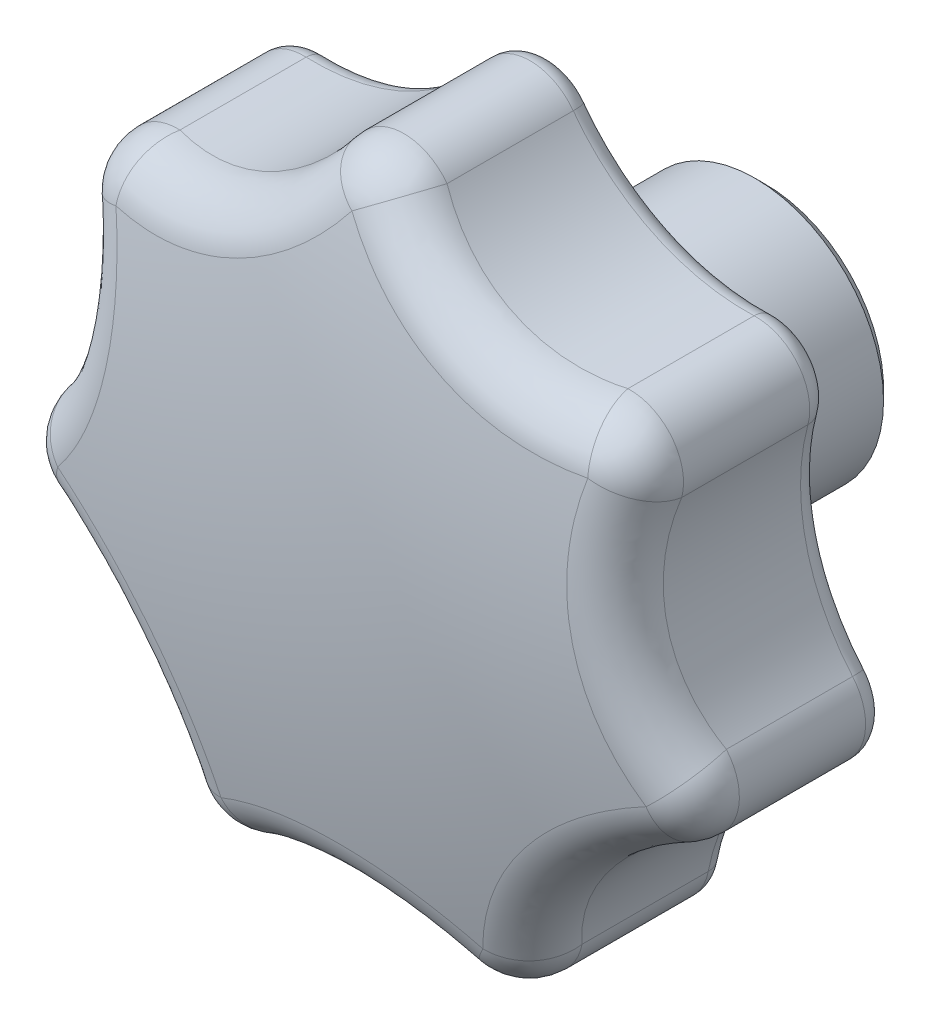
ISO-10303-21;
HEADER;
FILE_DESCRIPTION(('STEP AP214'),'2;1');
FILE_NAME('part.step','',(''),(''),'','','');
FILE_SCHEMA(('AUTOMOTIVE_DESIGN { 1 0 10303 214 1 1 1 1 }'));
ENDSEC;
DATA;
#1=APPLICATION_CONTEXT('core data for automotive mechanical design processes');
#2=APPLICATION_PROTOCOL_DEFINITION('international standard','automotive_design',2000,#1);
#3=PRODUCT_CONTEXT('',#1,'mechanical');
#4=PRODUCT('Part','Part','',(#3));
#5=PRODUCT_RELATED_PRODUCT_CATEGORY('part','',(#4));
#6=PRODUCT_DEFINITION_FORMATION('','',#4);
#7=PRODUCT_DEFINITION_CONTEXT('part definition',#1,'design');
#8=PRODUCT_DEFINITION('design','',#6,#7);
#9=PRODUCT_DEFINITION_SHAPE('','',#8);
#10=(LENGTH_UNIT() NAMED_UNIT(*) SI_UNIT(.MILLI.,.METRE.));
#11=(NAMED_UNIT(*) PLANE_ANGLE_UNIT() SI_UNIT($,.RADIAN.));
#12=(NAMED_UNIT(*) SI_UNIT($,.STERADIAN.) SOLID_ANGLE_UNIT());
#13=UNCERTAINTY_MEASURE_WITH_UNIT(LENGTH_MEASURE(1.E-05),#10,'distance_accuracy_value','');
#14=(GEOMETRIC_REPRESENTATION_CONTEXT(3) GLOBAL_UNCERTAINTY_ASSIGNED_CONTEXT((#13)) GLOBAL_UNIT_ASSIGNED_CONTEXT((#10,
#11,#12)) REPRESENTATION_CONTEXT('',''));
#15=CARTESIAN_POINT('',(0.,0.,0.));
#16=DIRECTION('',(0.,0.,1.));
#17=DIRECTION('',(1.,0.,0.));
#18=AXIS2_PLACEMENT_3D('',#15,#16,#17);
#19=CARTESIAN_POINT('',(12.000207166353,-13.3158132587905,10.));
#20=DIRECTION('',(0.,0.,1.));
#21=DIRECTION('',(1.,0.,0.));
#22=AXIS2_PLACEMENT_3D('',#19,#20,#21);
#23=PLANE('',#22);
#24=CARTESIAN_POINT('',(0.,0.,10.));
#25=DIRECTION('',(0.,0.,1.));
#26=DIRECTION('',(1.,0.,0.));
#27=AXIS2_PLACEMENT_3D('',#24,#25,#26);
#28=CIRCLE('',#27,7.);
#29=CARTESIAN_POINT('',(7.,0.,10.));
#30=VERTEX_POINT('',#29);
#31=EDGE_CURVE('E495',#30,#30,#28,.T.);
#32=ORIENTED_EDGE('',*,*,#31,.T.);
#33=EDGE_LOOP('',(#32));
#34=FACE_BOUND('',#33,.T.);
#35=CARTESIAN_POINT('',(13.1615268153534,-3.00403260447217,10.));
#36=DIRECTION('',(0.,0.,1.));
#37=DIRECTION('',(1.,0.,0.));
#38=AXIS2_PLACEMENT_3D('',#35,#36,#37);
#39=CIRCLE('',#38,1.5);
#40=CARTESIAN_POINT('',(14.2970152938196,-2.02389694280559,10.));
#41=VERTEX_POINT('',#40);
#42=CARTESIAN_POINT('',(13.7593016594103,-4.37977430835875,10.));
#43=VERTEX_POINT('',#42);
#44=EDGE_CURVE('E735',#41,#43,#39,.F.);
#45=ORIENTED_EDGE('',*,*,#44,.T.);
#46=CARTESIAN_POINT('',(18.1429838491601,-14.4685468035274,10.));
#47=DIRECTION('',(0.,0.,1.));
#48=DIRECTION('',(1.,0.,0.));
#49=AXIS2_PLACEMENT_3D('',#46,#47,#48);
#50=CIRCLE('',#49,11.);
#51=CARTESIAN_POINT('',(7.33169688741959,-12.4397357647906,10.));
#52=VERTEX_POINT('',#51);
#53=EDGE_CURVE('E737',#43,#52,#50,.T.);
#54=ORIENTED_EDGE('',*,*,#53,.T.);
#55=CARTESIAN_POINT('',(5.8574304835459,-12.1630797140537,10.));
#56=DIRECTION('',(0.,0.,1.));
#57=DIRECTION('',(1.,0.,0.));
#58=AXIS2_PLACEMENT_3D('',#55,#56,#57);
#59=CIRCLE('',#58,1.5);
#60=CARTESIAN_POINT('',(5.15453882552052,-13.4881998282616,10.));
#61=VERTEX_POINT('',#60);
#62=EDGE_CURVE('E705',#52,#61,#59,.F.);
#63=ORIENTED_EDGE('',*,*,#62,.T.);
#64=CARTESIAN_POINT('',(0.,-23.2057473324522,10.));
#65=DIRECTION('',(0.,0.,1.));
#66=DIRECTION('',(1.,0.,0.));
#67=AXIS2_PLACEMENT_3D('',#64,#65,#66);
#68=CIRCLE('',#67,11.);
#69=CARTESIAN_POINT('',(-5.15453882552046,-13.4881998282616,10.));
#70=VERTEX_POINT('',#69);
#71=EDGE_CURVE('E709',#61,#70,#68,.T.);
#72=ORIENTED_EDGE('',*,*,#71,.T.);
#73=CARTESIAN_POINT('',(-5.8574304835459,-12.1630797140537,10.));
#74=DIRECTION('',(0.,0.,1.));
#75=DIRECTION('',(1.,0.,0.));
#76=AXIS2_PLACEMENT_3D('',#73,#74,#75);
#77=CIRCLE('',#76,1.5);
#78=CARTESIAN_POINT('',(-7.3316968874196,-12.4397357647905,10.));
#79=VERTEX_POINT('',#78);
#80=EDGE_CURVE('E713',#70,#79,#77,.F.);
#81=ORIENTED_EDGE('',*,*,#80,.T.);
#82=CARTESIAN_POINT('',(-18.1429838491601,-14.4685468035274,10.));
#83=DIRECTION('',(0.,0.,1.));
#84=DIRECTION('',(1.,0.,0.));
#85=AXIS2_PLACEMENT_3D('',#82,#83,#84);
#86=CIRCLE('',#85,11.);
#87=CARTESIAN_POINT('',(-13.7593016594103,-4.37977430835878,10.));
#88=VERTEX_POINT('',#87);
#89=EDGE_CURVE('E717',#79,#88,#86,.T.);
#90=ORIENTED_EDGE('',*,*,#89,.T.);
#91=CARTESIAN_POINT('',(-13.1615268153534,-3.00403260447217,10.));
#92=DIRECTION('',(0.,0.,1.));
#93=DIRECTION('',(1.,0.,0.));
#94=AXIS2_PLACEMENT_3D('',#91,#92,#93);
#95=CIRCLE('',#94,1.5);
#96=CARTESIAN_POINT('',(-14.2970152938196,-2.02389694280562,10.));
#97=VERTEX_POINT('',#96);
#98=EDGE_CURVE('E719',#88,#97,#95,.F.);
#99=ORIENTED_EDGE('',*,*,#98,.T.);
#100=CARTESIAN_POINT('',(-22.6239308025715,5.16376457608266,10.));
#101=DIRECTION('',(0.,0.,1.));
#102=DIRECTION('',(1.,0.,0.));
#103=AXIS2_PLACEMENT_3D('',#100,#101,#102);
#104=CIRCLE('',#103,11.);
#105=CARTESIAN_POINT('',(-12.0030297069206,8.02671059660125,10.));
#106=VERTEX_POINT('',#105);
#107=EDGE_CURVE('E721',#97,#106,#104,.T.);
#108=ORIENTED_EDGE('',*,*,#107,.T.);
#109=CARTESIAN_POINT('',(-10.5547250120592,8.41711232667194,10.));
#110=DIRECTION('',(0.,0.,1.));
#111=DIRECTION('',(1.,0.,0.));
#112=AXIS2_PLACEMENT_3D('',#109,#110,#111);
#113=CIRCLE('',#112,1.5);
#114=CARTESIAN_POINT('',(-10.4963895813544,9.91597755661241,10.));
#115=VERTEX_POINT('',#114);
#116=EDGE_CURVE('E723',#106,#115,#113,.F.);
#117=ORIENTED_EDGE('',*,*,#116,.T.);
#118=CARTESIAN_POINT('',(-10.0685964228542,20.9076559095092,10.));
#119=DIRECTION('',(0.,0.,1.));
#120=DIRECTION('',(1.,0.,0.));
#121=AXIS2_PLACEMENT_3D('',#118,#119,#120);
#122=CIRCLE('',#121,11.);
#123=CARTESIAN_POINT('',(-1.2082315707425,14.3889187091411,10.));
#124=VERTEX_POINT('',#123);
#125=EDGE_CURVE('E725',#115,#124,#122,.T.);
#126=ORIENTED_EDGE('',*,*,#125,.T.);
#127=CARTESIAN_POINT('',(0.,13.5,10.));
#128=DIRECTION('',(0.,0.,1.));
#129=DIRECTION('',(1.,0.,0.));
#130=AXIS2_PLACEMENT_3D('',#127,#128,#129);
#131=CIRCLE('',#130,1.5);
#132=CARTESIAN_POINT('',(1.20823157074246,14.3889187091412,10.));
#133=VERTEX_POINT('',#132);
#134=EDGE_CURVE('E727',#124,#133,#131,.F.);
#135=ORIENTED_EDGE('',*,*,#134,.T.);
#136=CARTESIAN_POINT('',(10.0685964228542,20.9076559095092,10.));
#137=DIRECTION('',(0.,0.,1.));
#138=DIRECTION('',(1.,0.,0.));
#139=AXIS2_PLACEMENT_3D('',#136,#137,#138);
#140=CIRCLE('',#139,11.);
#141=CARTESIAN_POINT('',(10.4963895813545,9.91597755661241,10.));
#142=VERTEX_POINT('',#141);
#143=EDGE_CURVE('E729',#133,#142,#140,.T.);
#144=ORIENTED_EDGE('',*,*,#143,.T.);
#145=CARTESIAN_POINT('',(10.5547250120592,8.41711232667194,10.));
#146=DIRECTION('',(0.,0.,1.));
#147=DIRECTION('',(1.,0.,0.));
#148=AXIS2_PLACEMENT_3D('',#145,#146,#147);
#149=CIRCLE('',#148,1.5);
#150=CARTESIAN_POINT('',(12.0030297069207,8.02671059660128,10.));
#151=VERTEX_POINT('',#150);
#152=EDGE_CURVE('E731',#142,#151,#149,.F.);
#153=ORIENTED_EDGE('',*,*,#152,.T.);
#154=CARTESIAN_POINT('',(22.6239308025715,5.16376457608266,10.));
#155=DIRECTION('',(0.,0.,1.));
#156=DIRECTION('',(1.,0.,0.));
#157=AXIS2_PLACEMENT_3D('',#154,#155,#156);
#158=CIRCLE('',#157,11.);
#159=EDGE_CURVE('E733',#151,#41,#158,.T.);
#160=ORIENTED_EDGE('',*,*,#159,.T.);
#161=EDGE_LOOP('',(#45,#54,#63,#72,#81,#90,#99,#108,#117,#126,#135,#144,#153,#160));
#162=FACE_BOUND('',#161,.T.);
#163=ADVANCED_FACE('F14',(#34,#162),#23,.F.);
#164=CARTESIAN_POINT('',(5.8574304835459,-12.1630797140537,21.));
#165=DIRECTION('',(0.,0.,-1.));
#166=DIRECTION('',(-1.,0.,0.));
#167=AXIS2_PLACEMENT_3D('',#164,#165,#166);
#168=CYLINDRICAL_SURFACE('',#167,2.5);
#169=DIRECTION('',(0.,0.,-1.));
#170=VECTOR('',#169,1.);
#171=CARTESIAN_POINT('',(4.68594438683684,-14.3716132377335,21.));
#172=LINE('',#171,#170);
#173=CARTESIAN_POINT('',(4.68594438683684,-14.3716132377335,16.8927544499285));
#174=VERTEX_POINT('',#173);
#175=CARTESIAN_POINT('',(4.68594438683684,-14.3716132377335,11.));
#176=VERTEX_POINT('',#175);
#177=EDGE_CURVE('E519',#174,#176,#172,.T.);
#178=ORIENTED_EDGE('',*,*,#177,.T.);
#179=CARTESIAN_POINT('',(5.8574304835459,-12.1630797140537,11.));
#180=DIRECTION('',(0.,0.,1.));
#181=DIRECTION('',(1.,0.,0.));
#182=AXIS2_PLACEMENT_3D('',#179,#180,#181);
#183=CIRCLE('',#182,2.5);
#184=CARTESIAN_POINT('',(8.31454115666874,-12.6241731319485,11.));
#185=VERTEX_POINT('',#184);
#186=EDGE_CURVE('E761',#176,#185,#183,.T.);
#187=ORIENTED_EDGE('',*,*,#186,.T.);
#188=DIRECTION('',(0.,0.,-1.));
#189=VECTOR('',#188,1.);
#190=CARTESIAN_POINT('',(8.31454115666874,-12.6241731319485,21.));
#191=LINE('',#190,#189);
#192=CARTESIAN_POINT('',(8.31454115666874,-12.6241731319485,16.8927544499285));
#193=VERTEX_POINT('',#192);
#194=EDGE_CURVE('E555',#193,#185,#191,.T.);
#195=ORIENTED_EDGE('',*,*,#194,.F.);
#196=CARTESIAN_POINT('',(5.8574304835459,-12.1630797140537,16.8927544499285));
#197=DIRECTION('',(0.,0.,-1.));
#198=DIRECTION('',(-1.,0.,0.));
#199=AXIS2_PLACEMENT_3D('',#196,#197,#198);
#200=CIRCLE('',#199,2.5);
#201=EDGE_CURVE('E630',#193,#174,#200,.T.);
#202=ORIENTED_EDGE('',*,*,#201,.T.);
#203=EDGE_LOOP('',(#178,#187,#195,#202));
#204=FACE_BOUND('',#203,.T.);
#205=ADVANCED_FACE('F202',(#204),#168,.T.);
#206=CARTESIAN_POINT('',(18.1429838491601,-14.4685468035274,21.));
#207=DIRECTION('',(0.,0.,-1.));
#208=DIRECTION('',(-1.,0.,0.));
#209=AXIS2_PLACEMENT_3D('',#206,#207,#208);
#210=CYLINDRICAL_SURFACE('',#209,10.);
#211=ORIENTED_EDGE('',*,*,#194,.T.);
#212=CARTESIAN_POINT('',(18.1429838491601,-14.4685468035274,11.));
#213=DIRECTION('',(0.,0.,1.));
#214=DIRECTION('',(1.,0.,0.));
#215=AXIS2_PLACEMENT_3D('',#212,#213,#214);
#216=CIRCLE('',#215,10.);
#217=CARTESIAN_POINT('',(14.1578182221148,-5.29693544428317,11.));
#218=VERTEX_POINT('',#217);
#219=EDGE_CURVE('E416',#185,#218,#216,.F.);
#220=ORIENTED_EDGE('',*,*,#219,.T.);
#221=DIRECTION('',(0.,0.,-1.));
#222=VECTOR('',#221,1.);
#223=CARTESIAN_POINT('',(14.1578182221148,-5.29693544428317,21.));
#224=LINE('',#223,#222);
#225=CARTESIAN_POINT('',(14.1578182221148,-5.29693544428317,16.8927544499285));
#226=VERTEX_POINT('',#225);
#227=EDGE_CURVE('E552',#226,#218,#224,.T.);
#228=ORIENTED_EDGE('',*,*,#227,.F.);
#229=CARTESIAN_POINT('',(17.9786593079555,-2.08900804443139,18.204928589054));
#230=CARTESIAN_POINT('',(18.1114149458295,-4.44405281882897,18.0772040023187));
#231=CARTESIAN_POINT('',(17.4122355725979,-4.49528219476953,15.8213898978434));
#232=CARTESIAN_POINT('',(17.6189918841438,-2.11531936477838,18.3170160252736));
#233=CARTESIAN_POINT('',(17.8121510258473,-4.44654985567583,18.1711850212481));
#234=CARTESIAN_POINT('',(17.1364905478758,-4.5154542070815,15.9288070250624));
#235=CARTESIAN_POINT('',(17.2590563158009,-2.15672951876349,18.4248764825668));
#236=CARTESIAN_POINT('',(17.5105551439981,-4.46253977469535,18.2622815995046));
#237=CARTESIAN_POINT('',(16.8605399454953,-4.54720199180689,16.0321732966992));
#238=CARTESIAN_POINT('',(16.5411917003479,-2.26994564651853,18.6314044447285));
#239=CARTESIAN_POINT('',(16.9080256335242,-4.52201596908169,18.4369909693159));
#240=CARTESIAN_POINT('',(16.3101770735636,-4.63400102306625,16.2300959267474));
#241=CARTESIAN_POINT('',(16.1832634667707,-2.34176315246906,18.7300684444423));
#242=CARTESIAN_POINT('',(16.6068871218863,-4.56534044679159,18.5207113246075));
#243=CARTESIAN_POINT('',(16.0357654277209,-4.68906111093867,16.324648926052));
#244=CARTESIAN_POINT('',(15.4719983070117,-2.5160300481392,18.9174401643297));
#245=CARTESIAN_POINT('',(16.007767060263,-4.67979402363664,18.6798994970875));
#246=CARTESIAN_POINT('',(15.4904621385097,-4.8226657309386,16.5042134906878));
#247=CARTESIAN_POINT('',(15.1186645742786,-2.61849966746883,19.0061412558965));
#248=CARTESIAN_POINT('',(15.7095567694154,-4.75080804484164,18.7554695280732));
#249=CARTESIAN_POINT('',(15.2195729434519,-4.90122577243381,16.5892187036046));
#250=CARTESIAN_POINT('',(14.419709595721,-2.85387246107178,19.1727621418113));
#251=CARTESIAN_POINT('',(15.1192917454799,-4.92049770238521,18.8975497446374));
#252=CARTESIAN_POINT('',(14.6837074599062,-5.0816782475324,16.7488970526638));
#253=CARTESIAN_POINT('',(14.0740871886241,-2.9867710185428,19.2506835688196));
#254=CARTESIAN_POINT('',(14.8269873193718,-5.01907932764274,18.9641627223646));
#255=CARTESIAN_POINT('',(14.4187302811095,-5.18356714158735,16.8235717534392));
#256=CARTESIAN_POINT('',(13.4231106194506,-3.26962536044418,19.3887724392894));
#257=CARTESIAN_POINT('',(14.276300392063,-5.23372641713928,19.0823015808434));
#258=CARTESIAN_POINT('',(13.919648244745,-5.40042213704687,16.9559069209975));
#259=CARTESIAN_POINT('',(13.116872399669,-3.41708467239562,19.4498953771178));
#260=CARTESIAN_POINT('',(14.0170768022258,-5.34744441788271,19.1346883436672));
#261=CARTESIAN_POINT('',(13.6848656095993,-5.5134742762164,17.0144830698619));
#262=CARTESIAN_POINT('',(12.5155059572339,-3.73631048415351,19.562113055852));
#263=CARTESIAN_POINT('',(13.5082434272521,-5.59695367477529,19.2308980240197));
#264=CARTESIAN_POINT('',(13.2238180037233,-5.75821406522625,17.1220250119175));
#265=CARTESIAN_POINT('',(12.2203749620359,-3.90807086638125,19.6132103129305));
#266=CARTESIAN_POINT('',(13.2584299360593,-5.73274100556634,19.2747856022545));
#267=CARTESIAN_POINT('',(12.9975509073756,-5.8898970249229,17.1709932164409));
#268=CARTESIAN_POINT('',(11.6437356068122,-4.27481799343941,19.7049236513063));
#269=CARTESIAN_POINT('',(12.7707828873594,-6.02539504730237,19.3535650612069));
#270=CARTESIAN_POINT('',(12.555460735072,-6.17106982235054,17.2588851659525));
#271=CARTESIAN_POINT('',(11.3622103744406,-4.46977487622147,19.7455529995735));
#272=CARTESIAN_POINT('',(12.53273690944,-6.1822702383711,19.3885209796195));
#273=CARTESIAN_POINT('',(12.3396247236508,-6.3205367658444,17.2978216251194));
#274=CARTESIAN_POINT('',(10.814269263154,-4.88215752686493,19.816112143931));
#275=CARTESIAN_POINT('',(12.070107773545,-6.51631532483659,19.4492184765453));
#276=CARTESIAN_POINT('',(11.9195365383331,-6.63669679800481,17.3654408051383));
#277=CARTESIAN_POINT('',(10.5478680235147,-5.09960450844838,19.8460317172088));
#278=CARTESIAN_POINT('',(11.8453465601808,-6.69357460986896,19.4749931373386));
#279=CARTESIAN_POINT('',(11.7152955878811,-6.80340615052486,17.3941137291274));
#280=CARTESIAN_POINT('',(10.0323012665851,-5.55562142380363,19.8948821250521));
#281=CARTESIAN_POINT('',(11.4112914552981,-7.06710232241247,19.5170606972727));
#282=CARTESIAN_POINT('',(11.3200277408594,-7.15301911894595,17.4409287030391));
#283=CARTESIAN_POINT('',(9.78315084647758,-5.79420945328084,19.9138034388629));
#284=CARTESIAN_POINT('',(11.201833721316,-7.2634893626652,19.533375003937));
#285=CARTESIAN_POINT('',(11.1290124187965,-7.33593660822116,17.4590616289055));
#286=CARTESIAN_POINT('',(9.30415238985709,-6.29082023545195,19.9404578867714));
#287=CARTESIAN_POINT('',(10.800314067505,-7.67367048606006,19.5563437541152));
#288=CARTESIAN_POINT('',(10.7617802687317,-7.71667154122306,17.4846054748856));
#289=CARTESIAN_POINT('',(9.07431296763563,-6.54885156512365,19.9481860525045));
#290=CARTESIAN_POINT('',(10.6081020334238,-7.88760372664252,19.5630102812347));
#291=CARTESIAN_POINT('',(10.58557004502,-7.91449556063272,17.49201163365));
#292=CARTESIAN_POINT('',(8.63577168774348,-7.08242848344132,19.9523699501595));
#293=CARTESIAN_POINT('',(10.2427764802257,-8.33105242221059,19.5666165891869));
#294=CARTESIAN_POINT('',(10.249355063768,-8.32357119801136,17.4960212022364));
#295=CARTESIAN_POINT('',(8.42707217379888,-7.35797600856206,19.9488244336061));
#296=CARTESIAN_POINT('',(10.069531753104,-8.56072628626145,19.5635578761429));
#297=CARTESIAN_POINT('',(10.0893521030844,-8.53482430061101,17.4926234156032));
#298=CARTESIAN_POINT('',(8.03244366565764,-7.9243821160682,19.9304946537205));
#299=CARTESIAN_POINT('',(9.74363684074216,-9.03357241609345,19.5477604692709));
#300=CARTESIAN_POINT('',(9.78680358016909,-8.96906898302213,17.4750573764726));
#301=CARTESIAN_POINT('',(7.84650515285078,-8.21523422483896,19.9157151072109));
#302=CARTESIAN_POINT('',(9.59087354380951,-9.2769158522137,19.5350145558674));
#303=CARTESIAN_POINT('',(9.6442507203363,-9.19205559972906,17.4608936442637));
#304=CARTESIAN_POINT('',(7.4826201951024,-8.8374328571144,19.8731869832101));
#305=CARTESIAN_POINT('',(9.29398750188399,-9.79796538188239,19.4983781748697));
#306=CARTESIAN_POINT('',(9.36527225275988,-9.66907455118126,17.4201375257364));
#307=CARTESIAN_POINT('',(7.3069635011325,-9.17004900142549,19.8443750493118));
#308=CARTESIAN_POINT('',(9.15186501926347,-10.0769832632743,19.4735456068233));
#309=CARTESIAN_POINT('',(9.23060212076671,-9.92408026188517,17.3925260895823));
#310=CARTESIAN_POINT('',(6.98561644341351,-9.84772664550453,19.7738478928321));
#311=CARTESIAN_POINT('',(8.89471749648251,-10.6455777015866,19.4128553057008));
#312=CARTESIAN_POINT('',(8.98423604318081,-10.4436331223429,17.3249375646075));
#313=CARTESIAN_POINT('',(6.83989775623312,-10.1927760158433,19.7321449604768));
#314=CARTESIAN_POINT('',(8.77962055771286,-10.9354052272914,19.3769578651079));
#315=CARTESIAN_POINT('',(8.8725183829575,-10.7081709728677,17.2849722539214));
#316=CARTESIAN_POINT('',(6.57888084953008,-10.8931653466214,19.636161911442));
#317=CARTESIAN_POINT('',(8.57693071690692,-11.5234690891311,19.2944855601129));
#318=CARTESIAN_POINT('',(8.67240542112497,-11.2451361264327,17.192988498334));
#319=CARTESIAN_POINT('',(6.4636346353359,-11.2485217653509,19.5818605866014));
#320=CARTESIAN_POINT('',(8.48938865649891,-11.8219816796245,19.2478263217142));
#321=CARTESIAN_POINT('',(8.58404999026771,-11.5175760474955,17.1409497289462));
#322=CARTESIAN_POINT('',(6.26438460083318,-11.9659505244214,19.461233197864));
#323=CARTESIAN_POINT('',(8.34245262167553,-12.4240712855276,19.1443864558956));
#324=CARTESIAN_POINT('',(8.43129163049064,-12.067604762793,17.0253484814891));
#325=CARTESIAN_POINT('',(6.18038690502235,-12.3280241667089,19.3949047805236));
#326=CARTESIAN_POINT('',(8.28311654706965,-12.7279073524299,19.087523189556));
#327=CARTESIAN_POINT('',(8.36689339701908,-12.3451945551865,16.9617837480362));
#328=CARTESIAN_POINT('',(6.04362252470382,-13.0568245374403,19.2506397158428));
#329=CARTESIAN_POINT('',(8.19252631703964,-13.3385817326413,18.9641251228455));
#330=CARTESIAN_POINT('',(8.26204070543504,-12.9039415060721,16.8235297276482));
#331=CARTESIAN_POINT('',(5.99094492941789,-13.4235615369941,19.1726707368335));
#332=CARTESIAN_POINT('',(8.16145242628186,-13.6456673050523,18.8974714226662));
#333=CARTESIAN_POINT('',(8.22165454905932,-13.1851065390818,16.7488094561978));
#334=CARTESIAN_POINT('',(5.91700388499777,-14.1577588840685,19.005948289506));
#335=CARTESIAN_POINT('',(8.1273795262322,-14.2592180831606,18.75530488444));
#336=CARTESIAN_POINT('',(8.16496641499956,-13.7479911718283,16.5890337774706));
#337=CARTESIAN_POINT('',(5.8957424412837,-14.5252192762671,18.9171941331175));
#338=CARTESIAN_POINT('',(8.12452549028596,-14.5659064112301,18.6796898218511));
#339=CARTESIAN_POINT('',(8.14866597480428,-14.0297108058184,16.5039777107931));
#340=CARTESIAN_POINT('',(5.88418280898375,-15.2573960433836,18.72980836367));
#341=CARTESIAN_POINT('',(8.14631639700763,-15.1754408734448,18.5204909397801));
#342=CARTESIAN_POINT('',(8.13980359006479,-14.5910463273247,16.3243996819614));
#343=CARTESIAN_POINT('',(5.89383098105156,-15.6221160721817,18.6311941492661));
#344=CARTESIAN_POINT('',(8.17109480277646,-15.478489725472,18.4368131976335));
#345=CARTESIAN_POINT('',(8.14720052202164,-14.870665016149,16.2298943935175));
#346=CARTESIAN_POINT('',(5.94319706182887,-16.3467780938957,18.424768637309));
#347=CARTESIAN_POINT('',(8.24717122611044,-16.0788166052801,18.2621908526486));
#348=CARTESIAN_POINT('',(8.18504785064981,-15.4262392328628,16.0320699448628));
#349=CARTESIAN_POINT('',(5.98290594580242,-16.7067214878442,18.3169601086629));
#350=CARTESIAN_POINT('',(8.2986743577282,-16.3762574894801,18.1711383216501));
#351=CARTESIAN_POINT('',(8.21549132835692,-15.7021958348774,15.928753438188));
#352=CARTESIAN_POINT('',(6.0372603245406,-17.0630487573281,18.204928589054));
#353=CARTESIAN_POINT('',(8.36280011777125,-16.6684291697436,18.0772040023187));
#354=CARTESIAN_POINT('',(8.2571630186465,-15.975380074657,15.8213898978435));
#355=(BOUNDED_SURFACE() B_SPLINE_SURFACE(3,2,((#229,#230,#231),(#232,#233,#234),(#235,#236,
#237),(#238,#239,#240),(#241,#242,#243),(#244,#245,#246),(#247,#248,#249),(#250,#251,#252),
(#253,#254,#255),(#256,#257,#258),(#259,#260,#261),(#262,#263,#264),(#265,#266,#267),(#268,#269,
#270),(#271,#272,#273),(#274,#275,#276),(#277,#278,#279),(#280,#281,#282),(#283,#284,#285),
(#286,#287,#288),(#289,#290,#291),(#292,#293,#294),(#295,#296,#297),(#298,#299,#300),(#301,#302,
#303),(#304,#305,#306),(#307,#308,#309),(#310,#311,#312),(#313,#314,#315),(#316,#317,#318),
(#319,#320,#321),(#322,#323,#324),(#325,#326,#327),(#328,#329,#330),(#331,#332,#333),(#334,#335,
#336),(#337,#338,#339),(#340,#341,#342),(#343,#344,#345),(#346,#347,#348),(#349,#350,#351),
(#352,#353,#354)),.UNSPECIFIED.,.F.,.F.,.F.) B_SPLINE_SURFACE_WITH_KNOTS((4,2,2,2,2,2,2,2,2,2,2,
2,2,2,2,2,2,2,2,2,4),(3,3),(0.,1.08550018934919,2.17141243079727,3.25804293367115,
4.34450867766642,5.33627395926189,6.32779001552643,7.31804317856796,8.30923906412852,
9.30129171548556,10.2937845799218,11.2863873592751,12.2785736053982,13.361586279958,
14.4435695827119,15.5273876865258,16.611418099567,17.6985174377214,18.7856861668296,
19.8709692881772,20.9559267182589),(0.,1.),
.UNSPECIFIED.) GEOMETRIC_REPRESENTATION_ITEM() RATIONAL_B_SPLINE_SURFACE(((1.,0.726849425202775,
1.),(1.,0.729667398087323,1.),(1.,0.732371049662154,1.),(1.,0.737535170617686,1.),(1.,
0.739995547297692,1.),(1.,0.744657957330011,1.),(1.,0.746859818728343,1.),(1.,0.750988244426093,
1.),(1.,0.752914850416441,1.),(1.,0.756323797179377,1.),(1.,0.757830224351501,1.),(1.,
0.760592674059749,1.),(1.,0.761848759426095,1.),(1.,0.764101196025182,1.),(1.,0.765097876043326,
1.),(1.,0.76682760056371,1.),(1.,0.767560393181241,1.),(1.,0.76875633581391,1.),(1.,
0.76921925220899,1.),(1.,0.76987125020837,1.),(1.,0.770060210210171,1.),(1.,0.770162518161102,
1.),(1.,0.770075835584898,1.),(1.,0.769627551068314,1.),(1.,0.769266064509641,1.),(1.,
0.768225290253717,1.),(1.,0.767519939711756,1.),(1.,0.765791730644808,1.),(1.,0.764769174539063,
1.),(1.,0.762412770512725,1.),(1.,0.761078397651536,1.),(1.,0.75810963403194,1.),(1.,
0.756475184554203,1.),(1.,0.752913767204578,1.),(1.,0.750985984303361,1.),(1.,0.746855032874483,
1.),(1.,0.744651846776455,1.),(1.,0.739989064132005,1.),(1.,0.737529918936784,1.),(1.,
0.732368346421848,1.),(1.,0.729665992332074,1.),(1.,0.726849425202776,1.))) REPRESENTATION_ITEM('') SURFACE());
#356=CARTESIAN_POINT('',(17.4122355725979,-4.49528219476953,15.8213898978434));
#357=CARTESIAN_POINT('',(17.1364905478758,-4.5154542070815,15.9288070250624));
#358=CARTESIAN_POINT('',(16.8605399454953,-4.54720199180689,16.0321732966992));
#359=CARTESIAN_POINT('',(16.3101770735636,-4.63400102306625,16.2300959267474));
#360=CARTESIAN_POINT('',(16.0357654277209,-4.68906111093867,16.324648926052));
#361=CARTESIAN_POINT('',(15.4904621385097,-4.8226657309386,16.5042134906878));
#362=CARTESIAN_POINT('',(15.2195729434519,-4.90122577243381,16.5892187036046));
#363=CARTESIAN_POINT('',(14.6837074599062,-5.0816782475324,16.7488970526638));
#364=CARTESIAN_POINT('',(14.4187302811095,-5.18356714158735,16.8235717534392));
#365=CARTESIAN_POINT('',(13.919648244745,-5.40042213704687,16.9559069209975));
#366=CARTESIAN_POINT('',(13.6848656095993,-5.5134742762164,17.0144830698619));
#367=CARTESIAN_POINT('',(13.2238180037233,-5.75821406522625,17.1220250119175));
#368=CARTESIAN_POINT('',(12.9975509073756,-5.8898970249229,17.1709932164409));
#369=CARTESIAN_POINT('',(12.555460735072,-6.17106982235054,17.2588851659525));
#370=CARTESIAN_POINT('',(12.3396247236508,-6.3205367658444,17.2978216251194));
#371=CARTESIAN_POINT('',(11.9195365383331,-6.63669679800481,17.3654408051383));
#372=CARTESIAN_POINT('',(11.7152955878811,-6.80340615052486,17.3941137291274));
#373=CARTESIAN_POINT('',(11.3200277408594,-7.15301911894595,17.4409287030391));
#374=CARTESIAN_POINT('',(11.1290124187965,-7.33593660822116,17.4590616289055));
#375=CARTESIAN_POINT('',(10.7617802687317,-7.71667154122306,17.4846054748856));
#376=CARTESIAN_POINT('',(10.58557004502,-7.91449556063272,17.49201163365));
#377=CARTESIAN_POINT('',(10.249355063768,-8.32357119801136,17.4960212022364));
#378=CARTESIAN_POINT('',(10.0893521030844,-8.53482430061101,17.4926234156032));
#379=CARTESIAN_POINT('',(9.78680358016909,-8.96906898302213,17.4750573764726));
#380=CARTESIAN_POINT('',(9.64425072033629,-9.19205559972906,17.4608936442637));
#381=CARTESIAN_POINT('',(9.36527225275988,-9.66907455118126,17.4201375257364));
#382=CARTESIAN_POINT('',(9.23060212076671,-9.92408026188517,17.3925260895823));
#383=CARTESIAN_POINT('',(8.98423604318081,-10.4436331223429,17.3249375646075));
#384=CARTESIAN_POINT('',(8.8725183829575,-10.7081709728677,17.2849722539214));
#385=CARTESIAN_POINT('',(8.67240542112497,-11.2451361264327,17.192988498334));
#386=CARTESIAN_POINT('',(8.58404999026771,-11.5175760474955,17.1409497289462));
#387=CARTESIAN_POINT('',(8.43129163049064,-12.067604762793,17.0253484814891));
#388=CARTESIAN_POINT('',(8.36689339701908,-12.3451945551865,16.9617837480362));
#389=CARTESIAN_POINT('',(8.26204070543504,-12.9039415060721,16.8235297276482));
#390=CARTESIAN_POINT('',(8.22165454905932,-13.1851065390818,16.7488094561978));
#391=CARTESIAN_POINT('',(8.16496641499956,-13.7479911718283,16.5890337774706));
#392=CARTESIAN_POINT('',(8.14866597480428,-14.0297108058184,16.5039777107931));
#393=CARTESIAN_POINT('',(8.13980359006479,-14.5910463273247,16.3243996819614));
#394=CARTESIAN_POINT('',(8.14720052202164,-14.870665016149,16.2298943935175));
#395=CARTESIAN_POINT('',(8.18504785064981,-15.4262392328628,16.0320699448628));
#396=CARTESIAN_POINT('',(8.21549132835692,-15.7021958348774,15.928753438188));
#397=CARTESIAN_POINT('',(8.2571630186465,-15.975380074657,15.8213898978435));
#398=B_SPLINE_CURVE_WITH_KNOTS('',3,(#356,#357,#358,#359,#360,#361,#362,#363,#364,#365,#366,
#367,#368,#369,#370,#371,#372,#373,#374,#375,#376,#377,#378,#379,#380,#381,#382,#383,#384,#385,
#386,#387,#388,#389,#390,#391,#392,#393,#394,#395,#396,#397),.UNSPECIFIED.,.F.,.F.,(4,2,2,2,2,2,
2,2,2,2,2,2,2,2,2,2,2,2,2,2,4),(0.,1.08550018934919,2.17141243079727,3.25804293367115,
4.34450867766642,5.33627395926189,6.32779001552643,7.31804317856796,8.30923906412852,
9.30129171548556,10.2937845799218,11.2863873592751,12.2785736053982,13.361586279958,
14.4435695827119,15.5273876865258,16.611418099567,17.6985174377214,18.7856861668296,
19.8709692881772,20.9559267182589),.UNSPECIFIED.);
#399=EDGE_CURVE('E697',#226,#193,#398,.T.);
#400=ORIENTED_EDGE('',*,*,#399,.T.);
#401=EDGE_LOOP('',(#211,#220,#228,#400));
#402=FACE_BOUND('',#401,.T.);
#403=ADVANCED_FACE('F207',(#402),#210,.F.);
#404=CARTESIAN_POINT('',(13.1615268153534,-3.00403260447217,21.));
#405=DIRECTION('',(0.,0.,-1.));
#406=DIRECTION('',(-1.,0.,0.));
#407=AXIS2_PLACEMENT_3D('',#404,#405,#406);
#408=CYLINDRICAL_SURFACE('',#407,2.5);
#409=ORIENTED_EDGE('',*,*,#227,.T.);
#410=CARTESIAN_POINT('',(13.1615268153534,-3.00403260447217,11.));
#411=DIRECTION('',(0.,0.,1.));
#412=DIRECTION('',(1.,0.,0.));
#413=AXIS2_PLACEMENT_3D('',#410,#411,#412);
#414=CIRCLE('',#413,2.5);
#415=CARTESIAN_POINT('',(15.054007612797,-1.3704731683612,11.));
#416=VERTEX_POINT('',#415);
#417=EDGE_CURVE('E739',#218,#416,#414,.T.);
#418=ORIENTED_EDGE('',*,*,#417,.T.);
#419=DIRECTION('',(0.,0.,-1.));
#420=VECTOR('',#419,1.);
#421=CARTESIAN_POINT('',(15.054007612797,-1.3704731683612,21.));
#422=LINE('',#421,#420);
#423=CARTESIAN_POINT('',(15.054007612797,-1.3704731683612,16.8927544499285));
#424=VERTEX_POINT('',#423);
#425=EDGE_CURVE('E549',#424,#416,#422,.T.);
#426=ORIENTED_EDGE('',*,*,#425,.F.);
#427=CARTESIAN_POINT('',(13.1615268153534,-3.00403260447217,16.8927544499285));
#428=DIRECTION('',(0.,0.,-1.));
#429=DIRECTION('',(-1.,0.,0.));
#430=AXIS2_PLACEMENT_3D('',#427,#428,#429);
#431=CIRCLE('',#430,2.5);
#432=EDGE_CURVE('E642',#424,#226,#431,.T.);
#433=ORIENTED_EDGE('',*,*,#432,.T.);
#434=EDGE_LOOP('',(#409,#418,#426,#433));
#435=FACE_BOUND('',#434,.T.);
#436=ADVANCED_FACE('F928',(#435),#408,.T.);
#437=CARTESIAN_POINT('',(22.6239308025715,5.16376457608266,21.));
#438=DIRECTION('',(0.,0.,-1.));
#439=DIRECTION('',(-1.,0.,0.));
#440=AXIS2_PLACEMENT_3D('',#437,#438,#439);
#441=CYLINDRICAL_SURFACE('',#440,10.);
#442=ORIENTED_EDGE('',*,*,#425,.T.);
#443=CARTESIAN_POINT('',(22.6239308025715,5.16376457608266,11.));
#444=DIRECTION('',(0.,0.,1.));
#445=DIRECTION('',(1.,0.,0.));
#446=AXIS2_PLACEMENT_3D('',#443,#444,#445);
#447=CIRCLE('',#446,10.);
#448=CARTESIAN_POINT('',(12.9685661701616,7.76644277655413,11.));
#449=VERTEX_POINT('',#448);
#450=EDGE_CURVE('E741',#416,#449,#447,.F.);
#451=ORIENTED_EDGE('',*,*,#450,.T.);
#452=DIRECTION('',(0.,0.,-1.));
#453=VECTOR('',#452,1.);
#454=CARTESIAN_POINT('',(12.9685661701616,7.76644277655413,21.));
#455=LINE('',#454,#453);
#456=CARTESIAN_POINT('',(12.9685661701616,7.76644277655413,16.8927544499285));
#457=VERTEX_POINT('',#456);
#458=EDGE_CURVE('E546',#457,#449,#455,.T.);
#459=ORIENTED_EDGE('',*,*,#458,.F.);
#460=CARTESIAN_POINT('',(12.8427629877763,12.7538066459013,18.204928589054));
#461=CARTESIAN_POINT('',(14.7667829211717,11.3892527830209,18.0772040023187));
#462=CARTESIAN_POINT('',(14.3709044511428,10.8106713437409,15.8213898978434));
#463=CARTESIAN_POINT('',(12.6390850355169,12.4562024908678,18.3170160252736));
#464=CARTESIAN_POINT('',(14.5821471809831,11.1537219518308,18.1711850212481));
#465=CARTESIAN_POINT('',(14.2147513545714,10.5825081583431,15.9288070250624));
#466=CARTESIAN_POINT('',(12.4470446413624,12.1489747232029,18.4248764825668));
#467=CARTESIAN_POINT('',(14.4066066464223,10.9079552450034,18.2622815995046));
#468=CARTESIAN_POINT('',(14.067520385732,10.3469668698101,16.0321732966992));
#469=CARTESIAN_POINT('',(12.0879793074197,11.5171364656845,18.6314044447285));
#470=CARTESIAN_POINT('',(14.0774360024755,10.3997959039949,18.4369909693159));
#471=CARTESIAN_POINT('',(13.7922369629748,9.86255753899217,16.2300959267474));
#472=CARTESIAN_POINT('',(11.9209638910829,11.1925194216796,18.7300684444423));
#473=CARTESIAN_POINT('',(13.9235516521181,10.1373439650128,18.5207113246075));
#474=CARTESIAN_POINT('',(13.6641918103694,9.61368447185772,16.324648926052));
#475=CARTESIAN_POINT('',(11.6137446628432,10.5277762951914,18.9174401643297));
#476=CARTESIAN_POINT('',(13.6394898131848,9.59757240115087,18.6798994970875));
#477=CARTESIAN_POINT('',(13.4286570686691,9.10404807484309,16.5042134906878));
#478=CARTESIAN_POINT('',(11.473558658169,10.1876400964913,19.0061412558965));
#479=CARTESIAN_POINT('',(13.5090797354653,9.32014568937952,18.7554695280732));
#480=CARTESIAN_POINT('',(13.3211811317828,8.84327698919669,16.5892187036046));
#481=CARTESIAN_POINT('',(11.2217892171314,9.4944225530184,19.1727621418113));
#482=CARTESIAN_POINT('',(13.2737242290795,8.75285813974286,18.8975497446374));
#483=CARTESIAN_POINT('',(13.1281578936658,8.31181020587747,16.7488970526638));
#484=CARTESIAN_POINT('',(11.1102014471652,9.14134317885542,19.2506835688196));
#485=CARTESIAN_POINT('',(13.1685496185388,8.46286069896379,18.9641627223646));
#486=CARTESIAN_POINT('',(13.0426072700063,8.04111601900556,16.8235717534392));
#487=CARTESIAN_POINT('',(10.9254686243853,8.4560324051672,19.3887724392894));
#488=CARTESIAN_POINT('',(12.9930197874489,7.89848605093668,19.0823015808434));
#489=CARTESIAN_POINT('',(12.9009787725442,7.51571109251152,16.9559069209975));
#490=CARTESIAN_POINT('',(10.8498205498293,8.12466634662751,19.4498953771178));
#491=CARTESIAN_POINT('',(12.9203048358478,7.6249148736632,19.1346883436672));
#492=CARTESIAN_POINT('',(12.8429819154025,7.26166378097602,17.0144830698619));
#493=CARTESIAN_POINT('',(10.7244554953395,7.45546509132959,19.562113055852));
#494=CARTESIAN_POINT('',(12.7981266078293,7.07152644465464,19.2308980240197));
#495=CARTESIAN_POINT('',(12.7468687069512,6.74860948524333,17.1220250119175));
#496=CARTESIAN_POINT('',(10.674732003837,7.11763154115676,19.6132103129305));
#497=CARTESIAN_POINT('',(12.7485332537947,6.79155237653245,19.2747856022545));
#498=CARTESIAN_POINT('',(12.7087473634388,6.4896037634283,17.1709932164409));
#499=CARTESIAN_POINT('',(10.6019376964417,6.43813364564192,19.7049236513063));
#500=CARTESIAN_POINT('',(12.6732964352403,6.22782775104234,19.3535650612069));
#501=CARTESIAN_POINT('',(12.6529383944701,5.96865537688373,17.2588851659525));
#502=CARTESIAN_POINT('',(10.5788330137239,6.09647472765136,19.7455529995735));
#503=CARTESIAN_POINT('',(12.6475271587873,5.94390582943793,19.3885209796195));
#504=CARTESIAN_POINT('',(12.6352248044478,5.70671687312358,17.2978216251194));
#505=CARTESIAN_POINT('',(10.5596110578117,5.41096073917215,19.816112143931));
#506=CARTESIAN_POINT('',(12.6202495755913,5.37393410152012,19.4492184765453));
#507=CARTESIAN_POINT('',(12.6204879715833,5.18115614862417,17.3654408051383));
#508=CARTESIAN_POINT('',(10.5635194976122,5.06710388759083,19.8460317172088));
#509=CARTESIAN_POINT('',(12.6187001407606,5.08768935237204,19.4749931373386));
#510=CARTESIAN_POINT('',(12.6234844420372,4.91753256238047,17.3941137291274));
#511=CARTESIAN_POINT('',(10.598597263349,4.37969566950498,19.8948821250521));
#512=CARTESIAN_POINT('',(12.6401069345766,4.51544068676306,19.5170606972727));
#513=CARTESIAN_POINT('',(12.6503773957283,4.39051959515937,17.4409287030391));
#514=CARTESIAN_POINT('',(10.6297901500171,4.03614482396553,19.9138034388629));
#515=CARTESIAN_POINT('',(12.6630537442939,4.22923471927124,19.533375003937));
#516=CARTESIAN_POINT('',(12.6742919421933,4.12713061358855,17.4590616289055));
#517=CARTESIAN_POINT('',(10.7194054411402,3.35201699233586,19.9404578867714));
#518=CARTESIAN_POINT('',(12.7334028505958,3.65957026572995,19.5563437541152));
#519=CARTESIAN_POINT('',(12.7429969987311,3.60263260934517,17.4846054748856));
#520=CARTESIAN_POINT('',(10.7778399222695,3.01144139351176,19.9481860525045));
#521=CARTESIAN_POINT('',(12.780820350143,3.37590765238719,19.5630102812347));
#522=CARTESIAN_POINT('',(12.7877967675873,3.3415246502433,17.49201163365));
#523=CARTESIAN_POINT('',(10.9215811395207,2.33589624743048,19.9523699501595));
#524=CARTESIAN_POINT('',(12.899745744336,2.81379889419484,19.5666165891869));
#525=CARTESIAN_POINT('',(12.8979983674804,2.82360670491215,17.4960212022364));
#526=CARTESIAN_POINT('',(11.0068908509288,2.00092732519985,19.9488244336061));
#527=CARTESIAN_POINT('',(12.9712956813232,2.5351514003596,19.5635578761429));
#528=CARTESIAN_POINT('',(12.96340247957,2.56679719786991,17.4926234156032));
#529=CARTESIAN_POINT('',(11.2036781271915,1.33924590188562,19.9304946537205));
#530=CARTESIAN_POINT('',(13.1377895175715,1.98554175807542,19.5477604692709));
#531=CARTESIAN_POINT('',(13.1142727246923,2.05950810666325,17.4750573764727));
#532=CARTESIAN_POINT('',(11.315144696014,1.0125299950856,19.9157151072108));
#533=CARTESIAN_POINT('',(13.2327967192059,1.71438445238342,19.5350145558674));
#534=CARTESIAN_POINT('',(13.1997304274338,1.80902591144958,17.4608936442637));
#535=CARTESIAN_POINT('',(11.5747206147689,0.34009877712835,19.8731869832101));
#536=CARTESIAN_POINT('',(13.455064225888,1.15740053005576,19.4983781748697));
#537=CARTESIAN_POINT('',(13.3987386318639,1.29349531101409,17.4201375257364));
#538=CARTESIAN_POINT('',(11.7252502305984,-0.00461793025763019,19.8443750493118));
#539=CARTESIAN_POINT('',(13.5845972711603,0.872319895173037,19.4735456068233));
#540=CARTESIAN_POINT('',(13.5141446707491,1.02921250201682,17.3925260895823));
#541=CARTESIAN_POINT('',(12.0547233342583,-0.678382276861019,19.773847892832));
#542=CARTESIAN_POINT('',(13.8688134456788,0.316761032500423,19.4128553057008));
#543=CARTESIAN_POINT('',(13.7667407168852,0.512659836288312,17.3249375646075));
#544=CARTESIAN_POINT('',(12.2336396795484,-1.0074444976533,19.7321449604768));
#545=CARTESIAN_POINT('',(14.023647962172,0.0460701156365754,19.3769578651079));
#546=CARTESIAN_POINT('',(13.9039099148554,0.260378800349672,17.2849722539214));
#547=CARTESIAN_POINT('',(12.6184847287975,-1.64820133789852,19.636161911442));
#548=CARTESIAN_POINT('',(14.3570397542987,-0.479051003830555,19.2944855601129));
#549=CARTESIAN_POINT('',(14.198957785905,-0.230868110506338,17.192988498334));
#550=CARTESIAN_POINT('',(12.8244587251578,-1.9598655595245,19.5818605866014));
#551=CARTESIAN_POINT('',(14.5358447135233,-0.733613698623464,19.2478263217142));
#552=CARTESIAN_POINT('',(14.3568711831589,-0.469810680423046,17.1409497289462));
#553=CARTESIAN_POINT('',(13.2611367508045,-2.56295502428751,19.461233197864));
#554=CARTESIAN_POINT('',(14.9149642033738,-1.22388964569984,19.1443864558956));
#555=CARTESIAN_POINT('',(14.691657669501,-0.932179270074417,17.0253484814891));
#556=CARTESIAN_POINT('',(13.4918456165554,-2.85437629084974,19.3949047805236));
#557=CARTESIAN_POINT('',(15.1155173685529,-1.45971914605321,19.087523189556));
#558=CARTESIAN_POINT('',(14.8685344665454,-1.15560224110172,16.9617837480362));
#559=CARTESIAN_POINT('',(13.9763734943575,-3.41570258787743,19.2506397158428));
#560=CARTESIAN_POINT('',(15.5364797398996,-1.91129468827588,18.9641251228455));
#561=CARTESIAN_POINT('',(15.2400058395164,-1.58595240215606,16.8235297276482));
#562=CARTESIAN_POINT('',(14.2302560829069,-3.68554436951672,19.1726707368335));
#563=CARTESIAN_POINT('',(15.7571946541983,-2.1270539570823,18.8974714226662));
#564=CARTESIAN_POINT('',(15.434649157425,-1.79283110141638,16.7488094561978));
#565=CARTESIAN_POINT('',(14.7581731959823,-4.20111836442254,19.005948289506));
#566=CARTESIAN_POINT('',(16.2156438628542,-2.53623587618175,18.75530488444));
#567=CARTESIAN_POINT('',(15.8393856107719,-2.18810449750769,16.5890337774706));
#568=CARTESIAN_POINT('',(15.0322090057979,-4.44684903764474,18.9171941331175));
#569=CARTESIAN_POINT('',(16.4536429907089,-2.72968429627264,18.6796898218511));
#570=CARTESIAN_POINT('',(16.0494797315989,-2.37649801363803,16.5039777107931));
#571=CARTESIAN_POINT('',(15.5974405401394,-4.91239146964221,18.72980836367));
#572=CARTESIAN_POINT('',(16.9437826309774,-3.09268600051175,18.5204909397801));
#573=CARTESIAN_POINT('',(16.4828239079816,-2.73341387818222,16.3243996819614));
#574=CARTESIAN_POINT('',(15.8886056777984,-5.13224744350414,18.6311941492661));
#575=CARTESIAN_POINT('',(17.1961648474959,-3.262261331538,18.4368131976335));
#576=CARTESIAN_POINT('',(16.7060505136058,-2.90197012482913,16.2298943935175));
#577=CARTESIAN_POINT('',(16.4859485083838,-5.54547086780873,18.424768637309));
#578=CARTESIAN_POINT('',(17.7129521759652,-3.57708007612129,18.2621908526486));
#579=CARTESIAN_POINT('',(17.16401335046,-3.21877475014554,16.0320699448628));
#580=CARTESIAN_POINT('',(16.7921216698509,-5.73884624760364,18.3169601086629));
#581=CARTESIAN_POINT('',(17.9776125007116,-3.72226466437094,18.1711383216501));
#582=CARTESIAN_POINT('',(17.3987461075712,-3.36702920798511,15.928753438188));
#583=CARTESIAN_POINT('',(17.1045989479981,-5.91851670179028,18.204928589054));
#584=CARTESIAN_POINT('',(18.2460232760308,-3.85429518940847,18.0772040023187));
#585=CARTESIAN_POINT('',(17.6383120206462,-3.50477655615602,15.8213898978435));
#586=(BOUNDED_SURFACE() B_SPLINE_SURFACE(3,2,((#460,#461,#462),(#463,#464,#465),(#466,#467,
#468),(#469,#470,#471),(#472,#473,#474),(#475,#476,#477),(#478,#479,#480),(#481,#482,#483),
(#484,#485,#486),(#487,#488,#489),(#490,#491,#492),(#493,#494,#495),(#496,#497,#498),(#499,#500,
#501),(#502,#503,#504),(#505,#506,#507),(#508,#509,#510),(#511,#512,#513),(#514,#515,#516),
(#517,#518,#519),(#520,#521,#522),(#523,#524,#525),(#526,#527,#528),(#529,#530,#531),(#532,#533,
#534),(#535,#536,#537),(#538,#539,#540),(#541,#542,#543),(#544,#545,#546),(#547,#548,#549),
(#550,#551,#552),(#553,#554,#555),(#556,#557,#558),(#559,#560,#561),(#562,#563,#564),(#565,#566,
#567),(#568,#569,#570),(#571,#572,#573),(#574,#575,#576),(#577,#578,#579),(#580,#581,#582),
(#583,#584,#585)),.UNSPECIFIED.,.F.,.F.,.F.) B_SPLINE_SURFACE_WITH_KNOTS((4,2,2,2,2,2,2,2,2,2,2,
2,2,2,2,2,2,2,2,2,4),(3,3),(0.,1.08550018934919,2.17141243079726,3.25804293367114,
4.34450867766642,5.3362739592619,6.32779001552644,7.31804317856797,8.30923906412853,
9.30129171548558,10.2937845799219,11.2863873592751,12.2785736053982,13.361586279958,
14.4435695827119,15.5273876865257,16.6114180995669,17.6985174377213,18.7856861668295,
19.8709692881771,20.9559267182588),(0.,1.),
.UNSPECIFIED.) GEOMETRIC_REPRESENTATION_ITEM() RATIONAL_B_SPLINE_SURFACE(((1.,0.726849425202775,
1.),(1.,0.729667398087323,1.),(1.,0.732371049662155,1.),(1.,0.737535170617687,1.),(1.,
0.739995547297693,1.),(1.,0.744657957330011,1.),(1.,0.746859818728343,1.),(1.,0.750988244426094,
1.),(1.,0.752914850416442,1.),(1.,0.756323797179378,1.),(1.,0.757830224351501,1.),(1.,
0.76059267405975,1.),(1.,0.761848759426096,1.),(1.,0.764101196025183,1.),(1.,0.765097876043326,
1.),(1.,0.766827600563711,1.),(1.,0.767560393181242,1.),(1.,0.768756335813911,1.),(1.,
0.76921925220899,1.),(1.,0.76987125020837,1.),(1.,0.770060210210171,1.),(1.,0.770162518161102,
1.),(1.,0.770075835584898,1.),(1.,0.769627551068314,1.),(1.,0.769266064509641,1.),(1.,
0.768225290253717,1.),(1.,0.767519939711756,1.),(1.,0.765791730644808,1.),(1.,0.764769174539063,
1.),(1.,0.762412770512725,1.),(1.,0.761078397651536,1.),(1.,0.75810963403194,1.),(1.,
0.756475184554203,1.),(1.,0.752913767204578,1.),(1.,0.750985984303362,1.),(1.,0.746855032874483,
1.),(1.,0.744651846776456,1.),(1.,0.739989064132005,1.),(1.,0.737529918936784,1.),(1.,
0.732368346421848,1.),(1.,0.729665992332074,1.),(1.,0.726849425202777,1.))) REPRESENTATION_ITEM('') SURFACE());
#587=CARTESIAN_POINT('',(14.3709044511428,10.8106713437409,15.8213898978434));
#588=CARTESIAN_POINT('',(14.2147513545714,10.5825081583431,15.9288070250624));
#589=CARTESIAN_POINT('',(14.067520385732,10.3469668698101,16.0321732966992));
#590=CARTESIAN_POINT('',(13.7922369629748,9.86255753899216,16.2300959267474));
#591=CARTESIAN_POINT('',(13.6641918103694,9.61368447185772,16.324648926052));
#592=CARTESIAN_POINT('',(13.4286570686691,9.10404807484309,16.5042134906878));
#593=CARTESIAN_POINT('',(13.3211811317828,8.84327698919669,16.5892187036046));
#594=CARTESIAN_POINT('',(13.1281578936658,8.31181020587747,16.7488970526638));
#595=CARTESIAN_POINT('',(13.0426072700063,8.04111601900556,16.8235717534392));
#596=CARTESIAN_POINT('',(12.9009787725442,7.51571109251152,16.9559069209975));
#597=CARTESIAN_POINT('',(12.8429819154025,7.26166378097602,17.0144830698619));
#598=CARTESIAN_POINT('',(12.7468687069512,6.74860948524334,17.1220250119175));
#599=CARTESIAN_POINT('',(12.7087473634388,6.4896037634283,17.1709932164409));
#600=CARTESIAN_POINT('',(12.6529383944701,5.96865537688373,17.2588851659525));
#601=CARTESIAN_POINT('',(12.6352248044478,5.70671687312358,17.2978216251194));
#602=CARTESIAN_POINT('',(12.6204879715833,5.18115614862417,17.3654408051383));
#603=CARTESIAN_POINT('',(12.6234844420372,4.91753256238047,17.3941137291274));
#604=CARTESIAN_POINT('',(12.6503773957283,4.39051959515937,17.4409287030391));
#605=CARTESIAN_POINT('',(12.6742919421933,4.12713061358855,17.4590616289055));
#606=CARTESIAN_POINT('',(12.7429969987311,3.60263260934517,17.4846054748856));
#607=CARTESIAN_POINT('',(12.7877967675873,3.3415246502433,17.49201163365));
#608=CARTESIAN_POINT('',(12.8979983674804,2.82360670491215,17.4960212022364));
#609=CARTESIAN_POINT('',(12.96340247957,2.56679719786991,17.4926234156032));
#610=CARTESIAN_POINT('',(13.1142727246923,2.05950810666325,17.4750573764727));
#611=CARTESIAN_POINT('',(13.1997304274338,1.80902591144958,17.4608936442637));
#612=CARTESIAN_POINT('',(13.3987386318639,1.29349531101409,17.4201375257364));
#613=CARTESIAN_POINT('',(13.5141446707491,1.02921250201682,17.3925260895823));
#614=CARTESIAN_POINT('',(13.7667407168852,0.512659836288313,17.3249375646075));
#615=CARTESIAN_POINT('',(13.9039099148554,0.260378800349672,17.2849722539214));
#616=CARTESIAN_POINT('',(14.198957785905,-0.230868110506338,17.192988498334));
#617=CARTESIAN_POINT('',(14.3568711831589,-0.469810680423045,17.1409497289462));
#618=CARTESIAN_POINT('',(14.691657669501,-0.932179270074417,17.0253484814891));
#619=CARTESIAN_POINT('',(14.8685344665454,-1.15560224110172,16.9617837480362));
#620=CARTESIAN_POINT('',(15.2400058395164,-1.58595240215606,16.8235297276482));
#621=CARTESIAN_POINT('',(15.434649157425,-1.79283110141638,16.7488094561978));
#622=CARTESIAN_POINT('',(15.8393856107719,-2.18810449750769,16.5890337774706));
#623=CARTESIAN_POINT('',(16.0494797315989,-2.37649801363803,16.5039777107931));
#624=CARTESIAN_POINT('',(16.4828239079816,-2.73341387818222,16.3243996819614));
#625=CARTESIAN_POINT('',(16.7060505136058,-2.90197012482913,16.2298943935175));
#626=CARTESIAN_POINT('',(17.16401335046,-3.21877475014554,16.0320699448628));
#627=CARTESIAN_POINT('',(17.3987461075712,-3.3670292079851,15.928753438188));
#628=CARTESIAN_POINT('',(17.6383120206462,-3.50477655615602,15.8213898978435));
#629=B_SPLINE_CURVE_WITH_KNOTS('',3,(#587,#588,#589,#590,#591,#592,#593,#594,#595,#596,#597,
#598,#599,#600,#601,#602,#603,#604,#605,#606,#607,#608,#609,#610,#611,#612,#613,#614,#615,#616,
#617,#618,#619,#620,#621,#622,#623,#624,#625,#626,#627,#628),.UNSPECIFIED.,.F.,.F.,(4,2,2,2,2,2,
2,2,2,2,2,2,2,2,2,2,2,2,2,2,4),(0.,1.08550018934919,2.17141243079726,3.25804293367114,
4.34450867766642,5.3362739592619,6.32779001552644,7.31804317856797,8.30923906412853,
9.30129171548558,10.2937845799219,11.2863873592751,12.2785736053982,13.361586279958,
14.4435695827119,15.5273876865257,16.6114180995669,17.6985174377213,18.7856861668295,
19.8709692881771,20.9559267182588),.UNSPECIFIED.);
#630=EDGE_CURVE('E689',#457,#424,#629,.T.);
#631=ORIENTED_EDGE('',*,*,#630,.T.);
#632=EDGE_LOOP('',(#442,#451,#459,#631));
#633=FACE_BOUND('',#632,.T.);
#634=ADVANCED_FACE('F328',(#633),#441,.F.);
#635=CARTESIAN_POINT('',(10.5547250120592,8.41711232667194,21.));
#636=DIRECTION('',(0.,0.,-1.));
#637=DIRECTION('',(-1.,0.,0.));
#638=AXIS2_PLACEMENT_3D('',#635,#636,#637);
#639=CYLINDRICAL_SURFACE('',#638,2.5);
#640=ORIENTED_EDGE('',*,*,#458,.T.);
#641=CARTESIAN_POINT('',(10.5547250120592,8.41711232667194,11.));
#642=DIRECTION('',(0.,0.,1.));
#643=DIRECTION('',(1.,0.,0.));
#644=AXIS2_PLACEMENT_3D('',#641,#642,#643);
#645=CIRCLE('',#644,2.5);
#646=CARTESIAN_POINT('',(10.4574992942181,10.9152210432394,11.));
#647=VERTEX_POINT('',#646);
#648=EDGE_CURVE('E743',#449,#647,#645,.T.);
#649=ORIENTED_EDGE('',*,*,#648,.T.);
#650=DIRECTION('',(0.,0.,-1.));
#651=VECTOR('',#650,1.);
#652=CARTESIAN_POINT('',(10.4574992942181,10.9152210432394,21.));
#653=LINE('',#652,#651);
#654=CARTESIAN_POINT('',(10.4574992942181,10.9152210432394,16.8927544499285));
#655=VERTEX_POINT('',#654);
#656=EDGE_CURVE('E543',#655,#647,#653,.T.);
#657=ORIENTED_EDGE('',*,*,#656,.F.);
#658=CARTESIAN_POINT('',(10.5547250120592,8.41711232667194,16.8927544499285));
#659=DIRECTION('',(0.,0.,-1.));
#660=DIRECTION('',(-1.,0.,0.));
#661=AXIS2_PLACEMENT_3D('',#658,#659,#660);
#662=CIRCLE('',#661,2.5);
#663=EDGE_CURVE('E687',#655,#457,#662,.T.);
#664=ORIENTED_EDGE('',*,*,#663,.T.);
#665=EDGE_LOOP('',(#640,#649,#657,#664));
#666=FACE_BOUND('',#665,.T.);
#667=ADVANCED_FACE('F913',(#666),#639,.T.);
#668=CARTESIAN_POINT('',(10.0685964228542,20.9076559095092,21.));
#669=DIRECTION('',(0.,0.,-1.));
#670=DIRECTION('',(-1.,0.,0.));
#671=AXIS2_PLACEMENT_3D('',#668,#669,#670);
#672=CYLINDRICAL_SURFACE('',#671,10.);
#673=ORIENTED_EDGE('',*,*,#656,.T.);
#674=CARTESIAN_POINT('',(10.0685964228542,20.9076559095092,11.));
#675=DIRECTION('',(0.,0.,1.));
#676=DIRECTION('',(1.,0.,0.));
#677=AXIS2_PLACEMENT_3D('',#674,#675,#676);
#678=CIRCLE('',#677,10.);
#679=CARTESIAN_POINT('',(2.01371928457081,14.9815311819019,11.));
#680=VERTEX_POINT('',#679);
#681=EDGE_CURVE('E745',#647,#680,#678,.F.);
#682=ORIENTED_EDGE('',*,*,#681,.T.);
#683=DIRECTION('',(0.,0.,-1.));
#684=VECTOR('',#683,1.);
#685=CARTESIAN_POINT('',(2.01371928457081,14.9815311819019,21.));
#686=LINE('',#685,#684);
#687=CARTESIAN_POINT('',(2.01371928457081,14.9815311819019,16.8927544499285));
#688=VERTEX_POINT('',#687);
#689=EDGE_CURVE('E540',#688,#680,#686,.T.);
#690=ORIENTED_EDGE('',*,*,#689,.F.);
#691=CARTESIAN_POINT('',(-1.96399580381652,17.9927448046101,18.204928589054));
#692=CARTESIAN_POINT('',(0.302462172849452,18.6462187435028,18.0772040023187));
#693=CARTESIAN_POINT('',(0.507989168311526,17.9759688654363,15.8213898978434));
#694=CARTESIAN_POINT('',(-1.85831063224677,17.6479498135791,18.3170160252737));
#695=CARTESIAN_POINT('',(0.371489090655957,18.3550136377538,18.171185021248));
#696=CARTESIAN_POINT('',(0.58901446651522,17.7116260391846,15.9288070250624));
#697=CARTESIAN_POINT('',(-1.73784551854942,17.3062532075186,18.4248764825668));
#698=CARTESIAN_POINT('',(0.454189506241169,18.0645374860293,18.2622815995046));
#699=CARTESIAN_POINT('',(0.681371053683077,17.449658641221,16.0321732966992));
#700=CARTESIAN_POINT('',(-1.46772805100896,16.631579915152,18.6314044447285));
#701=CARTESIAN_POINT('',(0.646249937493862,17.4903493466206,18.4369909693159));
#702=CARTESIAN_POINT('',(0.888461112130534,16.9324091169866,16.2300959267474));
#703=CARTESIAN_POINT('',(-1.31806463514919,16.2986065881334,18.7300684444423));
#704=CARTESIAN_POINT('',(0.755497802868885,17.2064016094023,18.5207113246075));
#705=CARTESIAN_POINT('',(1.00320306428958,16.6771295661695,16.324648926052));
#706=CARTESIAN_POINT('',(-0.989895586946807,15.6439523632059,18.9174401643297));
#707=CARTESIAN_POINT('',(1.00039854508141,16.6477710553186,18.6798994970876));
#708=CARTESIAN_POINT('',(1.25479933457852,16.1752279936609,16.5042134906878));
#709=CARTESIAN_POINT('',(-0.811370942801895,15.322279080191,19.0061412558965));
#710=CARTESIAN_POINT('',(1.13599012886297,16.3728396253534,18.7554695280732));
#711=CARTESIAN_POINT('',(1.39166822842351,15.9286118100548,16.5892187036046));
#712=CARTESIAN_POINT('',(-0.426367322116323,14.6932237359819,19.1727621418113));
#713=CARTESIAN_POINT('',(1.43277163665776,15.8351332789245,18.8975497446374));
#714=CARTESIAN_POINT('',(1.68683767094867,15.4463360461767,16.7488970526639));
#715=CARTESIAN_POINT('',(-0.219892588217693,14.3858395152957,19.2506835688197));
#716=CARTESIAN_POINT('',(1.59392546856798,15.5720940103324,18.9641627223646));
#717=CARTESIAN_POINT('',(1.84513496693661,15.2106748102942,16.8235717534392));
#718=CARTESIAN_POINT('',(0.200725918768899,13.8141253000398,19.3887724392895));
#719=CARTESIAN_POINT('',(1.9257302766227,15.0829774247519,19.0823015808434));
#720=CARTESIAN_POINT('',(2.16760915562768,14.7723605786,16.9559069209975));
#721=CARTESIAN_POINT('',(0.412632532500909,13.5483778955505,19.4498953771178));
#722=CARTESIAN_POINT('',(2.09427980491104,14.8555577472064,19.1346883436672));
#723=CARTESIAN_POINT('',(2.33007089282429,14.5686209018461,17.0144830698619));
#724=CARTESIAN_POINT('',(0.857671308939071,13.0331233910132,19.562113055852));
#725=CARTESIAN_POINT('',(2.45075942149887,14.4150029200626,19.2308980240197));
#726=CARTESIAN_POINT('',(2.67126728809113,14.1735924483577,17.1220250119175));
#727=CARTESIAN_POINT('',(1.09079812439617,12.7836122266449,19.6132103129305));
#728=CARTESIAN_POINT('',(2.638731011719,14.20166829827,19.2747856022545));
#729=CARTESIAN_POINT('',(2.84999784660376,13.9823005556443,17.1709932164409));
#730=CARTESIAN_POINT('',(1.57666446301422,12.3030393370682,19.7049236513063));
#731=CARTESIAN_POINT('',(3.03255928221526,13.7913692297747,19.3535650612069));
#732=CARTESIAN_POINT('',(3.22249537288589,13.6138613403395,17.2588851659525));
#733=CARTESIAN_POINT('',(1.82937862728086,12.0719545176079,19.7455529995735));
#734=CARTESIAN_POINT('',(3.2384714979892,13.5941995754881,19.3885209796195));
#735=CARTESIAN_POINT('',(3.41624289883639,13.4366963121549,17.2978216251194));
#736=CARTESIAN_POINT('',(2.35335035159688,11.6295152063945,19.816112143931));
#737=CARTESIAN_POINT('',(3.66708604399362,13.2175015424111,19.4492184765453));
#738=CARTESIAN_POINT('',(3.81795455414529,13.0974928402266,17.3654408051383));
#739=CARTESIAN_POINT('',(2.62462533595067,11.418179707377,19.8460317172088));
#740=CARTESIAN_POINT('',(3.88991514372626,13.0378194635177,19.4749931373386));
#741=CARTESIAN_POINT('',(4.02593204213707,12.9354689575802,17.3941137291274));
#742=CARTESIAN_POINT('',(3.18393335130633,11.0170125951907,19.8948821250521));
#743=CARTESIAN_POINT('',(4.35066408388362,12.6977647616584,19.5170606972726));
#744=CARTESIAN_POINT('',(4.45473485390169,12.6279075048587,17.4409287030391));
#745=CARTESIAN_POINT('',(3.47198066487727,10.82719972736,19.9138034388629));
#746=CARTESIAN_POINT('',(4.58873602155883,12.5372587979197,19.533375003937));
#747=CARTESIAN_POINT('',(4.67557112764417,12.4823843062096,17.4590616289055));
#748=CARTESIAN_POINT('',(4.0627275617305,10.4707170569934,19.9404578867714));
#749=CARTESIAN_POINT('',(5.07797957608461,12.2370799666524,19.5563437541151));
#750=CARTESIAN_POINT('',(5.12847708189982,12.2090809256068,17.4846054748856));
#751=CARTESIAN_POINT('',(4.36543359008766,10.3040575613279,19.9481860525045));
#752=CARTESIAN_POINT('',(5.32932026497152,12.0972917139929,19.5630102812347));
#753=CARTESIAN_POINT('',(5.36055170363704,12.081308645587,17.4920116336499));
#754=CARTESIAN_POINT('',(4.98321723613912,9.99524346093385,19.9523699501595));
#755=CARTESIAN_POINT('',(5.84294335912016,11.8398022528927,19.5666165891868));
#756=CARTESIAN_POINT('',(5.83418583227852,11.8445511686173,17.4960212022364));
#757=CARTESIAN_POINT('',(5.2982962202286,9.85309157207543,19.9488244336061));
#758=CARTESIAN_POINT('',(6.10540939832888,11.7220083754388,19.5635578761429));
#759=CARTESIAN_POINT('',(6.07574638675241,11.7355680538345,17.4926234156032));
#760=CARTESIAN_POINT('',(5.93831444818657,9.59439444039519,19.9304946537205));
#761=CARTESIAN_POINT('',(6.63891872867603,11.5095024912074,19.5477604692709));
#762=CARTESIAN_POINT('',(6.56642702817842,11.5372335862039,17.4750573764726));
#763=CARTESIAN_POINT('',(6.26324949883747,9.47783847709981,19.9157151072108));
#764=CARTESIAN_POINT('',(6.91015406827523,11.4147182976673,19.5350145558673));
#765=CARTESIAN_POINT('',(6.81554390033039,11.4478740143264,17.4608936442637));
#766=CARTESIAN_POINT('',(6.95082033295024,9.26152909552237,19.8731869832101));
#767=CARTESIAN_POINT('',(7.48420315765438,11.2412202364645,19.4983781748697));
#768=CARTESIAN_POINT('',(7.34268153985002,11.2820368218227,17.4201375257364));
#769=CARTESIAN_POINT('',(7.31418438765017,9.16429053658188,19.8443750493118));
#770=CARTESIAN_POINT('',(7.78785070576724,11.1647483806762,19.4735456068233));
#771=CARTESIAN_POINT('',(7.62126064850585,11.2074872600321,17.3925260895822));
#772=CARTESIAN_POINT('',(8.04637768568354,9.00179778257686,19.773847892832));
#773=CARTESIAN_POINT('',(8.39941000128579,11.0405722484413,19.4128553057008));
#774=CARTESIAN_POINT('',(8.18260884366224,11.0829094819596,17.3249375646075));
#775=CARTESIAN_POINT('',(8.41520140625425,8.93651327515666,19.7321449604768));
#776=CARTESIAN_POINT('',(8.70758242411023,10.992853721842,19.3769578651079));
#777=CARTESIAN_POINT('',(8.46537369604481,11.0328580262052,17.2849722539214));
#778=CARTESIAN_POINT('',(9.15611224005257,8.83789189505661,19.636161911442));
#779=CARTESIAN_POINT('',(9.32600502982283,10.9261022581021,19.2944855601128));
#780=CARTESIAN_POINT('',(9.03340533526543,10.9572483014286,17.1929884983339));
#781=CARTESIAN_POINT('',(9.52820382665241,8.80460938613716,19.5818605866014));
#782=CARTESIAN_POINT('',(9.63651322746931,10.9071803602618,19.2478263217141));
#783=CARTESIAN_POINT('',(9.31867555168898,10.9317317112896,17.1409497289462));
#784=CARTESIAN_POINT('',(10.2719824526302,8.7699978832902,19.461233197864));
#785=CARTESIAN_POINT('',(10.2562035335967,10.8979058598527,19.1443864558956));
#786=CARTESIAN_POINT('',(9.88890583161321,10.9051962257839,17.0253484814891));
#787=CARTESIAN_POINT('',(10.6436693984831,8.76867515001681,19.3949047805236));
#788=CARTESIAN_POINT('',(10.5656253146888,10.9076673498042,19.087523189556));
#789=CARTESIAN_POINT('',(10.1738658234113,10.9041821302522,16.9617837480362));
#790=CARTESIAN_POINT('',(11.3846301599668,8.7975130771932,19.2506397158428));
#791=CARTESIAN_POINT('',(11.1811470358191,10.9552362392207,18.9641251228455));
#792=CARTESIAN_POINT('',(10.7419357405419,10.9262912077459,16.8235297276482));
#793=CARTESIAN_POINT('',(11.7538941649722,8.82776287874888,19.1726707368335));
#794=CARTESIAN_POINT('',(11.4874479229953,10.9932744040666,18.8974714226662));
#795=CARTESIAN_POINT('',(11.0250381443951,10.9494827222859,16.7488094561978));
#796=CARTESIAN_POINT('',(12.4861370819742,8.91904996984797,19.005948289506));
#797=CARTESIAN_POINT('',(12.0931976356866,11.0965836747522,18.75530488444));
#798=CARTESIAN_POINT('',(11.5864243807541,11.019469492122,16.5890337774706));
#799=CARTESIAN_POINT('',(12.8491155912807,8.98008922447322,18.9171941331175));
#800=CARTESIAN_POINT('',(12.3928317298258,11.1620457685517,18.6796898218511));
#801=CARTESIAN_POINT('',(11.8647079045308,11.0662662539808,16.5039777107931));
#802=CARTESIAN_POINT('',(13.5655074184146,9.13174407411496,18.72980836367));
#803=CARTESIAN_POINT('',(12.9822349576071,11.3189245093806,18.5204909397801));
#804=CARTESIAN_POINT('',(12.4139416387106,11.1825349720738,16.3243996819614));
#805=CARTESIAN_POINT('',(13.9189362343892,9.22230818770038,18.6311941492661));
#806=CARTESIAN_POINT('',(13.2721720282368,11.4105163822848,18.4368131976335));
#807=CARTESIAN_POINT('',(12.6849037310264,11.2519674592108,16.2298943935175));
#808=CARTESIAN_POINT('',(14.6144444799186,9.43168902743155,18.424768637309));
#809=CARTESIAN_POINT('',(13.8405188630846,11.6182707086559,18.2621908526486));
#810=CARTESIAN_POINT('',(13.2181267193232,11.4124927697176,16.0320699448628));
#811=CARTESIAN_POINT('',(14.9565272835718,9.55049726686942,18.3169601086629));
#812=CARTESIAN_POINT('',(14.1190417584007,11.7346693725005,18.1711383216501));
#813=CARTESIAN_POINT('',(13.480390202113,11.5035790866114,15.928753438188));
#814=CARTESIAN_POINT('',(15.2918256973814,9.68277914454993,18.2049285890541));
#815=CARTESIAN_POINT('',(14.3896187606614,11.8622016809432,18.0772040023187));
#816=CARTESIAN_POINT('',(13.7374523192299,11.6049951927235,15.8213898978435));
#817=(BOUNDED_SURFACE() B_SPLINE_SURFACE(3,2,((#691,#692,#693),(#694,#695,#696),(#697,#698,
#699),(#700,#701,#702),(#703,#704,#705),(#706,#707,#708),(#709,#710,#711),(#712,#713,#714),
(#715,#716,#717),(#718,#719,#720),(#721,#722,#723),(#724,#725,#726),(#727,#728,#729),(#730,#731,
#732),(#733,#734,#735),(#736,#737,#738),(#739,#740,#741),(#742,#743,#744),(#745,#746,#747),
(#748,#749,#750),(#751,#752,#753),(#754,#755,#756),(#757,#758,#759),(#760,#761,#762),(#763,#764,
#765),(#766,#767,#768),(#769,#770,#771),(#772,#773,#774),(#775,#776,#777),(#778,#779,#780),
(#781,#782,#783),(#784,#785,#786),(#787,#788,#789),(#790,#791,#792),(#793,#794,#795),(#796,#797,
#798),(#799,#800,#801),(#802,#803,#804),(#805,#806,#807),(#808,#809,#810),(#811,#812,#813),
(#814,#815,#816)),.UNSPECIFIED.,.F.,.F.,.F.) B_SPLINE_SURFACE_WITH_KNOTS((4,2,2,2,2,2,2,2,2,2,2,
2,2,2,2,2,2,2,2,2,4),(3,3),(0.,1.0855001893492,2.17141243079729,3.25804293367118,
4.34450867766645,5.33627395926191,6.32779001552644,7.31804317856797,8.30923906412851,
9.30129171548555,10.2937845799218,11.286387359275,12.2785736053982,13.3615862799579,
14.4435695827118,15.5273876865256,16.6114180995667,17.6985174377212,18.7856861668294,
19.8709692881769,20.9559267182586),(0.,1.),
.UNSPECIFIED.) GEOMETRIC_REPRESENTATION_ITEM() RATIONAL_B_SPLINE_SURFACE(((1.,0.726849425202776,
1.),(1.,0.729667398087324,1.),(1.,0.732371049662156,1.),(1.,0.737535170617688,1.),(1.,
0.739995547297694,1.),(1.,0.744657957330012,1.),(1.,0.746859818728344,1.),(1.,0.750988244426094,
1.),(1.,0.752914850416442,1.),(1.,0.756323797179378,1.),(1.,0.757830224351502,1.),(1.,
0.76059267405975,1.),(1.,0.761848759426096,1.),(1.,0.764101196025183,1.),(1.,0.765097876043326,
1.),(1.,0.766827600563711,1.),(1.,0.767560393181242,1.),(1.,0.768756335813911,1.),(1.,
0.76921925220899,1.),(1.,0.76987125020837,1.),(1.,0.770060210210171,1.),(1.,0.770162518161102,
1.),(1.,0.770075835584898,1.),(1.,0.769627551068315,1.),(1.,0.769266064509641,1.),(1.,
0.768225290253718,1.),(1.,0.767519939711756,1.),(1.,0.765791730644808,1.),(1.,0.764769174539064,
1.),(1.,0.762412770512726,1.),(1.,0.761078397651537,1.),(1.,0.758109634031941,1.),(1.,
0.756475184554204,1.),(1.,0.752913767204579,1.),(1.,0.750985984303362,1.),(1.,0.746855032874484,
1.),(1.,0.744651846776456,1.),(1.,0.739989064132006,1.),(1.,0.737529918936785,1.),(1.,
0.732368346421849,1.),(1.,0.729665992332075,1.),(1.,0.726849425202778,1.))) REPRESENTATION_ITEM('') SURFACE());
#818=CARTESIAN_POINT('',(0.507989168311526,17.9759688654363,15.8213898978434));
#819=CARTESIAN_POINT('',(0.58901446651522,17.7116260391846,15.9288070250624));
#820=CARTESIAN_POINT('',(0.681371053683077,17.449658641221,16.0321732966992));
#821=CARTESIAN_POINT('',(0.888461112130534,16.9324091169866,16.2300959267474));
#822=CARTESIAN_POINT('',(1.00320306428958,16.6771295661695,16.324648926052));
#823=CARTESIAN_POINT('',(1.25479933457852,16.1752279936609,16.5042134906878));
#824=CARTESIAN_POINT('',(1.39166822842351,15.9286118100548,16.5892187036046));
#825=CARTESIAN_POINT('',(1.68683767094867,15.4463360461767,16.7488970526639));
#826=CARTESIAN_POINT('',(1.84513496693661,15.2106748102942,16.8235717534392));
#827=CARTESIAN_POINT('',(2.16760915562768,14.7723605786,16.9559069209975));
#828=CARTESIAN_POINT('',(2.33007089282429,14.5686209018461,17.0144830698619));
#829=CARTESIAN_POINT('',(2.67126728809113,14.1735924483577,17.1220250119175));
#830=CARTESIAN_POINT('',(2.84999784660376,13.9823005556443,17.1709932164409));
#831=CARTESIAN_POINT('',(3.22249537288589,13.6138613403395,17.2588851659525));
#832=CARTESIAN_POINT('',(3.41624289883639,13.4366963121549,17.2978216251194));
#833=CARTESIAN_POINT('',(3.81795455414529,13.0974928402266,17.3654408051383));
#834=CARTESIAN_POINT('',(4.02593204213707,12.9354689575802,17.3941137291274));
#835=CARTESIAN_POINT('',(4.45473485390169,12.6279075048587,17.4409287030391));
#836=CARTESIAN_POINT('',(4.67557112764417,12.4823843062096,17.4590616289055));
#837=CARTESIAN_POINT('',(5.12847708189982,12.2090809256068,17.4846054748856));
#838=CARTESIAN_POINT('',(5.36055170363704,12.081308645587,17.4920116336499));
#839=CARTESIAN_POINT('',(5.83418583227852,11.8445511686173,17.4960212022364));
#840=CARTESIAN_POINT('',(6.07574638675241,11.7355680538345,17.4926234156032));
#841=CARTESIAN_POINT('',(6.56642702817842,11.5372335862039,17.4750573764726));
#842=CARTESIAN_POINT('',(6.81554390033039,11.4478740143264,17.4608936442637));
#843=CARTESIAN_POINT('',(7.34268153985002,11.2820368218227,17.4201375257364));
#844=CARTESIAN_POINT('',(7.62126064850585,11.2074872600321,17.3925260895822));
#845=CARTESIAN_POINT('',(8.18260884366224,11.0829094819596,17.3249375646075));
#846=CARTESIAN_POINT('',(8.46537369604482,11.0328580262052,17.2849722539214));
#847=CARTESIAN_POINT('',(9.03340533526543,10.9572483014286,17.1929884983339));
#848=CARTESIAN_POINT('',(9.31867555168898,10.9317317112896,17.1409497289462));
#849=CARTESIAN_POINT('',(9.88890583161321,10.9051962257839,17.0253484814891));
#850=CARTESIAN_POINT('',(10.1738658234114,10.9041821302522,16.9617837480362));
#851=CARTESIAN_POINT('',(10.7419357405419,10.9262912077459,16.8235297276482));
#852=CARTESIAN_POINT('',(11.0250381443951,10.9494827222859,16.7488094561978));
#853=CARTESIAN_POINT('',(11.5864243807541,11.019469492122,16.5890337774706));
#854=CARTESIAN_POINT('',(11.8647079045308,11.0662662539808,16.5039777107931));
#855=CARTESIAN_POINT('',(12.4139416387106,11.1825349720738,16.3243996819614));
#856=CARTESIAN_POINT('',(12.6849037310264,11.2519674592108,16.2298943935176));
#857=CARTESIAN_POINT('',(13.2181267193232,11.4124927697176,16.0320699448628));
#858=CARTESIAN_POINT('',(13.480390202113,11.5035790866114,15.928753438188));
#859=CARTESIAN_POINT('',(13.7374523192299,11.6049951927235,15.8213898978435));
#860=B_SPLINE_CURVE_WITH_KNOTS('',3,(#818,#819,#820,#821,#822,#823,#824,#825,#826,#827,#828,
#829,#830,#831,#832,#833,#834,#835,#836,#837,#838,#839,#840,#841,#842,#843,#844,#845,#846,#847,
#848,#849,#850,#851,#852,#853,#854,#855,#856,#857,#858,#859),.UNSPECIFIED.,.F.,.F.,(4,2,2,2,2,2,
2,2,2,2,2,2,2,2,2,2,2,2,2,2,4),(0.,1.0855001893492,2.17141243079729,3.25804293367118,
4.34450867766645,5.33627395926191,6.32779001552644,7.31804317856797,8.30923906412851,
9.30129171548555,10.2937845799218,11.286387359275,12.2785736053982,13.3615862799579,
14.4435695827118,15.5273876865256,16.6114180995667,17.6985174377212,18.7856861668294,
19.8709692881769,20.9559267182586),.UNSPECIFIED.);
#861=EDGE_CURVE('E681',#688,#655,#860,.T.);
#862=ORIENTED_EDGE('',*,*,#861,.T.);
#863=EDGE_LOOP('',(#673,#682,#690,#862));
#864=FACE_BOUND('',#863,.T.);
#865=ADVANCED_FACE('F384',(#864),#672,.F.);
#866=CARTESIAN_POINT('',(0.,13.5,21.));
#867=DIRECTION('',(0.,0.,-1.));
#868=DIRECTION('',(-1.,0.,0.));
#869=AXIS2_PLACEMENT_3D('',#866,#867,#868);
#870=CYLINDRICAL_SURFACE('',#869,2.5);
#871=ORIENTED_EDGE('',*,*,#689,.T.);
#872=CARTESIAN_POINT('',(0.,13.5,11.));
#873=DIRECTION('',(0.,0.,1.));
#874=DIRECTION('',(1.,0.,0.));
#875=AXIS2_PLACEMENT_3D('',#872,#873,#874);
#876=CIRCLE('',#875,2.5);
#877=CARTESIAN_POINT('',(-2.01371928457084,14.9815311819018,11.));
#878=VERTEX_POINT('',#877);
#879=EDGE_CURVE('E747',#680,#878,#876,.T.);
#880=ORIENTED_EDGE('',*,*,#879,.T.);
#881=DIRECTION('',(0.,0.,-1.));
#882=VECTOR('',#881,1.);
#883=CARTESIAN_POINT('',(-2.01371928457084,14.9815311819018,21.));
#884=LINE('',#883,#882);
#885=CARTESIAN_POINT('',(-2.01371928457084,14.9815311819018,16.8927544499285));
#886=VERTEX_POINT('',#885);
#887=EDGE_CURVE('E537',#886,#878,#884,.T.);
#888=ORIENTED_EDGE('',*,*,#887,.F.);
#889=CARTESIAN_POINT('',(0.,13.5,16.8927544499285));
#890=DIRECTION('',(0.,0.,-1.));
#891=DIRECTION('',(-1.,0.,0.));
#892=AXIS2_PLACEMENT_3D('',#889,#890,#891);
#893=CIRCLE('',#892,2.5);
#894=EDGE_CURVE('E679',#886,#688,#893,.T.);
#895=ORIENTED_EDGE('',*,*,#894,.T.);
#896=EDGE_LOOP('',(#871,#880,#888,#895));
#897=FACE_BOUND('',#896,.T.);
#898=ADVANCED_FACE('F898',(#897),#870,.T.);
#899=CARTESIAN_POINT('',(-10.0685964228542,20.9076559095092,21.));
#900=DIRECTION('',(0.,0.,-1.));
#901=DIRECTION('',(-1.,0.,0.));
#902=AXIS2_PLACEMENT_3D('',#899,#900,#901);
#903=CYLINDRICAL_SURFACE('',#902,10.);
#904=ORIENTED_EDGE('',*,*,#887,.T.);
#905=CARTESIAN_POINT('',(-10.0685964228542,20.9076559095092,11.));
#906=DIRECTION('',(0.,0.,1.));
#907=DIRECTION('',(1.,0.,0.));
#908=AXIS2_PLACEMENT_3D('',#905,#906,#907);
#909=CIRCLE('',#908,10.);
#910=CARTESIAN_POINT('',(-10.457499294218,10.9152210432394,11.));
#911=VERTEX_POINT('',#910);
#912=EDGE_CURVE('E749',#878,#911,#909,.F.);
#913=ORIENTED_EDGE('',*,*,#912,.T.);
#914=DIRECTION('',(0.,0.,-1.));
#915=VECTOR('',#914,1.);
#916=CARTESIAN_POINT('',(-10.457499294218,10.9152210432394,21.));
#917=LINE('',#916,#915);
#918=CARTESIAN_POINT('',(-10.457499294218,10.9152210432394,16.8927544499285));
#919=VERTEX_POINT('',#918);
#920=EDGE_CURVE('E534',#919,#911,#917,.T.);
#921=ORIENTED_EDGE('',*,*,#920,.F.);
#922=CARTESIAN_POINT('',(-15.2918256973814,9.68277914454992,18.2049285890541));
#923=CARTESIAN_POINT('',(-14.3896187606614,11.8622016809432,18.0772040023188));
#924=CARTESIAN_POINT('',(-13.7374523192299,11.6049951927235,15.8213898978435));
#925=CARTESIAN_POINT('',(-14.9563604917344,9.5504309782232,18.3170160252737));
#926=CARTESIAN_POINT('',(-14.1189078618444,11.7346056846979,18.1711850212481));
#927=CARTESIAN_POINT('',(-13.4802623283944,11.5035282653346,15.9288070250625));
#928=CARTESIAN_POINT('',(-14.6141025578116,9.43157004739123,18.4248764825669));
#929=CARTESIAN_POINT('',(-13.8402415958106,11.6181545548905,18.2622815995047));
#930=CARTESIAN_POINT('',(-13.2178645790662,11.4124015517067,16.0321732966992));
#931=CARTESIAN_POINT('',(-13.918206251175,9.22210446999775,18.6314044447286));
#932=CARTESIAN_POINT('',(-13.2715755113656,11.4103129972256,18.4369909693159));
#933=CARTESIAN_POINT('',(-12.6843440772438,11.2518112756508,16.2300959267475));
#934=CARTESIAN_POINT('',(-13.5645636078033,9.13151056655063,18.7300684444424));
#935=CARTESIAN_POINT('',(-12.9814613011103,11.3186878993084,18.5207113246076));
#936=CARTESIAN_POINT('',(-12.4132180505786,11.1823559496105,16.324648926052));
#937=CARTESIAN_POINT('',(-12.8481242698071,8.97991322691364,18.9174401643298));
#938=CARTESIAN_POINT('',(-12.3920132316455,11.1618585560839,18.6798994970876));
#939=CARTESIAN_POINT('',(-11.8639478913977,11.0661313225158,16.5042134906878));
#940=CARTESIAN_POINT('',(-12.4853216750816,8.91892940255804,19.0061412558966));
#941=CARTESIAN_POINT('',(-12.0925232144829,11.0964513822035,18.7554695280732));
#942=CARTESIAN_POINT('',(-11.5857992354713,11.019377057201,16.5892187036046));
#943=CARTESIAN_POINT('',(-11.7534605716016,8.82772776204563,19.1727621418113));
#944=CARTESIAN_POINT('',(-11.487087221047,10.9932300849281,18.8975497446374));
#945=CARTESIAN_POINT('',(-11.0247057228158,10.9494557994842,16.7488970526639));
#946=CARTESIAN_POINT('',(-11.3844030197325,8.79750528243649,19.2506835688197));
#947=CARTESIAN_POINT('',(-11.1809570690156,10.9552229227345,18.9641627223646));
#948=CARTESIAN_POINT('',(-10.7417615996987,10.9262852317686,16.8235717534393));
#949=CARTESIAN_POINT('',(-10.6751674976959,8.76990009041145,19.3887724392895));
#950=CARTESIAN_POINT('',(-10.5916734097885,10.9096791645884,19.0823015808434));
#951=CARTESIAN_POINT('',(-10.1980143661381,10.9051212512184,16.9559069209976));
#952=CARTESIAN_POINT('',(-10.3352761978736,8.76988455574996,19.4498953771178));
#953=CARTESIAN_POINT('',(-10.3087806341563,10.8996626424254,19.1346883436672));
#954=CARTESIAN_POINT('',(-9.93743103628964,10.9051093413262,17.0144830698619));
#955=CARTESIAN_POINT('',(-9.65495686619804,8.79657395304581,19.562113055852));
#956=CARTESIAN_POINT('',(-9.74207959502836,10.9036881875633,19.2308980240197));
#957=CARTESIAN_POINT('',(-9.41585288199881,10.9255712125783,17.1220250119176));
#958=CARTESIAN_POINT('',(-9.31452899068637,8.82327217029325,19.6132103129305));
#959=CARTESIAN_POINT('',(-9.45808950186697,10.9176383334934,19.2747856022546));
#960=CARTESIAN_POINT('',(-9.15485817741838,10.9460398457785,17.1709932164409));
#961=CARTESIAN_POINT('',(-8.63586926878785,8.90350547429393,19.7049236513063));
#962=CARTESIAN_POINT('',(-8.89175686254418,10.9697283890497,19.3535650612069));
#963=CARTESIAN_POINT('',(-8.63455239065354,11.0075520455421,17.2588851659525));
#964=CARTESIAN_POINT('',(-8.29763517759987,8.95700633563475,19.7455529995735));
#965=CARTESIAN_POINT('',(-8.60921925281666,11.0077837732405,19.3885209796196));
#966=CARTESIAN_POINT('',(-8.37523958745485,11.0485693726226,17.2978216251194));
#967=CARTESIAN_POINT('',(-7.62503116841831,9.09080752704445,19.816112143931));
#968=CARTESIAN_POINT('',(-8.04746807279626,11.1080207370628,19.4492184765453));
#969=CARTESIAN_POINT('',(-7.85957651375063,11.1511502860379,17.3654408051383));
#970=CARTESIAN_POINT('',(-7.2906652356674,9.17113332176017,19.8460317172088));
#971=CARTESIAN_POINT('',(-7.76805529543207,11.1702055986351,19.4749931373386));
#972=CARTESIAN_POINT('',(-7.60322929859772,11.2127333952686,17.3941137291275));
#973=CARTESIAN_POINT('',(-6.62829731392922,9.35829433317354,19.8948821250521));
#974=CARTESIAN_POINT('',(-7.21491755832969,11.3184129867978,19.5170606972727));
#975=CARTESIAN_POINT('',(-7.09541389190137,11.3562235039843,17.4409287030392));
#976=CARTESIAN_POINT('',(-6.30030107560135,9.46515240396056,19.9138034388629));
#977=CARTESIAN_POINT('',(-6.94099351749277,11.4044712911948,19.533375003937));
#978=CARTESIAN_POINT('',(-6.84395010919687,11.4381480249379,17.4590616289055));
#979=CARTESIAN_POINT('',(-5.65326703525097,9.70475361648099,19.9404578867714));
#980=CARTESIAN_POINT('',(-6.40126588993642,11.5998188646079,19.5563437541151));
#981=CARTESIAN_POINT('',(-6.34789067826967,11.6218422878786,17.4846054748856));
#982=CARTESIAN_POINT('',(-5.33423327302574,9.8375082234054,19.9481860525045));
#983=CARTESIAN_POINT('',(-6.13526667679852,11.7091683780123,19.5630102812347));
#984=CARTESIAN_POINT('',(-6.1032981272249,11.7236208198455,17.4920116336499));
#985=CARTESIAN_POINT('',(-4.70761088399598,10.1279684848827,19.9523699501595));
#986=CARTESIAN_POINT('',(-5.61371454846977,11.9501930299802,19.5666165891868));
#987=CARTESIAN_POINT('',(-5.62288762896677,11.9463070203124,17.4960212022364));
#988=CARTESIAN_POINT('',(-4.40002352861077,10.2856769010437,19.9488244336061));
#989=CARTESIAN_POINT('',(-5.35797468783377,12.0819539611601,19.5635578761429));
#990=CARTESIAN_POINT('',(-5.38707065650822,12.0672168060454,17.4926234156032));
#991=CARTESIAN_POINT('',(-3.79872112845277,10.624768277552,19.9304946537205));
#992=CARTESIAN_POINT('',(-4.85919327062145,12.3665731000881,19.5477604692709));
#993=CARTESIAN_POINT('',(-4.92607214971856,12.3271868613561,17.4750573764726));
#994=CARTESIAN_POINT('',(-3.50500031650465,10.8061412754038,19.9157151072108));
#995=CARTESIAN_POINT('',(-4.61597553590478,12.5195364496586,19.5350145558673));
#996=CARTESIAN_POINT('',(-4.70088619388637,12.4662394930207,17.4608936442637));
#997=CARTESIAN_POINT('',(-2.90718942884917,11.2088391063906,19.87318698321));
#998=CARTESIAN_POINT('',(-4.12241553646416,12.8601718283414,19.4983781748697));
#999=CARTESIAN_POINT('',(-4.24256451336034,12.7749744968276,17.4201375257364));
#1000=CARTESIAN_POINT('',(-2.60461147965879,11.4323013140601,19.8443750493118));
#1001=CARTESIAN_POINT('',(-3.87330628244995,13.0498936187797,19.4735456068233));
#1002=CARTESIAN_POINT('',(-4.01058808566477,12.9462955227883,17.3925260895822));
#1003=CARTESIAN_POINT('',(-2.02105447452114,11.9034405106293,19.773847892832));
#1004=CARTESIAN_POINT('',(-3.3949204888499,13.4506073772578,19.4128553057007));
#1005=CARTESIAN_POINT('',(-3.56319438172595,13.3075022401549,17.3249375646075));
#1006=CARTESIAN_POINT('',(-1.74005516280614,12.1510942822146,19.7321449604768));
#1007=CARTESIAN_POINT('',(-3.16547027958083,13.6617942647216,19.3769578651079));
#1008=CARTESIAN_POINT('',(-3.34776157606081,13.4973701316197,17.2849722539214));
#1009=CARTESIAN_POINT('',(-1.20099951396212,12.6688722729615,19.636161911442));
#1010=CARTESIAN_POINT('',(-2.72770169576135,14.1036776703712,19.2944855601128));
#1011=CARTESIAN_POINT('',(-2.93448557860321,13.894333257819,17.1929884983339));
#1012=CARTESIAN_POINT('',(-0.94298289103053,12.9390338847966,19.5818605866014));
#1013=CARTESIAN_POINT('',(-2.51930926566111,14.3346451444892,19.2478263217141));
#1014=CARTESIAN_POINT('',(-2.73667283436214,14.1014571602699,17.1409497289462));
#1015=CARTESIAN_POINT('',(-0.452184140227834,13.4989635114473,19.4612331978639));
#1016=CARTESIAN_POINT('',(-2.12568758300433,14.8133559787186,19.1443864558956));
#1017=CARTESIAN_POINT('',(-2.36039379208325,14.5307365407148,17.0253484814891));
#1018=CARTESIAN_POINT('',(-0.219406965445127,13.7887353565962,19.3949047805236));
#1019=CARTESIAN_POINT('',(-1.94039809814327,15.0613578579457,19.087523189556));
#1020=CARTESIAN_POINT('',(-2.18193129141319,14.7528949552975,16.9617837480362));
#1021=CARTESIAN_POINT('',(0.220028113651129,14.3860219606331,19.2506397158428));
#1022=CARTESIAN_POINT('',(-1.59381743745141,15.5722508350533,18.9641251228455));
#1023=CARTESIAN_POINT('',(-1.8450310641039,15.2108146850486,16.8235297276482));
#1024=CARTESIAN_POINT('',(0.426610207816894,14.6935846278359,19.1726707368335));
#1025=CARTESIAN_POINT('',(-1.43258139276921,15.8354429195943,18.8974714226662));
#1026=CARTESIAN_POINT('',(-1.68665145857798,15.4466127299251,16.7488094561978));
#1027=CARTESIAN_POINT('',(0.811785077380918,15.3229917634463,19.005948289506));
#1028=CARTESIAN_POINT('',(-1.13567306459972,16.3734493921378,18.75530488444));
#1029=CARTESIAN_POINT('',(-1.3913507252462,15.9291582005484,16.5890337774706));
#1030=CARTESIAN_POINT('',(0.990376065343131,15.6448371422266,18.9171941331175));
#1031=CARTESIAN_POINT('',(-1.00003458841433,16.6485277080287,18.6796898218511));
#1032=CARTESIAN_POINT('',(-1.25443096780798,16.1759063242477,16.5039777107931));
#1033=CARTESIAN_POINT('',(1.31847052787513,16.2994900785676,18.72980836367));
#1034=CARTESIAN_POINT('',(-0.755200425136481,17.207154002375,18.5204909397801));
#1035=CARTESIAN_POINT('',(-1.00289187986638,16.6778069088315,16.3243996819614));
#1036=CARTESIAN_POINT('',(1.46802391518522,16.6322776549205,18.6311941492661));
#1037=CARTESIAN_POINT('',(-0.646037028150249,17.4909425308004,18.4368131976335));
#1038=CARTESIAN_POINT('',(-0.888234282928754,16.9329440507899,16.2298943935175));
#1039=CARTESIAN_POINT('',(1.73796568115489,17.3065947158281,18.424768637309));
#1040=CARTESIAN_POINT('',(-0.454107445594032,18.0648266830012,18.2621908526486));
#1041=CARTESIAN_POINT('',(-0.681278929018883,17.4499204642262,16.0320699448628));
#1042=CARTESIAN_POINT('',(1.85836279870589,17.6481215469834,18.3169601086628));
#1043=CARTESIAN_POINT('',(-0.371455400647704,18.3551580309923,18.1711383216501));
#1044=CARTESIAN_POINT('',(-0.58897447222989,17.7117577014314,15.928753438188));
#1045=CARTESIAN_POINT('',(1.9639958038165,17.9927448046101,18.204928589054));
#1046=CARTESIAN_POINT('',(-0.30246217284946,18.6462187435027,18.0772040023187));
#1047=CARTESIAN_POINT('',(-0.507989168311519,17.9759688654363,15.8213898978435));
#1048=(BOUNDED_SURFACE() B_SPLINE_SURFACE(3,2,((#922,#923,#924),(#925,#926,#927),(#928,#929,
#930),(#931,#932,#933),(#934,#935,#936),(#937,#938,#939),(#940,#941,#942),(#943,#944,#945),
(#946,#947,#948),(#949,#950,#951),(#952,#953,#954),(#955,#956,#957),(#958,#959,#960),(#961,#962,
#963),(#964,#965,#966),(#967,#968,#969),(#970,#971,#972),(#973,#974,#975),(#976,#977,#978),
(#979,#980,#981),(#982,#983,#984),(#985,#986,#987),(#988,#989,#990),(#991,#992,#993),(#994,#995,
#996),(#997,#998,#999),(#1000,#1001,#1002),(#1003,#1004,#1005),(#1006,#1007,#1008),(#1009,#1010,
#1011),(#1012,#1013,#1014),(#1015,#1016,#1017),(#1018,#1019,#1020),(#1021,#1022,#1023),(#1024,
#1025,#1026),(#1027,#1028,#1029),(#1030,#1031,#1032),(#1033,#1034,#1035),(#1036,#1037,#1038),
(#1039,#1040,#1041),(#1042,#1043,#1044),(#1045,#1046,#1047)),.UNSPECIFIED.,.F.,.F.,
.F.) B_SPLINE_SURFACE_WITH_KNOTS((4,2,2,2,2,2,2,2,2,2,2,2,2,2,2,2,2,2,2,2,4),(3,3),(0.,
1.08550018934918,2.17141243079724,3.25804293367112,4.34450867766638,5.33627395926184,
6.32779001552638,7.31804317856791,8.30923906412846,9.3012917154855,10.2937845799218,
11.286387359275,12.2785736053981,13.3615862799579,14.4435695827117,15.5273876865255,
16.6114180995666,17.6985174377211,18.7856861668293,19.8709692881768,20.9559267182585),(0.,1.),
.UNSPECIFIED.) GEOMETRIC_REPRESENTATION_ITEM() RATIONAL_B_SPLINE_SURFACE(((1.,0.726849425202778,
1.),(1.,0.729667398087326,1.),(1.,0.732371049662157,1.),(1.,0.737535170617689,1.),(1.,
0.739995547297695,1.),(1.,0.744657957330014,1.),(1.,0.746859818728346,1.),(1.,0.750988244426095,
1.),(1.,0.752914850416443,1.),(1.,0.756323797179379,1.),(1.,0.757830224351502,1.),(1.,
0.760592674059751,1.),(1.,0.761848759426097,1.),(1.,0.764101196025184,1.),(1.,0.765097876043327,
1.),(1.,0.766827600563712,1.),(1.,0.767560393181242,1.),(1.,0.768756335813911,1.),(1.,
0.769219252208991,1.),(1.,0.76987125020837,1.),(1.,0.770060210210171,1.),(1.,0.770162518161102,
1.),(1.,0.770075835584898,1.),(1.,0.769627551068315,1.),(1.,0.769266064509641,1.),(1.,
0.768225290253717,1.),(1.,0.767519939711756,1.),(1.,0.765791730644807,1.),(1.,0.764769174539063,
1.),(1.,0.762412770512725,1.),(1.,0.761078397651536,1.),(1.,0.75810963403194,1.),(1.,
0.756475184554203,1.),(1.,0.752913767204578,1.),(1.,0.750985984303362,1.),(1.,0.746855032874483,
1.),(1.,0.744651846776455,1.),(1.,0.739989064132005,1.),(1.,0.737529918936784,1.),(1.,
0.732368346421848,1.),(1.,0.729665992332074,1.),(1.,0.726849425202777,1.))) REPRESENTATION_ITEM('') SURFACE());
#1049=CARTESIAN_POINT('',(-13.7374523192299,11.6049951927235,15.8213898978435));
#1050=CARTESIAN_POINT('',(-13.4802623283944,11.5035282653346,15.9288070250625));
#1051=CARTESIAN_POINT('',(-13.2178645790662,11.4124015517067,16.0321732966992));
#1052=CARTESIAN_POINT('',(-12.6843440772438,11.2518112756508,16.2300959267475));
#1053=CARTESIAN_POINT('',(-12.4132180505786,11.1823559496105,16.324648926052));
#1054=CARTESIAN_POINT('',(-11.8639478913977,11.0661313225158,16.5042134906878));
#1055=CARTESIAN_POINT('',(-11.5857992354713,11.019377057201,16.5892187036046));
#1056=CARTESIAN_POINT('',(-11.0247057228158,10.9494557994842,16.7488970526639));
#1057=CARTESIAN_POINT('',(-10.7417615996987,10.9262852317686,16.8235717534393));
#1058=CARTESIAN_POINT('',(-10.1980143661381,10.9051212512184,16.9559069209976));
#1059=CARTESIAN_POINT('',(-9.93743103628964,10.9051093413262,17.0144830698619));
#1060=CARTESIAN_POINT('',(-9.41585288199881,10.9255712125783,17.1220250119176));
#1061=CARTESIAN_POINT('',(-9.15485817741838,10.9460398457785,17.1709932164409));
#1062=CARTESIAN_POINT('',(-8.63455239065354,11.0075520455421,17.2588851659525));
#1063=CARTESIAN_POINT('',(-8.37523958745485,11.0485693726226,17.2978216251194));
#1064=CARTESIAN_POINT('',(-7.85957651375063,11.1511502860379,17.3654408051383));
#1065=CARTESIAN_POINT('',(-7.60322929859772,11.2127333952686,17.3941137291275));
#1066=CARTESIAN_POINT('',(-7.09541389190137,11.3562235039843,17.4409287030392));
#1067=CARTESIAN_POINT('',(-6.84395010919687,11.4381480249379,17.4590616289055));
#1068=CARTESIAN_POINT('',(-6.34789067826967,11.6218422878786,17.4846054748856));
#1069=CARTESIAN_POINT('',(-6.1032981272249,11.7236208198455,17.4920116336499));
#1070=CARTESIAN_POINT('',(-5.62288762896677,11.9463070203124,17.4960212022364));
#1071=CARTESIAN_POINT('',(-5.38707065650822,12.0672168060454,17.4926234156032));
#1072=CARTESIAN_POINT('',(-4.92607214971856,12.3271868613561,17.4750573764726));
#1073=CARTESIAN_POINT('',(-4.70088619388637,12.4662394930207,17.4608936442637));
#1074=CARTESIAN_POINT('',(-4.24256451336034,12.7749744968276,17.4201375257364));
#1075=CARTESIAN_POINT('',(-4.01058808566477,12.9462955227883,17.3925260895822));
#1076=CARTESIAN_POINT('',(-3.56319438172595,13.3075022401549,17.3249375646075));
#1077=CARTESIAN_POINT('',(-3.34776157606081,13.4973701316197,17.2849722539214));
#1078=CARTESIAN_POINT('',(-2.93448557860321,13.894333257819,17.1929884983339));
#1079=CARTESIAN_POINT('',(-2.73667283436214,14.1014571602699,17.1409497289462));
#1080=CARTESIAN_POINT('',(-2.36039379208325,14.5307365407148,17.0253484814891));
#1081=CARTESIAN_POINT('',(-2.18193129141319,14.7528949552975,16.9617837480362));
#1082=CARTESIAN_POINT('',(-1.8450310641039,15.2108146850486,16.8235297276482));
#1083=CARTESIAN_POINT('',(-1.68665145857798,15.4466127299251,16.7488094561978));
#1084=CARTESIAN_POINT('',(-1.3913507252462,15.9291582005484,16.5890337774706));
#1085=CARTESIAN_POINT('',(-1.25443096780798,16.1759063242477,16.5039777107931));
#1086=CARTESIAN_POINT('',(-1.00289187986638,16.6778069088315,16.3243996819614));
#1087=CARTESIAN_POINT('',(-0.888234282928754,16.9329440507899,16.2298943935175));
#1088=CARTESIAN_POINT('',(-0.681278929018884,17.4499204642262,16.0320699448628));
#1089=CARTESIAN_POINT('',(-0.58897447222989,17.7117577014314,15.928753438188));
#1090=CARTESIAN_POINT('',(-0.507989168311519,17.9759688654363,15.8213898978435));
#1091=B_SPLINE_CURVE_WITH_KNOTS('',3,(#1049,#1050,#1051,#1052,#1053,#1054,#1055,#1056,#1057,
#1058,#1059,#1060,#1061,#1062,#1063,#1064,#1065,#1066,#1067,#1068,#1069,#1070,#1071,#1072,#1073,
#1074,#1075,#1076,#1077,#1078,#1079,#1080,#1081,#1082,#1083,#1084,#1085,#1086,#1087,#1088,#1089,
#1090),.UNSPECIFIED.,.F.,.F.,(4,2,2,2,2,2,2,2,2,2,2,2,2,2,2,2,2,2,2,2,4),(0.,1.08550018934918,
2.17141243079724,3.25804293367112,4.34450867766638,5.33627395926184,6.32779001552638,
7.31804317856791,8.30923906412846,9.3012917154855,10.2937845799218,11.286387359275,
12.2785736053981,13.3615862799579,14.4435695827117,15.5273876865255,16.6114180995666,
17.6985174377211,18.7856861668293,19.8709692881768,20.9559267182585),.UNSPECIFIED.);
#1092=EDGE_CURVE('E673',#919,#886,#1091,.T.);
#1093=ORIENTED_EDGE('',*,*,#1092,.T.);
#1094=EDGE_LOOP('',(#904,#913,#921,#1093));
#1095=FACE_BOUND('',#1094,.T.);
#1096=ADVANCED_FACE('F408',(#1095),#903,.F.);
#1097=CARTESIAN_POINT('',(-10.5547250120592,8.41711232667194,21.));
#1098=DIRECTION('',(0.,0.,-1.));
#1099=DIRECTION('',(-1.,0.,0.));
#1100=AXIS2_PLACEMENT_3D('',#1097,#1098,#1099);
#1101=CYLINDRICAL_SURFACE('',#1100,2.5);
#1102=ORIENTED_EDGE('',*,*,#920,.T.);
#1103=CARTESIAN_POINT('',(-10.5547250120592,8.41711232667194,11.));
#1104=DIRECTION('',(0.,0.,1.));
#1105=DIRECTION('',(1.,0.,0.));
#1106=AXIS2_PLACEMENT_3D('',#1103,#1104,#1105);
#1107=CIRCLE('',#1106,2.5);
#1108=CARTESIAN_POINT('',(-12.9685661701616,7.76644277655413,11.));
#1109=VERTEX_POINT('',#1108);
#1110=EDGE_CURVE('E751',#911,#1109,#1107,.T.);
#1111=ORIENTED_EDGE('',*,*,#1110,.T.);
#1112=DIRECTION('',(0.,0.,-1.));
#1113=VECTOR('',#1112,1.);
#1114=CARTESIAN_POINT('',(-12.9685661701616,7.76644277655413,21.));
#1115=LINE('',#1114,#1113);
#1116=CARTESIAN_POINT('',(-12.9685661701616,7.76644277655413,16.8927544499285));
#1117=VERTEX_POINT('',#1116);
#1118=EDGE_CURVE('E531',#1117,#1109,#1115,.T.);
#1119=ORIENTED_EDGE('',*,*,#1118,.F.);
#1120=CARTESIAN_POINT('',(-10.5547250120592,8.41711232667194,16.8927544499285));
#1121=DIRECTION('',(0.,0.,-1.));
#1122=DIRECTION('',(-1.,0.,0.));
#1123=AXIS2_PLACEMENT_3D('',#1120,#1121,#1122);
#1124=CIRCLE('',#1123,2.5);
#1125=EDGE_CURVE('E653',#1117,#919,#1124,.T.);
#1126=ORIENTED_EDGE('',*,*,#1125,.T.);
#1127=EDGE_LOOP('',(#1102,#1111,#1119,#1126));
#1128=FACE_BOUND('',#1127,.T.);
#1129=ADVANCED_FACE('F883',(#1128),#1101,.T.);
#1130=CARTESIAN_POINT('',(-22.6239308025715,5.16376457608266,21.));
#1131=DIRECTION('',(0.,0.,-1.));
#1132=DIRECTION('',(-1.,0.,0.));
#1133=AXIS2_PLACEMENT_3D('',#1130,#1131,#1132);
#1134=CYLINDRICAL_SURFACE('',#1133,10.);
#1135=ORIENTED_EDGE('',*,*,#1118,.T.);
#1136=CARTESIAN_POINT('',(-22.6239308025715,5.16376457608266,11.));
#1137=DIRECTION('',(0.,0.,1.));
#1138=DIRECTION('',(1.,0.,0.));
#1139=AXIS2_PLACEMENT_3D('',#1136,#1137,#1138);
#1140=CIRCLE('',#1139,10.);
#1141=CARTESIAN_POINT('',(-15.0540076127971,-1.37047316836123,11.));
#1142=VERTEX_POINT('',#1141);
#1143=EDGE_CURVE('E753',#1109,#1142,#1140,.F.);
#1144=ORIENTED_EDGE('',*,*,#1143,.T.);
#1145=DIRECTION('',(0.,0.,-1.));
#1146=VECTOR('',#1145,1.);
#1147=CARTESIAN_POINT('',(-15.0540076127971,-1.37047316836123,21.));
#1148=LINE('',#1147,#1146);
#1149=CARTESIAN_POINT('',(-15.0540076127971,-1.37047316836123,16.8927544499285));
#1150=VERTEX_POINT('',#1149);
#1151=EDGE_CURVE('E528',#1150,#1142,#1148,.T.);
#1152=ORIENTED_EDGE('',*,*,#1151,.F.);
#1153=CARTESIAN_POINT('',(-17.1045989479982,-5.91851670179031,18.204928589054));
#1154=CARTESIAN_POINT('',(-18.2460232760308,-3.8542951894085,18.0772040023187));
#1155=CARTESIAN_POINT('',(-17.6383120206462,-3.50477655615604,15.8213898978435));
#1156=CARTESIAN_POINT('',(-16.7919658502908,-5.73875717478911,18.3170160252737));
#1157=CARTESIAN_POINT('',(-17.9774792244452,-3.72219968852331,18.1711850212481));
#1158=CARTESIAN_POINT('',(-17.3986266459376,-3.36696091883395,15.9288070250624));
#1159=CARTESIAN_POINT('',(-16.4856423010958,-5.54527772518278,18.4248764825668));
#1160=CARTESIAN_POINT('',(-17.7126884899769,-3.57693572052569,18.2622815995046));
#1161=CARTESIAN_POINT('',(-17.1637785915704,-3.21862667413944,16.0321732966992));
#1162=CARTESIAN_POINT('',(-15.8879912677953,-5.13180373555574,18.6314044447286));
#1163=CARTESIAN_POINT('',(-17.1956339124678,-3.26192176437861,18.4369909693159));
#1164=CARTESIAN_POINT('',(-16.7055794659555,-2.90162994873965,16.2300959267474));
#1165=CARTESIAN_POINT('',(-15.5966695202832,-4.91179915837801,18.7300684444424));
#1166=CARTESIAN_POINT('',(-16.943115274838,-3.09222865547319,18.5207113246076));
#1167=CARTESIAN_POINT('',(-16.4822327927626,-2.73295977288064,16.324648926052));
#1168=CARTESIAN_POINT('',(-15.0314533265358,-4.44618372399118,18.9174401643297));
#1169=CARTESIAN_POINT('',(-16.4529862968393,-2.72916109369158,18.6798994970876));
#1170=CARTESIAN_POINT('',(-16.0489003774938,-2.37598793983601,16.5042134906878));
#1171=CARTESIAN_POINT('',(-14.7575705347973,-4.20055602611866,19.0061412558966));
#1172=CARTESIAN_POINT('',(-16.215119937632,-2.53579107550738,18.7554695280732));
#1173=CARTESIAN_POINT('',(-15.8389235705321,-2.18767337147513,16.5892187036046));
#1174=CARTESIAN_POINT('',(-14.229958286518,-3.68522726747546,19.1727621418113));
#1175=CARTESIAN_POINT('',(-15.7569351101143,-2.1267995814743,18.8975497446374));
#1176=CARTESIAN_POINT('',(-15.4344208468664,-1.79258798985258,16.7488970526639));
#1177=CARTESIAN_POINT('',(-13.9762257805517,-3.41552986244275,19.2506835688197));
#1178=CARTESIAN_POINT('',(-15.5363508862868,-1.91115446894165,18.9641627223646));
#1179=CARTESIAN_POINT('',(-15.2398925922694,-1.58581997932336,16.8235717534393));
#1180=CARTESIAN_POINT('',(-13.5124420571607,-2.87823875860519,19.3887724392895));
#1181=CARTESIAN_POINT('',(-15.1333309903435,-1.47883002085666,19.0823015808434));
#1182=CARTESIAN_POINT('',(-14.8843250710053,-1.17389679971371,16.9559069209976));
#1183=CARTESIAN_POINT('',(-13.3005111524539,-2.61251072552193,19.4498953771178));
#1184=CARTESIAN_POINT('',(-14.9491189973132,-1.26390074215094,19.1346883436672));
#1185=CARTESIAN_POINT('',(-14.7218447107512,-0.970171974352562,17.0144830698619));
#1186=CARTESIAN_POINT('',(-12.8972055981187,-2.06397508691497,19.562113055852));
#1187=CARTESIAN_POINT('',(-14.5989339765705,-0.818326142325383,19.2308980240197));
#1188=CARTESIAN_POINT('',(-14.4126437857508,-0.549627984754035,17.1220250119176));
#1189=CARTESIAN_POINT('',(-12.7058257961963,-1.78117179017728,19.6132103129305));
#1190=CARTESIAN_POINT('',(-14.4327757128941,-0.587595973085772,19.2747856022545));
#1191=CARTESIAN_POINT('',(-14.2659192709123,-0.33281212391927,17.1709932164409));
#1192=CARTESIAN_POINT('',(-12.3454173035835,-1.20054960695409,19.7049236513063));
#1193=CARTESIAN_POINT('',(-14.1203987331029,-0.112341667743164,19.3535650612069));
#1194=CARTESIAN_POINT('',(-13.9896060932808,0.112331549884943,17.2588851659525));
#1195=CARTESIAN_POINT('',(-12.1763604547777,-0.902750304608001,19.7455529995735));
#1196=CARTESIAN_POINT('',(-13.9739923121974,0.132282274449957,19.3885209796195));
#1197=CARTESIAN_POINT('',(-13.8599958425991,0.340644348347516,17.2978216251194));
#1198=CARTESIAN_POINT('',(-11.8616086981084,-0.293463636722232,19.816112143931));
#1199=CARTESIAN_POINT('',(-13.7021145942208,0.633973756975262,19.4492184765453));
#1200=CARTESIAN_POINT('',(-13.6186861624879,0.807764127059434,17.3654408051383));
#1201=CARTESIAN_POINT('',(-11.7159361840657,0.0180364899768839,19.8460317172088));
#1202=CARTESIAN_POINT('',(-13.5765216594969,0.891199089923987,19.4749931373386));
#1203=CARTESIAN_POINT('',(-13.5070039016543,1.04658089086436,17.3941137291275));
#1204=CARTESIAN_POINT('',(-11.4492849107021,0.652589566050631,19.8948821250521));
#1205=CARTESIAN_POINT('',(-13.3475191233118,1.41606538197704,19.5170606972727));
#1206=CARTESIAN_POINT('',(-13.3025712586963,1.53307158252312,17.4409287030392));
#1207=CARTESIAN_POINT('',(-11.3283276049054,0.975652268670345,19.9138034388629));
#1208=CARTESIAN_POINT('',(-13.2440133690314,1.68388429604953,19.533375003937));
#1209=CARTESIAN_POINT('',(-13.2098373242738,1.78075298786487,17.4590616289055));
#1210=CARTESIAN_POINT('',(-11.1122362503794,1.63091276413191,19.9404578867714));
#1211=CARTESIAN_POINT('',(-13.0602275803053,2.22765756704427,19.5563437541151));
#1212=CARTESIAN_POINT('',(-13.0441672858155,2.28311936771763,17.4846054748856));
#1213=CARTESIAN_POINT('',(-11.0171136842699,1.96311454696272,19.9481860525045));
#1214=CARTESIAN_POINT('',(-12.9798726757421,2.50380243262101,19.5630102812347));
#1215=CARTESIAN_POINT('',(-12.9712399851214,2.53780740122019,17.49201163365));
#1216=CARTESIAN_POINT('',(-10.8535119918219,2.63412666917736,19.9523699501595));
#1217=CARTESIAN_POINT('',(-12.8431309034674,3.06184471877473,19.5666165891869));
#1218=CARTESIAN_POINT('',(-12.8458120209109,3.05225002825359,17.4960212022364));
#1219=CARTESIAN_POINT('',(-10.7850358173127,2.97293773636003,19.9488244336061));
#1220=CARTESIAN_POINT('',(-12.7866945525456,3.3439417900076,19.5635578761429));
#1221=CARTESIAN_POINT('',(-12.7933136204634,3.31200517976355,17.4926234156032));
#1222=CARTESIAN_POINT('',(-10.6752422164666,3.65447489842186,19.9304946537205));
#1223=CARTESIAN_POINT('',(-12.698233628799,3.91136193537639,19.5477604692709));
#1224=CARTESIAN_POINT('',(-12.7091385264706,3.83451700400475,17.4750573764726));
#1225=CARTESIAN_POINT('',(-10.6339134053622,3.99719929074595,19.9157151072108));
#1226=CARTESIAN_POINT('',(-12.6661814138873,4.19688830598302,19.5350145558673));
#1227=CARTESIAN_POINT('',(-12.6774531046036,4.09727237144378,17.4608936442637));
#1228=CARTESIAN_POINT('',(-10.5760262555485,4.71566465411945,19.8731869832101));
#1229=CARTESIAN_POINT('',(-12.6247712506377,4.79515173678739,19.4983781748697));
#1230=CARTESIAN_POINT('',(-12.6330729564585,4.64809581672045,17.4201375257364));
#1231=CARTESIAN_POINT('',(-10.5620817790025,5.09155602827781,19.8443750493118));
#1232=CARTESIAN_POINT('',(-12.6177846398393,5.10820279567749,19.4735456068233));
#1233=CARTESIAN_POINT('',(-12.6223821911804,4.93627920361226,17.3925260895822));
#1234=CARTESIAN_POINT('',(-10.5665913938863,5.84154975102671,19.773847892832));
#1235=CARTESIAN_POINT('',(-12.6328066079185,5.73206081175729,19.4128553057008));
#1236=CARTESIAN_POINT('',(-12.6258395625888,5.51127439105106,17.3249375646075));
#1237=CARTESIAN_POINT('',(-10.585014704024,6.2156534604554,19.7321449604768));
#1238=CARTESIAN_POINT('',(-12.654859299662,6.04312507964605,19.3769578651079));
#1239=CARTESIAN_POINT('',(-12.6399641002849,5.79808723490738,17.2849722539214));
#1240=CARTESIAN_POINT('',(-10.653734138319,6.9599334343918,19.636161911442));
#1241=CARTESIAN_POINT('',(-12.727393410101,6.66089613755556,19.2944855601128));
#1242=CARTESIAN_POINT('',(-12.6926489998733,6.36870188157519,17.1929884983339));
#1243=CARTESIAN_POINT('',(-10.7040842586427,7.33010196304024,19.5818605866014));
#1244=CARTESIAN_POINT('',(-12.7780404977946,6.96782976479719,19.2478263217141));
#1245=CARTESIAN_POINT('',(-12.7312507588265,6.65249775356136,17.1409497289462));
#1246=CARTESIAN_POINT('',(-10.8358468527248,8.06293428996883,19.4612331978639));
#1247=CARTESIAN_POINT('',(-12.906892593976,7.57404691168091,19.1443864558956));
#1248=CARTESIAN_POINT('',(-12.8322687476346,7.21433587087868,17.0253484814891));
#1249=CARTESIAN_POINT('',(-10.9172654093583,8.42559660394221,19.3949047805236));
#1250=CARTESIAN_POINT('',(-12.9852621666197,7.87353870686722,19.0875231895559));
#1251=CARTESIAN_POINT('',(-12.894689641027,7.49237697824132,16.9617837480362));
#1252=CARTESIAN_POINT('',(-11.1102595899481,9.14156288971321,19.2506397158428));
#1253=CARTESIAN_POINT('',(-13.1686048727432,8.46304293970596,18.9641251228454));
#1254=CARTESIAN_POINT('',(-13.0426518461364,8.04128446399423,16.8235297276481));
#1255=CARTESIAN_POINT('',(-11.2219199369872,9.4948374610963,19.1726707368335));
#1256=CARTESIAN_POINT('',(-13.2738477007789,8.75319993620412,18.8974714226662));
#1257=CARTESIAN_POINT('',(-13.1282581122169,8.31212830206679,16.7488094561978));
#1258=CARTESIAN_POINT('',(-11.4738576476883,10.1884082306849,19.0059482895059));
#1259=CARTESIAN_POINT('',(-13.5093587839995,9.32077376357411,18.75530488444));
#1260=CARTESIAN_POINT('',(-13.3214103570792,8.84386589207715,16.5890337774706));
#1261=CARTESIAN_POINT('',(-11.6141368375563,10.5287035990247,18.9171941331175));
#1262=CARTESIAN_POINT('',(-13.6398544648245,9.59832871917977,18.679689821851));
#1263=CARTESIAN_POINT('',(-13.4289577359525,9.10475900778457,16.5039777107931));
#1264=CARTESIAN_POINT('',(-11.9214015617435,11.1933876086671,18.72980836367));
#1265=CARTESIAN_POINT('',(-13.9239544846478,10.1380455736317,18.5204909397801));
#1266=CARTESIAN_POINT('',(-13.6645273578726,9.61435008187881,16.3243996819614));
#1267=CARTESIAN_POINT('',(-12.0883403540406,11.5178028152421,18.6311941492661));
#1268=CARTESIAN_POINT('',(-14.0777670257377,10.4003322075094,18.4368131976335));
#1269=CARTESIAN_POINT('',(-13.7925137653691,9.86306840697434,16.2298943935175));
#1270=CARTESIAN_POINT('',(-12.4472367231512,12.1492815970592,18.4247686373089));
#1271=CARTESIAN_POINT('',(-14.406781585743,10.9081997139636,18.2621908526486));
#1272=CARTESIAN_POINT('',(-14.0676676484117,10.3472021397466,16.0320699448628));
#1273=CARTESIAN_POINT('',(-12.6391867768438,12.4563503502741,18.3169601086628));
#1274=CARTESIAN_POINT('',(-14.5822390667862,11.1538383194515,18.1711383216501));
#1275=CARTESIAN_POINT('',(-14.2148293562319,10.5826215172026,15.928753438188));
#1276=CARTESIAN_POINT('',(-12.8427629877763,12.7538066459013,18.204928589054));
#1277=CARTESIAN_POINT('',(-14.7667829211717,11.3892527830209,18.0772040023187));
#1278=CARTESIAN_POINT('',(-14.3709044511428,10.8106713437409,15.8213898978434));
#1279=(BOUNDED_SURFACE() B_SPLINE_SURFACE(3,2,((#1153,#1154,#1155),(#1156,#1157,#1158),(#1159,
#1160,#1161),(#1162,#1163,#1164),(#1165,#1166,#1167),(#1168,#1169,#1170),(#1171,#1172,#1173),
(#1174,#1175,#1176),(#1177,#1178,#1179),(#1180,#1181,#1182),(#1183,#1184,#1185),(#1186,#1187,
#1188),(#1189,#1190,#1191),(#1192,#1193,#1194),(#1195,#1196,#1197),(#1198,#1199,#1200),(#1201,
#1202,#1203),(#1204,#1205,#1206),(#1207,#1208,#1209),(#1210,#1211,#1212),(#1213,#1214,#1215),
(#1216,#1217,#1218),(#1219,#1220,#1221),(#1222,#1223,#1224),(#1225,#1226,#1227),(#1228,#1229,
#1230),(#1231,#1232,#1233),(#1234,#1235,#1236),(#1237,#1238,#1239),(#1240,#1241,#1242),(#1243,
#1244,#1245),(#1246,#1247,#1248),(#1249,#1250,#1251),(#1252,#1253,#1254),(#1255,#1256,#1257),
(#1258,#1259,#1260),(#1261,#1262,#1263),(#1264,#1265,#1266),(#1267,#1268,#1269),(#1270,#1271,
#1272),(#1273,#1274,#1275),(#1276,#1277,#1278)),.UNSPECIFIED.,.F.,.F.,
.F.) B_SPLINE_SURFACE_WITH_KNOTS((4,2,2,2,2,2,2,2,2,2,2,2,2,2,2,2,2,2,2,2,4),(3,3),(0.,
1.08550018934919,2.17141243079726,3.25804293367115,4.34450867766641,5.33627395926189,
6.32779001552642,7.31804317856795,8.3092390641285,9.30129171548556,10.2937845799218,
11.2863873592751,12.2785736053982,13.361586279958,14.4435695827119,15.5273876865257,
16.6114180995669,17.6985174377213,18.7856861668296,19.8709692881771,20.9559267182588),(0.,1.),
.UNSPECIFIED.) GEOMETRIC_REPRESENTATION_ITEM() RATIONAL_B_SPLINE_SURFACE(((1.,0.726849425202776,
1.),(1.,0.729667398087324,1.),(1.,0.732371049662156,1.),(1.,0.737535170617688,1.),(1.,
0.739995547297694,1.),(1.,0.744657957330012,1.),(1.,0.746859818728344,1.),(1.,0.750988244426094,
1.),(1.,0.752914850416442,1.),(1.,0.756323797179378,1.),(1.,0.757830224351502,1.),(1.,
0.76059267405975,1.),(1.,0.761848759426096,1.),(1.,0.764101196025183,1.),(1.,0.765097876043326,
1.),(1.,0.766827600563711,1.),(1.,0.767560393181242,1.),(1.,0.768756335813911,1.),(1.,
0.76921925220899,1.),(1.,0.76987125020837,1.),(1.,0.770060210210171,1.),(1.,0.770162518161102,
1.),(1.,0.770075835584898,1.),(1.,0.769627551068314,1.),(1.,0.769266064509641,1.),(1.,
0.768225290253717,1.),(1.,0.767519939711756,1.),(1.,0.765791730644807,1.),(1.,0.764769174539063,
1.),(1.,0.762412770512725,1.),(1.,0.761078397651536,1.),(1.,0.758109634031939,1.),(1.,
0.756475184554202,1.),(1.,0.752913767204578,1.),(1.,0.750985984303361,1.),(1.,0.746855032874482,
1.),(1.,0.744651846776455,1.),(1.,0.739989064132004,1.),(1.,0.737529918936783,1.),(1.,
0.732368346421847,1.),(1.,0.729665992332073,1.),(1.,0.726849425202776,1.))) REPRESENTATION_ITEM('') SURFACE());
#1280=CARTESIAN_POINT('',(-17.6383120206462,-3.50477655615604,15.8213898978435));
#1281=CARTESIAN_POINT('',(-17.3986266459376,-3.36696091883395,15.9288070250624));
#1282=CARTESIAN_POINT('',(-17.1637785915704,-3.21862667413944,16.0321732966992));
#1283=CARTESIAN_POINT('',(-16.7055794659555,-2.90162994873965,16.2300959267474));
#1284=CARTESIAN_POINT('',(-16.4822327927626,-2.73295977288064,16.324648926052));
#1285=CARTESIAN_POINT('',(-16.0489003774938,-2.37598793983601,16.5042134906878));
#1286=CARTESIAN_POINT('',(-15.8389235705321,-2.18767337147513,16.5892187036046));
#1287=CARTESIAN_POINT('',(-15.4344208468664,-1.79258798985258,16.7488970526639));
#1288=CARTESIAN_POINT('',(-15.2398925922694,-1.58581997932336,16.8235717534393));
#1289=CARTESIAN_POINT('',(-14.8843250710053,-1.17389679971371,16.9559069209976));
#1290=CARTESIAN_POINT('',(-14.7218447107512,-0.970171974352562,17.0144830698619));
#1291=CARTESIAN_POINT('',(-14.4126437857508,-0.549627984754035,17.1220250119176));
#1292=CARTESIAN_POINT('',(-14.2659192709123,-0.33281212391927,17.1709932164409));
#1293=CARTESIAN_POINT('',(-13.9896060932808,0.112331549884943,17.2588851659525));
#1294=CARTESIAN_POINT('',(-13.8599958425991,0.340644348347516,17.2978216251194));
#1295=CARTESIAN_POINT('',(-13.6186861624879,0.807764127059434,17.3654408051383));
#1296=CARTESIAN_POINT('',(-13.5070039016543,1.04658089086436,17.3941137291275));
#1297=CARTESIAN_POINT('',(-13.3025712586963,1.53307158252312,17.4409287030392));
#1298=CARTESIAN_POINT('',(-13.2098373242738,1.78075298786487,17.4590616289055));
#1299=CARTESIAN_POINT('',(-13.0441672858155,2.28311936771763,17.4846054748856));
#1300=CARTESIAN_POINT('',(-12.9712399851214,2.53780740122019,17.49201163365));
#1301=CARTESIAN_POINT('',(-12.8458120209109,3.05225002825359,17.4960212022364));
#1302=CARTESIAN_POINT('',(-12.7933136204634,3.31200517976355,17.4926234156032));
#1303=CARTESIAN_POINT('',(-12.7091385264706,3.83451700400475,17.4750573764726));
#1304=CARTESIAN_POINT('',(-12.6774531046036,4.09727237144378,17.4608936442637));
#1305=CARTESIAN_POINT('',(-12.6330729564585,4.64809581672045,17.4201375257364));
#1306=CARTESIAN_POINT('',(-12.6223821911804,4.93627920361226,17.3925260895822));
#1307=CARTESIAN_POINT('',(-12.6258395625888,5.51127439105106,17.3249375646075));
#1308=CARTESIAN_POINT('',(-12.6399641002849,5.79808723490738,17.2849722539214));
#1309=CARTESIAN_POINT('',(-12.6926489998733,6.36870188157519,17.1929884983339));
#1310=CARTESIAN_POINT('',(-12.7312507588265,6.65249775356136,17.1409497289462));
#1311=CARTESIAN_POINT('',(-12.8322687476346,7.21433587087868,17.0253484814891));
#1312=CARTESIAN_POINT('',(-12.894689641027,7.49237697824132,16.9617837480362));
#1313=CARTESIAN_POINT('',(-13.0426518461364,8.04128446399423,16.8235297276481));
#1314=CARTESIAN_POINT('',(-13.1282581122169,8.31212830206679,16.7488094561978));
#1315=CARTESIAN_POINT('',(-13.3214103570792,8.84386589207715,16.5890337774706));
#1316=CARTESIAN_POINT('',(-13.4289577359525,9.10475900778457,16.5039777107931));
#1317=CARTESIAN_POINT('',(-13.6645273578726,9.61435008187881,16.3243996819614));
#1318=CARTESIAN_POINT('',(-13.7925137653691,9.86306840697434,16.2298943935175));
#1319=CARTESIAN_POINT('',(-14.0676676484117,10.3472021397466,16.0320699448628));
#1320=CARTESIAN_POINT('',(-14.2148293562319,10.5826215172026,15.928753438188));
#1321=CARTESIAN_POINT('',(-14.3709044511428,10.8106713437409,15.8213898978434));
#1322=B_SPLINE_CURVE_WITH_KNOTS('',3,(#1280,#1281,#1282,#1283,#1284,#1285,#1286,#1287,#1288,
#1289,#1290,#1291,#1292,#1293,#1294,#1295,#1296,#1297,#1298,#1299,#1300,#1301,#1302,#1303,#1304,
#1305,#1306,#1307,#1308,#1309,#1310,#1311,#1312,#1313,#1314,#1315,#1316,#1317,#1318,#1319,#1320,
#1321),.UNSPECIFIED.,.F.,.F.,(4,2,2,2,2,2,2,2,2,2,2,2,2,2,2,2,2,2,2,2,4),(0.,1.08550018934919,
2.17141243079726,3.25804293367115,4.34450867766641,5.33627395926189,6.32779001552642,
7.31804317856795,8.3092390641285,9.30129171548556,10.2937845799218,11.2863873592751,
12.2785736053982,13.361586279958,14.4435695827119,15.5273876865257,16.6114180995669,
17.6985174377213,18.7856861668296,19.8709692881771,20.9559267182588),.UNSPECIFIED.);
#1323=EDGE_CURVE('E651',#1150,#1117,#1322,.T.);
#1324=ORIENTED_EDGE('',*,*,#1323,.T.);
#1325=EDGE_LOOP('',(#1135,#1144,#1152,#1324));
#1326=FACE_BOUND('',#1325,.T.);
#1327=ADVANCED_FACE('F353',(#1326),#1134,.F.);
#1328=CARTESIAN_POINT('',(-13.1615268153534,-3.00403260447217,21.));
#1329=DIRECTION('',(0.,0.,-1.));
#1330=DIRECTION('',(-1.,0.,0.));
#1331=AXIS2_PLACEMENT_3D('',#1328,#1329,#1330);
#1332=CYLINDRICAL_SURFACE('',#1331,2.5);
#1333=ORIENTED_EDGE('',*,*,#1151,.T.);
#1334=CARTESIAN_POINT('',(-13.1615268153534,-3.00403260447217,11.));
#1335=DIRECTION('',(0.,0.,1.));
#1336=DIRECTION('',(1.,0.,0.));
#1337=AXIS2_PLACEMENT_3D('',#1334,#1335,#1336);
#1338=CIRCLE('',#1337,2.5);
#1339=CARTESIAN_POINT('',(-14.1578182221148,-5.29693544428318,11.));
#1340=VERTEX_POINT('',#1339);
#1341=EDGE_CURVE('E755',#1142,#1340,#1338,.T.);
#1342=ORIENTED_EDGE('',*,*,#1341,.T.);
#1343=DIRECTION('',(0.,0.,-1.));
#1344=VECTOR('',#1343,1.);
#1345=CARTESIAN_POINT('',(-14.1578182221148,-5.29693544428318,21.));
#1346=LINE('',#1345,#1344);
#1347=CARTESIAN_POINT('',(-14.1578182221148,-5.29693544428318,16.8927544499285));
#1348=VERTEX_POINT('',#1347);
#1349=EDGE_CURVE('E525',#1348,#1340,#1346,.T.);
#1350=ORIENTED_EDGE('',*,*,#1349,.F.);
#1351=CARTESIAN_POINT('',(-13.1615268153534,-3.00403260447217,16.8927544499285));
#1352=DIRECTION('',(0.,0.,-1.));
#1353=DIRECTION('',(-1.,0.,0.));
#1354=AXIS2_PLACEMENT_3D('',#1351,#1352,#1353);
#1355=CIRCLE('',#1354,2.5);
#1356=EDGE_CURVE('E647',#1348,#1150,#1355,.T.);
#1357=ORIENTED_EDGE('',*,*,#1356,.T.);
#1358=EDGE_LOOP('',(#1333,#1342,#1350,#1357));
#1359=FACE_BOUND('',#1358,.T.);
#1360=ADVANCED_FACE('F869',(#1359),#1332,.T.);
#1361=CARTESIAN_POINT('',(-18.1429838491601,-14.4685468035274,21.));
#1362=DIRECTION('',(0.,0.,-1.));
#1363=DIRECTION('',(-1.,0.,0.));
#1364=AXIS2_PLACEMENT_3D('',#1361,#1362,#1363);
#1365=CYLINDRICAL_SURFACE('',#1364,10.);
#1366=ORIENTED_EDGE('',*,*,#1349,.T.);
#1367=CARTESIAN_POINT('',(-18.1429838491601,-14.4685468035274,11.));
#1368=DIRECTION('',(0.,0.,1.));
#1369=DIRECTION('',(1.,0.,0.));
#1370=AXIS2_PLACEMENT_3D('',#1367,#1368,#1369);
#1371=CIRCLE('',#1370,10.);
#1372=CARTESIAN_POINT('',(-8.31454115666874,-12.6241731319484,11.));
#1373=VERTEX_POINT('',#1372);
#1374=EDGE_CURVE('E757',#1340,#1373,#1371,.F.);
#1375=ORIENTED_EDGE('',*,*,#1374,.T.);
#1376=DIRECTION('',(0.,0.,-1.));
#1377=VECTOR('',#1376,1.);
#1378=CARTESIAN_POINT('',(-8.31454115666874,-12.6241731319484,21.));
#1379=LINE('',#1378,#1377);
#1380=CARTESIAN_POINT('',(-8.31454115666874,-12.6241731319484,16.8927544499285));
#1381=VERTEX_POINT('',#1380);
#1382=EDGE_CURVE('E523',#1381,#1373,#1379,.T.);
#1383=ORIENTED_EDGE('',*,*,#1382,.F.);
#1384=CARTESIAN_POINT('',(-6.0372603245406,-17.0630487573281,18.204928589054));
#1385=CARTESIAN_POINT('',(-8.36280011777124,-16.6684291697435,18.0772040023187));
#1386=CARTESIAN_POINT('',(-8.25716301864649,-15.975380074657,15.8213898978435));
#1387=CARTESIAN_POINT('',(-5.98287843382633,-16.7065441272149,18.3170160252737));
#1388=CARTESIAN_POINT('',(-8.29864206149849,-16.3761127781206,18.1711850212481));
#1389=CARTESIAN_POINT('',(-8.21547023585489,-15.7020598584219,15.9288070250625));
#1390=CARTESIAN_POINT('',(-5.94315714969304,-16.3464182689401,18.4248764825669));
#1391=CARTESIAN_POINT('',(-8.24711968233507,-16.0785204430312,18.2622815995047));
#1392=CARTESIAN_POINT('',(-8.18501725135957,-15.4259633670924,16.0321732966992));
#1393=CARTESIAN_POINT('',(-5.89379480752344,-15.6213590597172,18.6314044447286));
#1394=CARTESIAN_POINT('',(-8.1710292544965,-15.4778629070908,18.4369909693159));
#1395=CARTESIAN_POINT('',(-8.14717278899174,-14.8700846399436,16.2300959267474));
#1396=CARTESIAN_POINT('',(-5.88416517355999,-15.2564239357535,18.7300684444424));
#1397=CARTESIAN_POINT('',(-8.14625787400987,-15.1746339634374,18.5207113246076));
#1398=CARTESIAN_POINT('',(-8.13979006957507,-14.5903010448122,16.324648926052));
#1399=CARTESIAN_POINT('',(-5.89579144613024,-14.5242136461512,18.9174401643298));
#1400=CARTESIAN_POINT('',(-8.12452510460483,-14.5650667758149,18.6798994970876));
#1401=CARTESIAN_POINT('',(-8.14870354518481,-14.0289398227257,16.5042134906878));
#1402=CARTESIAN_POINT('',(-5.91706778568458,-14.156937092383,19.0061412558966));
#1403=CARTESIAN_POINT('',(-8.12740062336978,-14.2585311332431,18.7554695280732));
#1404=CARTESIAN_POINT('',(-8.16501540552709,-13.747361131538,16.5892187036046));
#1405=CARTESIAN_POINT('',(-5.99100717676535,-13.4231310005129,19.1727621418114));
#1406=CARTESIAN_POINT('',(-8.16148948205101,-13.6453057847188,18.8975497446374));
#1407=CARTESIAN_POINT('',(-8.22170227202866,-13.1847764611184,16.7488970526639));
#1408=CARTESIAN_POINT('',(-6.04366546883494,-13.0566013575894,19.2506835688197));
#1409=CARTESIAN_POINT('',(-8.1925556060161,-13.3383935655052,18.9641627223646));
#1410=CARTESIAN_POINT('',(-8.26207362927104,-12.9037704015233,16.8235717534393));
#1411=CARTESIAN_POINT('',(-6.17457214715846,-12.3590051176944,19.3887724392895));
#1412=CARTESIAN_POINT('',(-8.27928167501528,-12.7537500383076,19.0823015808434));
#1413=CARTESIAN_POINT('',(-8.36243541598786,-12.3689466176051,16.9559069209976));
#1414=CARTESIAN_POINT('',(-6.25018993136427,-12.0276321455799,19.4498953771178));
#1415=CARTESIAN_POINT('',(-8.33246585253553,-12.4757210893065,19.1346883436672));
#1416=CARTESIAN_POINT('',(-8.42040905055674,-12.1148940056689,17.0144830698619));
#1417=CARTESIAN_POINT('',(-6.42759546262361,-11.3703087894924,19.562113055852));
#1418=CARTESIAN_POINT('',(-8.46249331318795,-11.9241241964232,19.2308980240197));
#1419=CARTESIAN_POINT('',(-8.55641995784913,-11.6109460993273,17.1220250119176));
#1420=CARTESIAN_POINT('',(-6.52937662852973,-11.0443570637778,19.6132103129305));
#1421=CARTESIAN_POINT('',(-8.53928744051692,-11.6503585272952,19.2747856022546));
#1422=CARTESIAN_POINT('',(-8.6344521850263,-11.3610497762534,17.170993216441));
#1423=CARTESIAN_POINT('',(-6.75861431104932,-10.4005663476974,19.7049236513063));
#1424=CARTESIAN_POINT('',(-8.71609235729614,-11.1098161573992,19.3535650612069));
#1425=CARTESIAN_POINT('',(-8.81020107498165,-10.8674768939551,17.2588851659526));
#1426=CARTESIAN_POINT('',(-6.88603795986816,-10.0827175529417,19.7455529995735));
#1427=CARTESIAN_POINT('',(-8.81606414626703,-10.842830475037,19.3885209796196));
#1428=CARTESIAN_POINT('',(-8.90789253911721,-10.6237928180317,17.2978216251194));
#1429=CARTESIAN_POINT('',(-7.16615294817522,-9.4567506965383,19.816112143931));
#1430=CARTESIAN_POINT('',(-9.03878935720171,-10.317468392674,19.4492184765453));
#1431=CARTESIAN_POINT('',(-9.12264736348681,-10.143884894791,17.3654408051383));
#1432=CARTESIAN_POINT('',(-7.31886822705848,-9.14864218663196,19.8460317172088));
#1433=CARTESIAN_POINT('',(-9.16159030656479,-10.0588985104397,19.4749931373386));
#1434=CARTESIAN_POINT('',(-9.23972907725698,-9.9076683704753,17.3941137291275));
#1435=CARTESIAN_POINT('',(-7.64872744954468,-8.54452845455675,19.8948821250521));
#1436=CARTESIAN_POINT('',(-9.42916655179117,-9.55260833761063,19.5170606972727));
#1437=CARTESIAN_POINT('',(-9.49262114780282,-9.44451450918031,17.4409287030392));
#1438=CARTESIAN_POINT('',(-7.82589239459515,-8.24853392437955,19.9138034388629));
#1439=CARTESIAN_POINT('',(-9.57402102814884,-9.30470191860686,19.533375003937));
#1440=CARTESIAN_POINT('',(-9.6284476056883,-9.21758536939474,17.4590616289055));
#1441=CARTESIAN_POINT('',(-8.20346492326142,-7.67103866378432,19.9404578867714));
#1442=CARTESIAN_POINT('',(-9.88457152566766,-8.82197531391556,19.5563437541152));
#1443=CARTESIAN_POINT('',(-9.91791987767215,-8.77483900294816,17.4846054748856));
#1444=CARTESIAN_POINT('',(-8.40388278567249,-7.38954442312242,19.9481860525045));
#1445=CARTESIAN_POINT('',(-10.0503698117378,-8.58697781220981,19.5630102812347));
#1446=CARTESIAN_POINT('',(-10.0715735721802,-8.55902675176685,17.49201163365));
#1447=CARTESIAN_POINT('',(-8.82649720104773,-6.84326625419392,19.9523699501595));
#1448=CARTESIAN_POINT('',(-10.4014077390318,-8.13213511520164,19.5666165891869));
#1449=CARTESIAN_POINT('',(-10.3955779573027,-8.14021348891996,17.4960212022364));
#1450=CARTESIAN_POINT('',(-9.04869616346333,-6.57848417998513,19.9488244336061));
#1451=CARTESIAN_POINT('',(-10.5867726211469,-7.91212675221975,19.5635578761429));
#1452=CARTESIAN_POINT('',(-10.5659304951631,-7.93721389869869,17.4926234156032));
#1453=CARTESIAN_POINT('',(-9.5130881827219,-6.06771261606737,19.9304946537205));
#1454=CARTESIAN_POINT('',(-10.9752450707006,-7.48918454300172,19.5477604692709));
#1455=CARTESIAN_POINT('',(-10.9219643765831,-7.54562236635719,17.4750573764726));
#1456=CARTESIAN_POINT('',(-9.75527281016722,-5.82171528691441,19.9157151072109));
#1457=CARTESIAN_POINT('',(-11.1784943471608,-7.28610233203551,19.5350145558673));
#1458=CARTESIAN_POINT('',(-11.1076392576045,-7.35702441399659,17.4608936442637));
#1459=CARTESIAN_POINT('',(-10.2808996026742,-5.32850146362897,19.8731869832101));
#1460=CARTESIAN_POINT('',(-11.620416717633,-6.8807154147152,19.4983781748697));
#1461=CARTESIAN_POINT('',(-11.5106197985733,-6.9788938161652,17.4201375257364));
#1462=CARTESIAN_POINT('',(-10.566089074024,-5.08323479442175,19.8443750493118));
#1463=CARTESIAN_POINT('',(-11.8608138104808,-6.68006891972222,19.4735456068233));
#1464=CARTESIAN_POINT('',(-11.7292650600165,-6.79085603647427,17.3925260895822));
#1465=CARTESIAN_POINT('',(-11.1552694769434,-4.61914711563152,19.773847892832));
#1466=CARTESIAN_POINT('',(-12.3579316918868,-6.3028444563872,19.4128553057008));
#1467=CARTESIAN_POINT('',(-12.1809700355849,-6.43505548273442,17.3249375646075));
#1468=CARTESIAN_POINT('',(-11.4592422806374,-4.40030119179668,19.7321449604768));
#1469=CARTESIAN_POINT('',(-12.6148811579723,-6.12614054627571,19.3769578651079));
#1470=CARTESIAN_POINT('',(-12.4140158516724,-6.26727360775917,17.2849722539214));
#1471=CARTESIAN_POINT('',(-12.0839896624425,-3.98997723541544,19.636161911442));
#1472=CARTESIAN_POINT('',(-13.1430982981,-5.79767604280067,19.2944855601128));
#1473=CARTESIAN_POINT('',(-12.8929888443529,-5.95269190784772,17.1929884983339));
#1474=CARTESIAN_POINT('',(-12.4047918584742,-3.79854624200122,19.5818605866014));
#1475=CARTESIAN_POINT('',(-13.4146466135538,-5.64590354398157,19.2478263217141));
#1476=CARTESIAN_POINT('',(-13.1389371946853,-5.80592814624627,17.1409497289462));
#1477=CARTESIAN_POINT('',(-13.059895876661,-3.44464890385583,19.4612331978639));
#1478=CARTESIAN_POINT('',(-13.9689442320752,-5.36867396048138,19.1443864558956));
#1479=CARTESIAN_POINT('',(-13.6411836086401,-5.53460685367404,17.0253484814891));
#1480=CARTESIAN_POINT('',(-13.3942003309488,-3.28218824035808,19.3949047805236));
#1481=CARTESIAN_POINT('',(-14.2519589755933,-5.24321567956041,19.0875231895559));
#1482=CARTESIAN_POINT('',(-13.897483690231,-5.41005367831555,16.9617837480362));
#1483=CARTESIAN_POINT('',(-14.0742952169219,-2.98667948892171,19.2506397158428));
#1484=CARTESIAN_POINT('',(-14.8271642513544,-5.01900890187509,18.9641251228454));
#1485=CARTESIAN_POINT('',(-14.4188897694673,-5.18349696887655,16.8235297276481));
#1486=CARTESIAN_POINT('',(-14.4201154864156,-2.85371597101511,19.1726707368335));
#1487=CARTESIAN_POINT('',(-15.1196359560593,-4.92038112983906,18.8974714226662));
#1488=CARTESIAN_POINT('',(-14.684018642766,-5.08155827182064,16.7488094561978));
#1489=CARTESIAN_POINT('',(-15.1194515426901,-2.6182545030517,19.0059482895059));
#1490=CARTESIAN_POINT('',(-15.7102218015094,-4.75063461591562,18.75530488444));
#1491=CARTESIAN_POINT('',(-15.2201762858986,-4.90103781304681,16.5890337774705));
#1492=CARTESIAN_POINT('',(-15.4729678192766,-2.51575849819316,18.9171941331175));
#1493=CARTESIAN_POINT('',(-16.0085857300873,-4.67960756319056,18.679689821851));
#1494=CARTESIAN_POINT('',(-15.4912054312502,-4.82245754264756,16.5039777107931));
#1495=CARTESIAN_POINT('',(-16.1842151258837,-2.34156403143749,18.7298083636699));
#1496=CARTESIAN_POINT('',(-16.607686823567,-4.56521794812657,18.52049093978));
#1497=CARTESIAN_POINT('',(-16.0364950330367,-4.6889084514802,16.3243996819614));
#1498=CARTESIAN_POINT('',(-16.5419377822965,-2.26981246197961,18.631194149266));
#1499=CARTESIAN_POINT('',(-16.9086513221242,-4.52194039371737,18.4368131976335));
#1500=CARTESIAN_POINT('',(-16.3107490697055,-4.63389891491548,16.2298943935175));
#1501=CARTESIAN_POINT('',(-17.2594160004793,-2.15668836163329,18.4247686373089));
#1502=CARTESIAN_POINT('',(-17.5108553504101,-4.46252412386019,18.2621908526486));
#1503=CARTESIAN_POINT('',(-16.8608157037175,-4.54717043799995,16.0320699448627));
#1504=CARTESIAN_POINT('',(-17.6191709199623,-2.11530672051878,18.3169601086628));
#1505=CARTESIAN_POINT('',(-17.812299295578,-4.44654914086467,18.1711383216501));
#1506=CARTESIAN_POINT('',(-17.1366278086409,-4.51544451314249,15.928753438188));
#1507=CARTESIAN_POINT('',(-17.9786593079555,-2.0890080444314,18.204928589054));
#1508=CARTESIAN_POINT('',(-18.1114149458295,-4.44405281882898,18.0772040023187));
#1509=CARTESIAN_POINT('',(-17.4122355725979,-4.49528219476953,15.8213898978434));
#1510=(BOUNDED_SURFACE() B_SPLINE_SURFACE(3,2,((#1384,#1385,#1386),(#1387,#1388,#1389),(#1390,
#1391,#1392),(#1393,#1394,#1395),(#1396,#1397,#1398),(#1399,#1400,#1401),(#1402,#1403,#1404),
(#1405,#1406,#1407),(#1408,#1409,#1410),(#1411,#1412,#1413),(#1414,#1415,#1416),(#1417,#1418,
#1419),(#1420,#1421,#1422),(#1423,#1424,#1425),(#1426,#1427,#1428),(#1429,#1430,#1431),(#1432,
#1433,#1434),(#1435,#1436,#1437),(#1438,#1439,#1440),(#1441,#1442,#1443),(#1444,#1445,#1446),
(#1447,#1448,#1449),(#1450,#1451,#1452),(#1453,#1454,#1455),(#1456,#1457,#1458),(#1459,#1460,
#1461),(#1462,#1463,#1464),(#1465,#1466,#1467),(#1468,#1469,#1470),(#1471,#1472,#1473),(#1474,
#1475,#1476),(#1477,#1478,#1479),(#1480,#1481,#1482),(#1483,#1484,#1485),(#1486,#1487,#1488),
(#1489,#1490,#1491),(#1492,#1493,#1494),(#1495,#1496,#1497),(#1498,#1499,#1500),(#1501,#1502,
#1503),(#1504,#1505,#1506),(#1507,#1508,#1509)),.UNSPECIFIED.,.F.,.F.,
.F.) B_SPLINE_SURFACE_WITH_KNOTS((4,2,2,2,2,2,2,2,2,2,2,2,2,2,2,2,2,2,2,2,4),(3,3),(0.,
1.08550018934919,2.17141243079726,3.25804293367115,4.34450867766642,5.33627395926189,
6.32779001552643,7.31804317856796,8.30923906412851,9.30129171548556,10.2937845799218,
11.2863873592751,12.2785736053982,13.361586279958,14.4435695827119,15.5273876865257,
16.6114180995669,17.6985174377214,18.7856861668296,19.8709692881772,20.9559267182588),(0.,1.),
.UNSPECIFIED.) GEOMETRIC_REPRESENTATION_ITEM() RATIONAL_B_SPLINE_SURFACE(((1.,0.726849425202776,
1.),(1.,0.729667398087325,1.),(1.,0.732371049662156,1.),(1.,0.737535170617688,1.),(1.,
0.739995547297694,1.),(1.,0.744657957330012,1.),(1.,0.746859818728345,1.),(1.,0.750988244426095,
1.),(1.,0.752914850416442,1.),(1.,0.756323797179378,1.),(1.,0.757830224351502,1.),(1.,
0.76059267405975,1.),(1.,0.761848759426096,1.),(1.,0.764101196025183,1.),(1.,0.765097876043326,
1.),(1.,0.766827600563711,1.),(1.,0.767560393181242,1.),(1.,0.768756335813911,1.),(1.,
0.76921925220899,1.),(1.,0.76987125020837,1.),(1.,0.770060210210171,1.),(1.,0.770162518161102,
1.),(1.,0.770075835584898,1.),(1.,0.769627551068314,1.),(1.,0.769266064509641,1.),(1.,
0.768225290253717,1.),(1.,0.767519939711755,1.),(1.,0.765791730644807,1.),(1.,0.764769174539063,
1.),(1.,0.762412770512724,1.),(1.,0.761078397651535,1.),(1.,0.758109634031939,1.),(1.,
0.756475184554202,1.),(1.,0.752913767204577,1.),(1.,0.750985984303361,1.),(1.,0.746855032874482,
1.),(1.,0.744651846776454,1.),(1.,0.739989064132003,1.),(1.,0.737529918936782,1.),(1.,
0.732368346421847,1.),(1.,0.729665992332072,1.),(1.,0.726849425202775,1.))) REPRESENTATION_ITEM('') SURFACE());
#1511=CARTESIAN_POINT('',(-8.25716301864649,-15.975380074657,15.8213898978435));
#1512=CARTESIAN_POINT('',(-8.21547023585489,-15.7020598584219,15.9288070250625));
#1513=CARTESIAN_POINT('',(-8.18501725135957,-15.4259633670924,16.0321732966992));
#1514=CARTESIAN_POINT('',(-8.14717278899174,-14.8700846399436,16.2300959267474));
#1515=CARTESIAN_POINT('',(-8.13979006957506,-14.5903010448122,16.324648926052));
#1516=CARTESIAN_POINT('',(-8.14870354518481,-14.0289398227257,16.5042134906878));
#1517=CARTESIAN_POINT('',(-8.16501540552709,-13.747361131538,16.5892187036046));
#1518=CARTESIAN_POINT('',(-8.22170227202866,-13.1847764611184,16.7488970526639));
#1519=CARTESIAN_POINT('',(-8.26207362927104,-12.9037704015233,16.8235717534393));
#1520=CARTESIAN_POINT('',(-8.36243541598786,-12.3689466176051,16.9559069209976));
#1521=CARTESIAN_POINT('',(-8.42040905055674,-12.1148940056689,17.0144830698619));
#1522=CARTESIAN_POINT('',(-8.55641995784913,-11.6109460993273,17.1220250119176));
#1523=CARTESIAN_POINT('',(-8.6344521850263,-11.3610497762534,17.170993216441));
#1524=CARTESIAN_POINT('',(-8.81020107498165,-10.8674768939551,17.2588851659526));
#1525=CARTESIAN_POINT('',(-8.90789253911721,-10.6237928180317,17.2978216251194));
#1526=CARTESIAN_POINT('',(-9.12264736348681,-10.143884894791,17.3654408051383));
#1527=CARTESIAN_POINT('',(-9.23972907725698,-9.9076683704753,17.3941137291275));
#1528=CARTESIAN_POINT('',(-9.49262114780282,-9.44451450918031,17.4409287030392));
#1529=CARTESIAN_POINT('',(-9.6284476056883,-9.21758536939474,17.4590616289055));
#1530=CARTESIAN_POINT('',(-9.91791987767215,-8.77483900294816,17.4846054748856));
#1531=CARTESIAN_POINT('',(-10.0715735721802,-8.55902675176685,17.49201163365));
#1532=CARTESIAN_POINT('',(-10.3955779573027,-8.14021348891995,17.4960212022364));
#1533=CARTESIAN_POINT('',(-10.5659304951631,-7.93721389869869,17.4926234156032));
#1534=CARTESIAN_POINT('',(-10.9219643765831,-7.54562236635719,17.4750573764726));
#1535=CARTESIAN_POINT('',(-11.1076392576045,-7.35702441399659,17.4608936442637));
#1536=CARTESIAN_POINT('',(-11.5106197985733,-6.9788938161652,17.4201375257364));
#1537=CARTESIAN_POINT('',(-11.7292650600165,-6.79085603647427,17.3925260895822));
#1538=CARTESIAN_POINT('',(-12.1809700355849,-6.43505548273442,17.3249375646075));
#1539=CARTESIAN_POINT('',(-12.4140158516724,-6.26727360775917,17.2849722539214));
#1540=CARTESIAN_POINT('',(-12.8929888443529,-5.95269190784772,17.1929884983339));
#1541=CARTESIAN_POINT('',(-13.1389371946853,-5.80592814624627,17.1409497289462));
#1542=CARTESIAN_POINT('',(-13.6411836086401,-5.53460685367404,17.0253484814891));
#1543=CARTESIAN_POINT('',(-13.897483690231,-5.41005367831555,16.9617837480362));
#1544=CARTESIAN_POINT('',(-14.4188897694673,-5.18349696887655,16.8235297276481));
#1545=CARTESIAN_POINT('',(-14.684018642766,-5.08155827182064,16.7488094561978));
#1546=CARTESIAN_POINT('',(-15.2201762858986,-4.90103781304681,16.5890337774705));
#1547=CARTESIAN_POINT('',(-15.4912054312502,-4.82245754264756,16.5039777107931));
#1548=CARTESIAN_POINT('',(-16.0364950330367,-4.6889084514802,16.3243996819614));
#1549=CARTESIAN_POINT('',(-16.3107490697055,-4.63389891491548,16.2298943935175));
#1550=CARTESIAN_POINT('',(-16.8608157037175,-4.54717043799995,16.0320699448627));
#1551=CARTESIAN_POINT('',(-17.1366278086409,-4.51544451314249,15.928753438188));
#1552=CARTESIAN_POINT('',(-17.4122355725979,-4.49528219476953,15.8213898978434));
#1553=B_SPLINE_CURVE_WITH_KNOTS('',3,(#1511,#1512,#1513,#1514,#1515,#1516,#1517,#1518,#1519,
#1520,#1521,#1522,#1523,#1524,#1525,#1526,#1527,#1528,#1529,#1530,#1531,#1532,#1533,#1534,#1535,
#1536,#1537,#1538,#1539,#1540,#1541,#1542,#1543,#1544,#1545,#1546,#1547,#1548,#1549,#1550,#1551,
#1552),.UNSPECIFIED.,.F.,.F.,(4,2,2,2,2,2,2,2,2,2,2,2,2,2,2,2,2,2,2,2,4),(0.,1.08550018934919,
2.17141243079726,3.25804293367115,4.34450867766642,5.33627395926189,6.32779001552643,
7.31804317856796,8.30923906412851,9.30129171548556,10.2937845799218,11.2863873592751,
12.2785736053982,13.361586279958,14.4435695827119,15.5273876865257,16.6114180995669,
17.6985174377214,18.7856861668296,19.8709692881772,20.9559267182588),.UNSPECIFIED.);
#1554=EDGE_CURVE('E620',#1381,#1348,#1553,.T.);
#1555=ORIENTED_EDGE('',*,*,#1554,.T.);
#1556=EDGE_LOOP('',(#1366,#1375,#1383,#1555));
#1557=FACE_BOUND('',#1556,.T.);
#1558=ADVANCED_FACE('F296',(#1557),#1365,.F.);
#1559=CARTESIAN_POINT('',(-5.8574304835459,-12.1630797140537,21.));
#1560=DIRECTION('',(0.,0.,-1.));
#1561=DIRECTION('',(-1.,0.,0.));
#1562=AXIS2_PLACEMENT_3D('',#1559,#1560,#1561);
#1563=CYLINDRICAL_SURFACE('',#1562,2.5);
#1564=ORIENTED_EDGE('',*,*,#1382,.T.);
#1565=CARTESIAN_POINT('',(-5.8574304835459,-12.1630797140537,11.));
#1566=DIRECTION('',(0.,0.,1.));
#1567=DIRECTION('',(1.,0.,0.));
#1568=AXIS2_PLACEMENT_3D('',#1565,#1566,#1567);
#1569=CIRCLE('',#1568,2.5);
#1570=CARTESIAN_POINT('',(-4.68594438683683,-14.3716132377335,11.));
#1571=VERTEX_POINT('',#1570);
#1572=EDGE_CURVE('E37',#1373,#1571,#1569,.T.);
#1573=ORIENTED_EDGE('',*,*,#1572,.T.);
#1574=DIRECTION('',(0.,0.,-1.));
#1575=VECTOR('',#1574,1.);
#1576=CARTESIAN_POINT('',(-4.68594438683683,-14.3716132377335,21.));
#1577=LINE('',#1576,#1575);
#1578=CARTESIAN_POINT('',(-4.68594438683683,-14.3716132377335,16.8927544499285));
#1579=VERTEX_POINT('',#1578);
#1580=EDGE_CURVE('E521',#1579,#1571,#1577,.T.);
#1581=ORIENTED_EDGE('',*,*,#1580,.F.);
#1582=CARTESIAN_POINT('',(-5.8574304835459,-12.1630797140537,16.8927544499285));
#1583=DIRECTION('',(0.,0.,-1.));
#1584=DIRECTION('',(-1.,0.,0.));
#1585=AXIS2_PLACEMENT_3D('',#1582,#1583,#1584);
#1586=CIRCLE('',#1585,2.5);
#1587=EDGE_CURVE('E610',#1579,#1381,#1586,.T.);
#1588=ORIENTED_EDGE('',*,*,#1587,.T.);
#1589=EDGE_LOOP('',(#1564,#1573,#1581,#1588));
#1590=FACE_BOUND('',#1589,.T.);
#1591=ADVANCED_FACE('F196',(#1590),#1563,.T.);
#1592=CARTESIAN_POINT('',(0.,-23.2057473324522,21.));
#1593=DIRECTION('',(0.,0.,-1.));
#1594=DIRECTION('',(-1.,0.,0.));
#1595=AXIS2_PLACEMENT_3D('',#1592,#1593,#1594);
#1596=CYLINDRICAL_SURFACE('',#1595,10.);
#1597=ORIENTED_EDGE('',*,*,#1580,.T.);
#1598=CARTESIAN_POINT('',(0.,-23.2057473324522,11.));
#1599=DIRECTION('',(0.,0.,1.));
#1600=DIRECTION('',(1.,0.,0.));
#1601=AXIS2_PLACEMENT_3D('',#1598,#1599,#1600);
#1602=CIRCLE('',#1601,10.);
#1603=EDGE_CURVE('E29',#1571,#176,#1602,.F.);
#1604=ORIENTED_EDGE('',*,*,#1603,.T.);
#1605=ORIENTED_EDGE('',*,*,#177,.F.);
#1606=CARTESIAN_POINT('',(9.57625847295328,-15.3587570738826,18.2049285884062));
#1607=CARTESIAN_POINT('',(7.81778211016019,-16.930896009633,18.0772040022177));
#1608=CARTESIAN_POINT('',(7.34179816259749,-16.4161965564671,15.8213898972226));
#1609=CARTESIAN_POINT('',(9.33143848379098,-15.0939625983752,18.3170160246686));
#1610=CARTESIAN_POINT('',(7.62924184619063,-16.6984789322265,18.1711850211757));
#1611=CARTESIAN_POINT('',(7.154102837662,-16.2131874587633,15.9288070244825));
#1612=CARTESIAN_POINT('',(9.07464656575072,-14.8383724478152,18.4248764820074));
#1613=CARTESIAN_POINT('',(7.4286984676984,-16.4726513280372,18.2622815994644));
#1614=CARTESIAN_POINT('',(6.95722903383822,-16.0172350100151,16.0321732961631));
#1615=CARTESIAN_POINT('',(8.53854936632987,-14.3477123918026,18.6314044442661));
#1616=CARTESIAN_POINT('',(7.00652710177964,-16.0386575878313,18.4369909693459));
#1617=CARTESIAN_POINT('',(6.54622118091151,-15.6410623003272,16.2300959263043));
#1618=CARTESIAN_POINT('',(8.25923557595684,-14.1126503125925,18.7300684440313));
#1619=CARTESIAN_POINT('',(6.78489787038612,-15.8302303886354,18.5207113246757));
#1620=CARTESIAN_POINT('',(6.33208060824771,-15.4608480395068,16.3246489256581));
#1621=CARTESIAN_POINT('',(7.679521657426,-13.6652144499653,18.9174401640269));
#1622=CARTESIAN_POINT('',(6.32186921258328,-15.4331801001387,18.6798994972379));
#1623=CARTESIAN_POINT('',(5.88763327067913,-15.1178138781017,16.5042134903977));
#1624=CARTESIAN_POINT('',(7.37910770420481,-13.4528557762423,19.0061412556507));
#1625=CARTESIAN_POINT('',(6.08041714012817,-15.2443064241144,18.7554695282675));
#1626=CARTESIAN_POINT('',(5.65731590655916,-14.9550055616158,16.589218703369));
#1627=CARTESIAN_POINT('',(6.7592945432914,-13.0531433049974,19.1727621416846));
#1628=CARTESIAN_POINT('',(5.57972420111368,-14.8886184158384,18.8975497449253));
#1629=CARTESIAN_POINT('',(5.18212581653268,-14.6485593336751,16.7488970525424));
#1630=CARTESIAN_POINT('',(6.43989822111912,-12.8657857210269,19.2506835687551));
#1631=CARTESIAN_POINT('',(5.32040115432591,-14.7215502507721,18.964162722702));
#1632=CARTESIAN_POINT('',(4.93725530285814,-14.5049185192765,16.8235717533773));
#1633=CARTESIAN_POINT('',(5.8128765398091,-12.5331885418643,19.3887724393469));
#1634=CARTESIAN_POINT('',(4.80923561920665,-14.4248361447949,19.0823015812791));
#1635=CARTESIAN_POINT('',(4.45653868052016,-14.2499273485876,16.9559069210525));
#1636=CARTESIAN_POINT('',(5.50665180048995,-12.3857012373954,19.4498953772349));
#1637=CARTESIAN_POINT('',(4.55870404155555,-14.2930689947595,19.1346883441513));
#1638=CARTESIAN_POINT('',(4.22176638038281,-14.1368537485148,17.0144830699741));
#1639=CARTESIAN_POINT('',(4.88212516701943,-12.1145680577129,19.5621130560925));
#1640=CARTESIAN_POINT('',(4.04637742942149,-14.0508135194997,19.2308980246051));
#1641=CARTESIAN_POINT('',(3.7429626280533,-13.928984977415,17.1220250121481));
#1642=CARTESIAN_POINT('',(4.56382632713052,-11.990916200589,19.6132103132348));
#1643=CARTESIAN_POINT('',(3.78445845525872,-13.9401634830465,19.2747856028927));
#1644=CARTESIAN_POINT('',(3.49893351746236,-13.8341852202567,17.1709932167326));
#1645=CARTESIAN_POINT('',(3.91756311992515,-11.7687444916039,19.7049236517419));
#1646=CARTESIAN_POINT('',(3.25160935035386,-13.7413724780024,19.3535650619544));
#1647=CARTESIAN_POINT('',(3.00346505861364,-13.6638535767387,17.25888516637));
#1648=CARTESIAN_POINT('',(3.58961157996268,-11.670192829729,19.7455530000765));
#1649=CARTESIAN_POINT('',(2.98054014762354,-13.653070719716,19.3885209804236));
#1650=CARTESIAN_POINT('',(2.75203554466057,-13.5882973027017,17.2978216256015));
#1651=CARTESIAN_POINT('',(2.92556214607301,-11.4989115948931,19.8161121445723));
#1652=CARTESIAN_POINT('',(2.43092863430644,-13.4996464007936,19.4492184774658));
#1653=CARTESIAN_POINT('',(2.24293097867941,-13.4569816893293,17.3654408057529));
#1654=CARTESIAN_POINT('',(2.58945679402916,-11.4262066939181,19.8460317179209));
#1655=CARTESIAN_POINT('',(2.15220542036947,-13.4344403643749,19.474993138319));
#1656=CARTESIAN_POINT('',(1.98525020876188,-13.4012412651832,17.3941137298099));
#1657=CARTESIAN_POINT('',(1.91147779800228,-11.3074422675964,19.8948821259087));
#1658=CARTESIAN_POINT('',(1.58954076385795,-13.3279731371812,19.5170606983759));
#1659=CARTESIAN_POINT('',(1.46546631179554,-13.3101885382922,17.44092870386));
#1660=CARTESIAN_POINT('',(1.56959941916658,-11.2614058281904,19.9138034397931));
#1661=CARTESIAN_POINT('',(1.30540443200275,-13.2866578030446,19.5333750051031));
#1662=CARTESIAN_POINT('',(1.20335955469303,-13.2748939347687,17.4590616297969));
#1663=CARTESIAN_POINT('',(0.882682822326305,-11.1965415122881,19.9404578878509));
#1664=CARTESIAN_POINT('',(0.734368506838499,-13.2284808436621,19.5563437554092));
#1665=CARTESIAN_POINT('',(0.676723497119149,-13.2251646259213,17.4846054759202));
#1666=CARTESIAN_POINT('',(0.537643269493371,-11.1777257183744,19.9481860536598));
#1667=CARTESIAN_POINT('',(0.447266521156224,-13.2115886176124,19.5630102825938));
#1668=CARTESIAN_POINT('',(0.412193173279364,-13.2107391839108,17.4920116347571));
#1669=CARTESIAN_POINT('',(-0.152949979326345,-11.1675401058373,19.9523699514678));
#1670=CARTESIAN_POINT('',(-0.127212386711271,-13.2024513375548,19.5666165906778));
#1671=CARTESIAN_POINT('',(-0.117261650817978,-13.2029302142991,17.4960212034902));
#1672=CARTESIAN_POINT('',(-0.498503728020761,-11.1761733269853,19.9488244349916));
#1673=CARTESIAN_POINT('',(-0.414794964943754,-13.2102024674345,19.5635578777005));
#1674=CARTESIAN_POINT('',(-0.382186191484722,-13.2095490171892,17.492623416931));
#1675=CARTESIAN_POINT('',(-1.18738470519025,-11.2207887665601,19.930494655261));
#1676=CARTESIAN_POINT('',(-0.987673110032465,-13.2502223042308,19.5477604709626));
#1677=CARTESIAN_POINT('',(-0.910328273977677,-13.2437541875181,17.475057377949));
#1678=CARTESIAN_POINT('',(-1.53071280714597,-11.2567595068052,19.9157151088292));
#1679=CARTESIAN_POINT('',(-1.27317302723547,-13.2825092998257,19.5350145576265));
#1680=CARTESIAN_POINT('',(-1.17354648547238,-13.2713317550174,17.4608936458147));
#1681=CARTESIAN_POINT('',(-2.24404584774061,-11.360197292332,19.8731869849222));
#1682=CARTESIAN_POINT('',(-1.86565137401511,-13.3752635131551,19.4983781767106));
#1683=CARTESIAN_POINT('',(-1.72043514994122,-13.3506340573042,17.4201375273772));
#1684=CARTESIAN_POINT('',(-2.61361577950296,-11.4302461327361,19.8443750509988));
#1685=CARTESIAN_POINT('',(-2.17240825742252,-13.4381124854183,19.4735456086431));
#1686=CARTESIAN_POINT('',(-2.0037720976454,-13.4043381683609,17.392526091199));
#1687=CARTESIAN_POINT('',(-3.34380211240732,-11.6015319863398,19.7738478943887));
#1688=CARTESIAN_POINT('',(-2.77728215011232,-13.5915792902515,19.41285530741));
#1689=CARTESIAN_POINT('',(-2.56358161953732,-13.5356573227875,17.3249375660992));
#1690=CARTESIAN_POINT('',(-3.70442668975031,-11.7027392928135,19.7321449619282));
#1691=CARTESIAN_POINT('',(-3.07564020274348,-13.6822973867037,19.3769578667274));
#1692=CARTESIAN_POINT('',(-2.84006046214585,-13.6132495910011,17.2849722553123));
#1693=CARTESIAN_POINT('',(-4.41475450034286,-11.9353536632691,19.6361619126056));
#1694=CARTESIAN_POINT('',(-3.66178209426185,-13.8904799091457,19.2944855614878));
#1695=CARTESIAN_POINT('',(-3.38464511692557,-13.7915872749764,17.192988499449));
#1696=CARTESIAN_POINT('',(-4.7644381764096,-12.0668116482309,19.581860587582));
#1697=CARTESIAN_POINT('',(-3.94975021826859,-14.0081563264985,19.2478263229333));
#1698=CARTESIAN_POINT('',(-3.65273593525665,-13.8923717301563,17.140949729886));
#1699=CARTESIAN_POINT('',(-5.44957693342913,-12.3583412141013,19.4612331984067));
#1700=CARTESIAN_POINT('',(-4.51209594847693,-14.2686738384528,19.1443864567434));
#1701=CARTESIAN_POINT('',(-4.17800898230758,-14.1158777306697,17.0253484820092));
#1702=CARTESIAN_POINT('',(-5.78502921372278,-12.5184183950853,19.3949047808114));
#1703=CARTESIAN_POINT('',(-4.78663998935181,-14.4117217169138,19.0875231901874));
#1704=CARTESIAN_POINT('',(-4.43518906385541,-14.2386035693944,16.961783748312));
#1705=CARTESIAN_POINT('',(-6.44009948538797,-12.8658912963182,19.2506397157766));
#1706=CARTESIAN_POINT('',(-5.32056653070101,-14.721644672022,18.9641251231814));
#1707=CARTESIAN_POINT('',(-4.93740960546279,-14.5049994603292,16.8235297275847));
#1708=CARTESIAN_POINT('',(-6.75966996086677,-13.0533630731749,19.1726707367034));
#1709=CARTESIAN_POINT('',(-5.58002995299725,-14.8888148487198,18.8974714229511));
#1710=CARTESIAN_POINT('',(-5.18241363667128,-14.6487278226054,16.7488094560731));
#1711=CARTESIAN_POINT('',(-7.37979004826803,-13.4533181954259,19.0059482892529));
#1712=CARTESIAN_POINT('',(-6.0809673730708,-15.2447182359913,18.7553048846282));
#1713=CARTESIAN_POINT('',(-5.65783903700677,-14.9553600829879,16.5890337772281));
#1714=CARTESIAN_POINT('',(-7.68033844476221,-13.6658031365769,18.9171941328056));
#1715=CARTESIAN_POINT('',(-6.32252542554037,-15.4337039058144,18.6796898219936));
#1716=CARTESIAN_POINT('',(-5.88825947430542,-15.1182652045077,16.5039777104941));
#1717=CARTESIAN_POINT('',(-8.25998460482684,-14.1132701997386,18.7298083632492));
#1718=CARTESIAN_POINT('',(-6.78549224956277,-15.8307792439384,18.52049093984));
#1719=CARTESIAN_POINT('',(-6.33265486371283,-15.461323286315,16.3243996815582));
#1720=CARTESIAN_POINT('',(-8.5391186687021,-14.3482126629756,18.6311941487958));
#1721=CARTESIAN_POINT('',(-7.00697629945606,-16.0390996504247,18.4368131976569));
#1722=CARTESIAN_POINT('',(-6.5466576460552,-15.6414458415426,16.2298943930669));
#1723=CARTESIAN_POINT('',(-9.07490300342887,-14.8386279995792,18.4247686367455));
#1724=CARTESIAN_POINT('',(-7.42889787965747,-16.4728762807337,18.262190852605));
#1725=CARTESIAN_POINT('',(-6.95742563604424,-16.0174309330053,16.0320699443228));
#1726=CARTESIAN_POINT('',(-9.33155999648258,-15.0940946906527,18.3169601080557));
#1727=CARTESIAN_POINT('',(-7.62933484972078,-16.6985944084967,18.171138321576));
#1728=CARTESIAN_POINT('',(-7.15419599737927,-16.2132887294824,15.9287534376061));
#1729=CARTESIAN_POINT('',(-9.57625847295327,-15.3587570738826,18.2049285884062));
#1730=CARTESIAN_POINT('',(-7.81778211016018,-16.930896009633,18.0772040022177));
#1731=CARTESIAN_POINT('',(-7.34179816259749,-16.4161965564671,15.8213898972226));
#1732=(BOUNDED_SURFACE() B_SPLINE_SURFACE(3,2,((#1606,#1607,#1608),(#1609,#1610,#1611),(#1612,
#1613,#1614),(#1615,#1616,#1617),(#1618,#1619,#1620),(#1621,#1622,#1623),(#1624,#1625,#1626),
(#1627,#1628,#1629),(#1630,#1631,#1632),(#1633,#1634,#1635),(#1636,#1637,#1638),(#1639,#1640,
#1641),(#1642,#1643,#1644),(#1645,#1646,#1647),(#1648,#1649,#1650),(#1651,#1652,#1653),(#1654,
#1655,#1656),(#1657,#1658,#1659),(#1660,#1661,#1662),(#1663,#1664,#1665),(#1666,#1667,#1668),
(#1669,#1670,#1671),(#1672,#1673,#1674),(#1675,#1676,#1677),(#1678,#1679,#1680),(#1681,#1682,
#1683),(#1684,#1685,#1686),(#1687,#1688,#1689),(#1690,#1691,#1692),(#1693,#1694,#1695),(#1696,
#1697,#1698),(#1699,#1700,#1701),(#1702,#1703,#1704),(#1705,#1706,#1707),(#1708,#1709,#1710),
(#1711,#1712,#1713),(#1714,#1715,#1716),(#1717,#1718,#1719),(#1720,#1721,#1722),(#1723,#1724,
#1725),(#1726,#1727,#1728),(#1729,#1730,#1731)),.UNSPECIFIED.,.F.,.F.,
.F.) B_SPLINE_SURFACE_WITH_KNOTS((4,2,2,2,2,2,2,2,2,2,2,2,2,2,2,2,2,2,2,2,4),(3,3),(0.,
1.08550018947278,2.17141243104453,3.25804293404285,4.34450867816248,5.3362739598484,
6.32779001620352,7.31804317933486,8.30923906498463,9.30129171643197,10.2937845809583,
11.2863873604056,12.2785736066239,13.3615862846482,14.4435695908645,15.5273876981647,
16.6114181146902,17.6985174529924,18.7856861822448,19.8709693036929,20.9559267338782),(0.,1.),
.UNSPECIFIED.) GEOMETRIC_REPRESENTATION_ITEM() RATIONAL_B_SPLINE_SURFACE(((1.,0.726849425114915,
1.),(1.,0.729667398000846,1.),(1.,0.732371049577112,1.),(1.,0.737535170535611,1.),(1.,
0.73999554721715,1.),(1.,0.744657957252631,1.),(1.,0.746859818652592,1.),(1.,0.750988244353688,
1.),(1.,0.752914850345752,1.),(1.,0.756323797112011,1.),(1.,0.75783022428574,1.),(1.,
0.760592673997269,1.),(1.,0.761848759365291,1.),(1.,0.764101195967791,1.),(1.,0.765097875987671,
1.),(1.,0.766827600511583,1.),(1.,0.767560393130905,1.),(1.,0.768756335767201,1.),(1.,
0.769219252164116,1.),(1.,0.769871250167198,1.),(1.,0.770060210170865,1.),(1.,0.770162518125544,
1.),(1.,0.770075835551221,1.),(1.,0.7696275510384,1.),(1.,0.769266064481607,1.),(1.,
0.768225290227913,1.),(1.,0.767519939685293,1.),(1.,0.765791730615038,1.),(1.,0.764769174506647,
1.),(1.,0.76241277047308,1.),(1.,0.761078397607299,1.),(1.,0.758109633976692,1.),(1.,
0.756475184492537,1.),(1.,0.752913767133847,1.),(1.,0.75098598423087,1.),(1.,0.746855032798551,
1.),(1.,0.744651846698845,1.),(1.,0.739989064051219,1.),(1.,0.737529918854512,1.),(1.,
0.732368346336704,1.),(1.,0.729665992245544,1.),(1.,0.726849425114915,1.))) REPRESENTATION_ITEM('') SURFACE());
#1733=CARTESIAN_POINT('',(7.34179816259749,-16.4161965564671,15.8213898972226));
#1734=CARTESIAN_POINT('',(7.154102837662,-16.2131874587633,15.9288070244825));
#1735=CARTESIAN_POINT('',(6.95722903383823,-16.0172350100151,16.0321732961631));
#1736=CARTESIAN_POINT('',(6.54622118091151,-15.6410623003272,16.2300959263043));
#1737=CARTESIAN_POINT('',(6.33208060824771,-15.4608480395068,16.3246489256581));
#1738=CARTESIAN_POINT('',(5.88763327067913,-15.1178138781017,16.5042134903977));
#1739=CARTESIAN_POINT('',(5.65731590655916,-14.9550055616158,16.589218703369));
#1740=CARTESIAN_POINT('',(5.18212581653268,-14.6485593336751,16.7488970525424));
#1741=CARTESIAN_POINT('',(4.93725530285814,-14.5049185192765,16.8235717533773));
#1742=CARTESIAN_POINT('',(4.45653868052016,-14.2499273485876,16.9559069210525));
#1743=CARTESIAN_POINT('',(4.2217663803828,-14.1368537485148,17.0144830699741));
#1744=CARTESIAN_POINT('',(3.7429626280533,-13.928984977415,17.1220250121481));
#1745=CARTESIAN_POINT('',(3.49893351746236,-13.8341852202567,17.1709932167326));
#1746=CARTESIAN_POINT('',(3.00346505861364,-13.6638535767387,17.25888516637));
#1747=CARTESIAN_POINT('',(2.75203554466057,-13.5882973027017,17.2978216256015));
#1748=CARTESIAN_POINT('',(2.24293097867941,-13.4569816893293,17.3654408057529));
#1749=CARTESIAN_POINT('',(1.98525020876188,-13.4012412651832,17.3941137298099));
#1750=CARTESIAN_POINT('',(1.46546631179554,-13.3101885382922,17.44092870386));
#1751=CARTESIAN_POINT('',(1.20335955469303,-13.2748939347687,17.4590616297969));
#1752=CARTESIAN_POINT('',(0.676723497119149,-13.2251646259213,17.4846054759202));
#1753=CARTESIAN_POINT('',(0.412193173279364,-13.2107391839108,17.4920116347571));
#1754=CARTESIAN_POINT('',(-0.117261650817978,-13.2029302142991,17.4960212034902));
#1755=CARTESIAN_POINT('',(-0.382186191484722,-13.2095490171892,17.492623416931));
#1756=CARTESIAN_POINT('',(-0.910328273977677,-13.2437541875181,17.475057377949));
#1757=CARTESIAN_POINT('',(-1.17354648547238,-13.2713317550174,17.4608936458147));
#1758=CARTESIAN_POINT('',(-1.72043514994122,-13.3506340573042,17.4201375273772));
#1759=CARTESIAN_POINT('',(-2.0037720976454,-13.4043381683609,17.392526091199));
#1760=CARTESIAN_POINT('',(-2.56358161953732,-13.5356573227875,17.3249375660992));
#1761=CARTESIAN_POINT('',(-2.84006046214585,-13.6132495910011,17.2849722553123));
#1762=CARTESIAN_POINT('',(-3.38464511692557,-13.7915872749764,17.192988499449));
#1763=CARTESIAN_POINT('',(-3.65273593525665,-13.8923717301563,17.140949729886));
#1764=CARTESIAN_POINT('',(-4.17800898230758,-14.1158777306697,17.0253484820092));
#1765=CARTESIAN_POINT('',(-4.43518906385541,-14.2386035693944,16.961783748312));
#1766=CARTESIAN_POINT('',(-4.93740960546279,-14.5049994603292,16.8235297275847));
#1767=CARTESIAN_POINT('',(-5.18241363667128,-14.6487278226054,16.7488094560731));
#1768=CARTESIAN_POINT('',(-5.65783903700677,-14.9553600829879,16.5890337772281));
#1769=CARTESIAN_POINT('',(-5.88825947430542,-15.1182652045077,16.5039777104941));
#1770=CARTESIAN_POINT('',(-6.33265486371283,-15.461323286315,16.3243996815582));
#1771=CARTESIAN_POINT('',(-6.5466576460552,-15.6414458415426,16.2298943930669));
#1772=CARTESIAN_POINT('',(-6.95742563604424,-16.0174309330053,16.0320699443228));
#1773=CARTESIAN_POINT('',(-7.15419599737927,-16.2132887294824,15.9287534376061));
#1774=CARTESIAN_POINT('',(-7.34179816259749,-16.4161965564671,15.8213898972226));
#1775=B_SPLINE_CURVE_WITH_KNOTS('',3,(#1733,#1734,#1735,#1736,#1737,#1738,#1739,#1740,#1741,
#1742,#1743,#1744,#1745,#1746,#1747,#1748,#1749,#1750,#1751,#1752,#1753,#1754,#1755,#1756,#1757,
#1758,#1759,#1760,#1761,#1762,#1763,#1764,#1765,#1766,#1767,#1768,#1769,#1770,#1771,#1772,#1773,
#1774),.UNSPECIFIED.,.F.,.F.,(4,2,2,2,2,2,2,2,2,2,2,2,2,2,2,2,2,2,2,2,4),(0.,1.08550018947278,
2.17141243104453,3.25804293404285,4.34450867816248,5.3362739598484,6.32779001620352,
7.31804317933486,8.30923906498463,9.30129171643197,10.2937845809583,11.2863873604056,
12.2785736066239,13.3615862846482,14.4435695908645,15.5273876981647,16.6114181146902,
17.6985174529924,18.7856861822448,19.8709693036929,20.9559267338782),.UNSPECIFIED.);
#1776=EDGE_CURVE('E217',#174,#1579,#1775,.T.);
#1777=ORIENTED_EDGE('',*,*,#1776,.T.);
#1778=EDGE_LOOP('',(#1597,#1604,#1605,#1777));
#1779=FACE_BOUND('',#1778,.T.);
#1780=ADVANCED_FACE('F185',(#1779),#1596,.F.);
#1781=CARTESIAN_POINT('',(0.,0.,-39.));
#1782=DIRECTION('',(0.,0.,1.));
#1783=DIRECTION('',(0.,-1.,0.));
#1784=AXIS2_PLACEMENT_3D('',#1781,#1782,#1783);
#1785=SPHERICAL_SURFACE('',#1784,60.);
#1786=CARTESIAN_POINT('',(-17.9786593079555,-2.0890080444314,18.204928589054));
#1787=CARTESIAN_POINT('',(-17.6191709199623,-2.11530672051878,18.3169601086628));
#1788=CARTESIAN_POINT('',(-17.2594160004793,-2.15668836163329,18.4247686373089));
#1789=CARTESIAN_POINT('',(-16.5419377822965,-2.26981246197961,18.631194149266));
#1790=CARTESIAN_POINT('',(-16.1842151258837,-2.34156403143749,18.7298083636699));
#1791=CARTESIAN_POINT('',(-15.4729678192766,-2.51575849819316,18.9171941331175));
#1792=CARTESIAN_POINT('',(-15.1194515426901,-2.6182545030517,19.0059482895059));
#1793=CARTESIAN_POINT('',(-14.4201154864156,-2.85371597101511,19.1726707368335));
#1794=CARTESIAN_POINT('',(-14.0742952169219,-2.98667948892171,19.2506397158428));
#1795=CARTESIAN_POINT('',(-13.3942003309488,-3.28218824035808,19.3949047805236));
#1796=CARTESIAN_POINT('',(-13.059895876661,-3.44464890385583,19.4612331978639));
#1797=CARTESIAN_POINT('',(-12.4047918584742,-3.79854624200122,19.5818605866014));
#1798=CARTESIAN_POINT('',(-12.0839896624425,-3.98997723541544,19.636161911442));
#1799=CARTESIAN_POINT('',(-11.4592422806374,-4.40030119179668,19.7321449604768));
#1800=CARTESIAN_POINT('',(-11.1552694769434,-4.61914711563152,19.773847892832));
#1801=CARTESIAN_POINT('',(-10.566089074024,-5.08323479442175,19.8443750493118));
#1802=CARTESIAN_POINT('',(-10.2808996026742,-5.32850146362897,19.8731869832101));
#1803=CARTESIAN_POINT('',(-9.75527281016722,-5.82171528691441,19.9157151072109));
#1804=CARTESIAN_POINT('',(-9.5130881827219,-6.06771261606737,19.9304946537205));
#1805=CARTESIAN_POINT('',(-9.04869616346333,-6.57848417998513,19.9488244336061));
#1806=CARTESIAN_POINT('',(-8.82649720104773,-6.84326625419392,19.9523699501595));
#1807=CARTESIAN_POINT('',(-8.40388278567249,-7.38954442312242,19.9481860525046));
#1808=CARTESIAN_POINT('',(-8.20346492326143,-7.67103866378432,19.9404578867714));
#1809=CARTESIAN_POINT('',(-7.82589239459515,-8.24853392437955,19.9138034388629));
#1810=CARTESIAN_POINT('',(-7.64872744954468,-8.54452845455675,19.8948821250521));
#1811=CARTESIAN_POINT('',(-7.31886822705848,-9.14864218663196,19.8460317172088));
#1812=CARTESIAN_POINT('',(-7.16615294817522,-9.4567506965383,19.816112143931));
#1813=CARTESIAN_POINT('',(-6.88603795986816,-10.0827175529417,19.7455529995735));
#1814=CARTESIAN_POINT('',(-6.75861431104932,-10.4005663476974,19.7049236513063));
#1815=CARTESIAN_POINT('',(-6.52937662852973,-11.0443570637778,19.6132103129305));
#1816=CARTESIAN_POINT('',(-6.42759546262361,-11.3703087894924,19.562113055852));
#1817=CARTESIAN_POINT('',(-6.25018993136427,-12.0276321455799,19.4498953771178));
#1818=CARTESIAN_POINT('',(-6.17457214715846,-12.3590051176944,19.3887724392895));
#1819=CARTESIAN_POINT('',(-6.04366546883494,-13.0566013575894,19.2506835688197));
#1820=CARTESIAN_POINT('',(-5.99100717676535,-13.4231310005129,19.1727621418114));
#1821=CARTESIAN_POINT('',(-5.91706778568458,-14.156937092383,19.0061412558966));
#1822=CARTESIAN_POINT('',(-5.89579144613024,-14.5242136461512,18.9174401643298));
#1823=CARTESIAN_POINT('',(-5.88416517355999,-15.2564239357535,18.7300684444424));
#1824=CARTESIAN_POINT('',(-5.89379480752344,-15.6213590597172,18.6314044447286));
#1825=CARTESIAN_POINT('',(-5.94315714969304,-16.3464182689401,18.4248764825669));
#1826=CARTESIAN_POINT('',(-5.98287843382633,-16.7065441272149,18.3170160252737));
#1827=CARTESIAN_POINT('',(-6.0372603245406,-17.0630487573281,18.204928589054));
#1828=B_SPLINE_CURVE_WITH_KNOTS('',3,(#1786,#1787,#1788,#1789,#1790,#1791,#1792,#1793,#1794,
#1795,#1796,#1797,#1798,#1799,#1800,#1801,#1802,#1803,#1804,#1805,#1806,#1807,#1808,#1809,#1810,
#1811,#1812,#1813,#1814,#1815,#1816,#1817,#1818,#1819,#1820,#1821,#1822,#1823,#1824,#1825,#1826,
#1827),.UNSPECIFIED.,.F.,.F.,(4,2,2,2,2,2,2,2,2,2,2,2,2,2,2,2,2,2,2,2,4),(0.,1.08495743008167,
2.17024055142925,3.25740928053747,4.34450861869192,5.42853903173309,6.51235713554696,
7.59434043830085,8.67735311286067,9.66953935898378,10.662142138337,11.6546350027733,
12.6466876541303,13.6378835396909,14.6281367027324,15.6196527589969,16.6114180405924,
17.6978837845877,18.7845142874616,19.8704265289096,20.9559267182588),.UNSPECIFIED.);
#1829=CARTESIAN_POINT('',(-13.7337671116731,-3.1346427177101,19.322874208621));
#1830=VERTEX_POINT('',#1829);
#1831=CARTESIAN_POINT('',(-6.11210137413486,-12.6919092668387,19.322874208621));
#1832=VERTEX_POINT('',#1831);
#1833=EDGE_CURVE('E592',#1830,#1832,#1828,.T.);
#1834=ORIENTED_EDGE('',*,*,#1833,.T.);
#1835=CARTESIAN_POINT('',(-9.57625847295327,-15.3587570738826,18.2049285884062));
#1836=CARTESIAN_POINT('',(-9.33155999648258,-15.0940946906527,18.3169601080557));
#1837=CARTESIAN_POINT('',(-9.07490300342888,-14.8386279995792,18.4247686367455));
#1838=CARTESIAN_POINT('',(-8.5391186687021,-14.3482126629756,18.6311941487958));
#1839=CARTESIAN_POINT('',(-8.25998460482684,-14.1132701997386,18.7298083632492));
#1840=CARTESIAN_POINT('',(-7.68033844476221,-13.6658031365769,18.9171941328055));
#1841=CARTESIAN_POINT('',(-7.37979004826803,-13.4533181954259,19.0059482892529));
#1842=CARTESIAN_POINT('',(-6.75966996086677,-13.0533630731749,19.1726707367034));
#1843=CARTESIAN_POINT('',(-6.44009948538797,-12.8658912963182,19.2506397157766));
#1844=CARTESIAN_POINT('',(-5.78502921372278,-12.5184183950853,19.3949047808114));
#1845=CARTESIAN_POINT('',(-5.44957693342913,-12.3583412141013,19.4612331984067));
#1846=CARTESIAN_POINT('',(-4.7644381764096,-12.0668116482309,19.581860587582));
#1847=CARTESIAN_POINT('',(-4.41475450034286,-11.9353536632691,19.6361619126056));
#1848=CARTESIAN_POINT('',(-3.70442668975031,-11.7027392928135,19.7321449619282));
#1849=CARTESIAN_POINT('',(-3.34380211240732,-11.6015319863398,19.7738478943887));
#1850=CARTESIAN_POINT('',(-2.61361577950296,-11.4302461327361,19.8443750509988));
#1851=CARTESIAN_POINT('',(-2.24404584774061,-11.360197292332,19.8731869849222));
#1852=CARTESIAN_POINT('',(-1.53071280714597,-11.2567595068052,19.9157151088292));
#1853=CARTESIAN_POINT('',(-1.18738470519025,-11.2207887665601,19.930494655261));
#1854=CARTESIAN_POINT('',(-0.498503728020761,-11.1761733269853,19.9488244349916));
#1855=CARTESIAN_POINT('',(-0.152949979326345,-11.1675401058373,19.9523699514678));
#1856=CARTESIAN_POINT('',(0.537643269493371,-11.1777257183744,19.9481860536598));
#1857=CARTESIAN_POINT('',(0.882682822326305,-11.1965415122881,19.9404578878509));
#1858=CARTESIAN_POINT('',(1.56959941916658,-11.2614058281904,19.9138034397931));
#1859=CARTESIAN_POINT('',(1.91147779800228,-11.3074422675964,19.8948821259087));
#1860=CARTESIAN_POINT('',(2.58945679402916,-11.4262066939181,19.8460317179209));
#1861=CARTESIAN_POINT('',(2.92556214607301,-11.4989115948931,19.8161121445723));
#1862=CARTESIAN_POINT('',(3.58961157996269,-11.670192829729,19.7455530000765));
#1863=CARTESIAN_POINT('',(3.91756311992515,-11.7687444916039,19.7049236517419));
#1864=CARTESIAN_POINT('',(4.56382632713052,-11.990916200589,19.6132103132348));
#1865=CARTESIAN_POINT('',(4.88212516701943,-12.1145680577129,19.5621130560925));
#1866=CARTESIAN_POINT('',(5.50665180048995,-12.3857012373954,19.4498953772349));
#1867=CARTESIAN_POINT('',(5.8128765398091,-12.5331885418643,19.3887724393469));
#1868=CARTESIAN_POINT('',(6.43989822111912,-12.8657857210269,19.2506835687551));
#1869=CARTESIAN_POINT('',(6.7592945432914,-13.0531433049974,19.1727621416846));
#1870=CARTESIAN_POINT('',(7.37910770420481,-13.4528557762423,19.0061412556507));
#1871=CARTESIAN_POINT('',(7.679521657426,-13.6652144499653,18.9174401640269));
#1872=CARTESIAN_POINT('',(8.25923557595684,-14.1126503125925,18.7300684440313));
#1873=CARTESIAN_POINT('',(8.53854936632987,-14.3477123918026,18.6314044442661));
#1874=CARTESIAN_POINT('',(9.07464656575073,-14.8383724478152,18.4248764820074));
#1875=CARTESIAN_POINT('',(9.33143848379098,-15.0939625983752,18.3170160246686));
#1876=CARTESIAN_POINT('',(9.57625847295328,-15.3587570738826,18.2049285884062));
#1877=B_SPLINE_CURVE_WITH_KNOTS('',3,(#1835,#1836,#1837,#1838,#1839,#1840,#1841,#1842,#1843,
#1844,#1845,#1846,#1847,#1848,#1849,#1850,#1851,#1852,#1853,#1854,#1855,#1856,#1857,#1858,#1859,
#1860,#1861,#1862,#1863,#1864,#1865,#1866,#1867,#1868,#1869,#1870,#1871,#1872,#1873,#1874,#1875,
#1876),.UNSPECIFIED.,.F.,.F.,(4,2,2,2,2,2,2,2,2,2,2,2,2,2,2,2,2,2,2,2,4),(0.,1.0849574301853,
2.17024055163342,3.25740928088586,4.34450861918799,5.42853903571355,6.51235714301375,
7.59434044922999,8.67735312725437,9.66953937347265,10.6621421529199,11.6546350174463,
12.6466876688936,13.6378835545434,14.6281367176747,15.6196527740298,16.6114180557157,
17.6978837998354,18.7845143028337,19.8704265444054,20.9559267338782),.UNSPECIFIED.);
#1878=CARTESIAN_POINT('',(6.11210137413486,-12.6919092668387,19.322874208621));
#1879=VERTEX_POINT('',#1878);
#1880=EDGE_CURVE('E602',#1832,#1879,#1877,.T.);
#1881=ORIENTED_EDGE('',*,*,#1880,.T.);
#1882=CARTESIAN_POINT('',(6.0372603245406,-17.0630487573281,18.204928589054));
#1883=CARTESIAN_POINT('',(5.98290594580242,-16.7067214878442,18.3169601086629));
#1884=CARTESIAN_POINT('',(5.94319706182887,-16.3467780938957,18.424768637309));
#1885=CARTESIAN_POINT('',(5.89383098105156,-15.6221160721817,18.6311941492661));
#1886=CARTESIAN_POINT('',(5.88418280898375,-15.2573960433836,18.72980836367));
#1887=CARTESIAN_POINT('',(5.8957424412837,-14.5252192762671,18.9171941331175));
#1888=CARTESIAN_POINT('',(5.91700388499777,-14.1577588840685,19.005948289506));
#1889=CARTESIAN_POINT('',(5.99094492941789,-13.4235615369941,19.1726707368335));
#1890=CARTESIAN_POINT('',(6.04362252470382,-13.0568245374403,19.2506397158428));
#1891=CARTESIAN_POINT('',(6.18038690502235,-12.3280241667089,19.3949047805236));
#1892=CARTESIAN_POINT('',(6.26438460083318,-11.9659505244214,19.461233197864));
#1893=CARTESIAN_POINT('',(6.4636346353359,-11.2485217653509,19.5818605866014));
#1894=CARTESIAN_POINT('',(6.57888084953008,-10.8931653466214,19.636161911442));
#1895=CARTESIAN_POINT('',(6.83989775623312,-10.1927760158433,19.7321449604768));
#1896=CARTESIAN_POINT('',(6.98561644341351,-9.84772664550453,19.7738478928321));
#1897=CARTESIAN_POINT('',(7.3069635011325,-9.17004900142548,19.8443750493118));
#1898=CARTESIAN_POINT('',(7.4826201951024,-8.8374328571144,19.8731869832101));
#1899=CARTESIAN_POINT('',(7.84650515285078,-8.21523422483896,19.9157151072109));
#1900=CARTESIAN_POINT('',(8.03244366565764,-7.9243821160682,19.9304946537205));
#1901=CARTESIAN_POINT('',(8.42707217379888,-7.35797600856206,19.9488244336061));
#1902=CARTESIAN_POINT('',(8.63577168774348,-7.08242848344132,19.9523699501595));
#1903=CARTESIAN_POINT('',(9.07431296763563,-6.54885156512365,19.9481860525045));
#1904=CARTESIAN_POINT('',(9.30415238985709,-6.29082023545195,19.9404578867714));
#1905=CARTESIAN_POINT('',(9.78315084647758,-5.79420945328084,19.9138034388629));
#1906=CARTESIAN_POINT('',(10.0323012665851,-5.55562142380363,19.8948821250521));
#1907=CARTESIAN_POINT('',(10.5478680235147,-5.09960450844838,19.8460317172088));
#1908=CARTESIAN_POINT('',(10.814269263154,-4.88215752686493,19.816112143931));
#1909=CARTESIAN_POINT('',(11.3622103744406,-4.46977487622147,19.7455529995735));
#1910=CARTESIAN_POINT('',(11.6437356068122,-4.27481799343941,19.7049236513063));
#1911=CARTESIAN_POINT('',(12.2203749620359,-3.90807086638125,19.6132103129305));
#1912=CARTESIAN_POINT('',(12.5155059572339,-3.73631048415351,19.562113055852));
#1913=CARTESIAN_POINT('',(13.116872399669,-3.41708467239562,19.4498953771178));
#1914=CARTESIAN_POINT('',(13.4231106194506,-3.26962536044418,19.3887724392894));
#1915=CARTESIAN_POINT('',(14.0740871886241,-2.9867710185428,19.2506835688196));
#1916=CARTESIAN_POINT('',(14.419709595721,-2.85387246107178,19.1727621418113));
#1917=CARTESIAN_POINT('',(15.1186645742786,-2.61849966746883,19.0061412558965));
#1918=CARTESIAN_POINT('',(15.4719983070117,-2.5160300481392,18.9174401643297));
#1919=CARTESIAN_POINT('',(16.1832634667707,-2.34176315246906,18.7300684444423));
#1920=CARTESIAN_POINT('',(16.5411917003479,-2.26994564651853,18.6314044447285));
#1921=CARTESIAN_POINT('',(17.2590563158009,-2.15672951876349,18.4248764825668));
#1922=CARTESIAN_POINT('',(17.6189918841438,-2.11531936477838,18.3170160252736));
#1923=CARTESIAN_POINT('',(17.9786593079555,-2.08900804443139,18.204928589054));
#1924=B_SPLINE_CURVE_WITH_KNOTS('',3,(#1882,#1883,#1884,#1885,#1886,#1887,#1888,#1889,#1890,
#1891,#1892,#1893,#1894,#1895,#1896,#1897,#1898,#1899,#1900,#1901,#1902,#1903,#1904,#1905,#1906,
#1907,#1908,#1909,#1910,#1911,#1912,#1913,#1914,#1915,#1916,#1917,#1918,#1919,#1920,#1921,#1922,
#1923),.UNSPECIFIED.,.F.,.F.,(4,2,2,2,2,2,2,2,2,2,2,2,2,2,2,2,2,2,2,2,4),(0.,1.08495743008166,
2.17024055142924,3.25740928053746,4.34450861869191,5.4285390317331,6.51235713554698,
7.59434043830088,8.67735311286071,9.66953935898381,10.662142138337,11.6546350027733,
12.6466876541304,13.6378835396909,14.6281367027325,15.619652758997,16.6114180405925,
17.6978837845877,18.7845142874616,19.8704265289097,20.9559267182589),.UNSPECIFIED.);
#1925=CARTESIAN_POINT('',(13.7337671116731,-3.1346427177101,19.322874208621));
#1926=VERTEX_POINT('',#1925);
#1927=EDGE_CURVE('E558',#1879,#1926,#1924,.T.);
#1928=ORIENTED_EDGE('',*,*,#1927,.T.);
#1929=CARTESIAN_POINT('',(17.1045989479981,-5.91851670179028,18.204928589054));
#1930=CARTESIAN_POINT('',(16.7921216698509,-5.73884624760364,18.3169601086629));
#1931=CARTESIAN_POINT('',(16.4859485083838,-5.54547086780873,18.424768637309));
#1932=CARTESIAN_POINT('',(15.8886056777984,-5.13224744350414,18.6311941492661));
#1933=CARTESIAN_POINT('',(15.5974405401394,-4.9123914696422,18.72980836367));
#1934=CARTESIAN_POINT('',(15.0322090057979,-4.44684903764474,18.9171941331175));
#1935=CARTESIAN_POINT('',(14.7581731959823,-4.20111836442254,19.005948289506));
#1936=CARTESIAN_POINT('',(14.2302560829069,-3.68554436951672,19.1726707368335));
#1937=CARTESIAN_POINT('',(13.9763734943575,-3.41570258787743,19.2506397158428));
#1938=CARTESIAN_POINT('',(13.4918456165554,-2.85437629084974,19.3949047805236));
#1939=CARTESIAN_POINT('',(13.2611367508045,-2.56295502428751,19.461233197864));
#1940=CARTESIAN_POINT('',(12.8244587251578,-1.9598655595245,19.5818605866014));
#1941=CARTESIAN_POINT('',(12.6184847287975,-1.64820133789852,19.636161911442));
#1942=CARTESIAN_POINT('',(12.2336396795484,-1.0074444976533,19.7321449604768));
#1943=CARTESIAN_POINT('',(12.0547233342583,-0.678382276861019,19.773847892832));
#1944=CARTESIAN_POINT('',(11.7252502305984,-0.00461793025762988,19.8443750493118));
#1945=CARTESIAN_POINT('',(11.5747206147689,0.34009877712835,19.8731869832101));
#1946=CARTESIAN_POINT('',(11.315144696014,1.0125299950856,19.9157151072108));
#1947=CARTESIAN_POINT('',(11.2036781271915,1.33924590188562,19.9304946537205));
#1948=CARTESIAN_POINT('',(11.0068908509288,2.00092732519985,19.9488244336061));
#1949=CARTESIAN_POINT('',(10.9215811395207,2.33589624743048,19.9523699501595));
#1950=CARTESIAN_POINT('',(10.7778399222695,3.01144139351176,19.9481860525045));
#1951=CARTESIAN_POINT('',(10.7194054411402,3.35201699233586,19.9404578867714));
#1952=CARTESIAN_POINT('',(10.6297901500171,4.03614482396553,19.9138034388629));
#1953=CARTESIAN_POINT('',(10.598597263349,4.37969566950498,19.8948821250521));
#1954=CARTESIAN_POINT('',(10.5635194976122,5.06710388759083,19.8460317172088));
#1955=CARTESIAN_POINT('',(10.5596110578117,5.41096073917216,19.816112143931));
#1956=CARTESIAN_POINT('',(10.5788330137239,6.09647472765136,19.7455529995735));
#1957=CARTESIAN_POINT('',(10.6019376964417,6.43813364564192,19.7049236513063));
#1958=CARTESIAN_POINT('',(10.674732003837,7.11763154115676,19.6132103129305));
#1959=CARTESIAN_POINT('',(10.7244554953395,7.45546509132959,19.562113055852));
#1960=CARTESIAN_POINT('',(10.8498205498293,8.12466634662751,19.4498953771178));
#1961=CARTESIAN_POINT('',(10.9254686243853,8.4560324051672,19.3887724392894));
#1962=CARTESIAN_POINT('',(11.1102014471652,9.14134317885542,19.2506835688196));
#1963=CARTESIAN_POINT('',(11.2217892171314,9.4944225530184,19.1727621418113));
#1964=CARTESIAN_POINT('',(11.473558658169,10.1876400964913,19.0061412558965));
#1965=CARTESIAN_POINT('',(11.6137446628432,10.5277762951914,18.9174401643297));
#1966=CARTESIAN_POINT('',(11.9209638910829,11.1925194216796,18.7300684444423));
#1967=CARTESIAN_POINT('',(12.0879793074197,11.5171364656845,18.6314044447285));
#1968=CARTESIAN_POINT('',(12.4470446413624,12.1489747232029,18.4248764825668));
#1969=CARTESIAN_POINT('',(12.6390850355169,12.4562024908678,18.3170160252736));
#1970=CARTESIAN_POINT('',(12.8427629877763,12.7538066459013,18.204928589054));
#1971=B_SPLINE_CURVE_WITH_KNOTS('',3,(#1929,#1930,#1931,#1932,#1933,#1934,#1935,#1936,#1937,
#1938,#1939,#1940,#1941,#1942,#1943,#1944,#1945,#1946,#1947,#1948,#1949,#1950,#1951,#1952,#1953,
#1954,#1955,#1956,#1957,#1958,#1959,#1960,#1961,#1962,#1963,#1964,#1965,#1966,#1967,#1968,#1969,
#1970),.UNSPECIFIED.,.F.,.F.,(4,2,2,2,2,2,2,2,2,2,2,2,2,2,2,2,2,2,2,2,4),(0.,1.08495743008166,
2.17024055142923,3.25740928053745,4.3445086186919,5.42853903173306,6.51235713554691,
7.59434043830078,8.67735311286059,9.6695393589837,10.6621421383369,11.6546350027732,
12.6466876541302,13.6378835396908,14.6281367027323,15.6196527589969,16.6114180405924,
17.6978837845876,18.7845142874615,19.8704265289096,20.9559267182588),.UNSPECIFIED.);
#1972=CARTESIAN_POINT('',(11.01362609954,8.78307373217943,19.322874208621));
#1973=VERTEX_POINT('',#1972);
#1974=EDGE_CURVE('E564',#1926,#1973,#1971,.T.);
#1975=ORIENTED_EDGE('',*,*,#1974,.T.);
#1976=CARTESIAN_POINT('',(15.2918256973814,9.68277914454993,18.2049285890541));
#1977=CARTESIAN_POINT('',(14.9565272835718,9.55049726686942,18.3169601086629));
#1978=CARTESIAN_POINT('',(14.6144444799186,9.43168902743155,18.424768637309));
#1979=CARTESIAN_POINT('',(13.9189362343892,9.22230818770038,18.6311941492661));
#1980=CARTESIAN_POINT('',(13.5655074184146,9.13174407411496,18.72980836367));
#1981=CARTESIAN_POINT('',(12.8491155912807,8.98008922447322,18.9171941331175));
#1982=CARTESIAN_POINT('',(12.4861370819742,8.91904996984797,19.005948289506));
#1983=CARTESIAN_POINT('',(11.7538941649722,8.82776287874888,19.1726707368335));
#1984=CARTESIAN_POINT('',(11.3846301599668,8.7975130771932,19.2506397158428));
#1985=CARTESIAN_POINT('',(10.6436693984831,8.76867515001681,19.3949047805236));
#1986=CARTESIAN_POINT('',(10.2719824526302,8.7699978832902,19.461233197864));
#1987=CARTESIAN_POINT('',(9.52820382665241,8.80460938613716,19.5818605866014));
#1988=CARTESIAN_POINT('',(9.15611224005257,8.83789189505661,19.636161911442));
#1989=CARTESIAN_POINT('',(8.41520140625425,8.93651327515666,19.7321449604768));
#1990=CARTESIAN_POINT('',(8.04637768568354,9.00179778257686,19.773847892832));
#1991=CARTESIAN_POINT('',(7.31418438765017,9.16429053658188,19.8443750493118));
#1992=CARTESIAN_POINT('',(6.95082033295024,9.26152909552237,19.8731869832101));
#1993=CARTESIAN_POINT('',(6.26324949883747,9.47783847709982,19.9157151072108));
#1994=CARTESIAN_POINT('',(5.93831444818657,9.59439444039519,19.9304946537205));
#1995=CARTESIAN_POINT('',(5.2982962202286,9.85309157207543,19.9488244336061));
#1996=CARTESIAN_POINT('',(4.98321723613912,9.99524346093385,19.9523699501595));
#1997=CARTESIAN_POINT('',(4.36543359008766,10.3040575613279,19.9481860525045));
#1998=CARTESIAN_POINT('',(4.0627275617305,10.4707170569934,19.9404578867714));
#1999=CARTESIAN_POINT('',(3.47198066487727,10.82719972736,19.9138034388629));
#2000=CARTESIAN_POINT('',(3.18393335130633,11.0170125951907,19.8948821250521));
#2001=CARTESIAN_POINT('',(2.62462533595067,11.418179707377,19.8460317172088));
#2002=CARTESIAN_POINT('',(2.35335035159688,11.6295152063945,19.816112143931));
#2003=CARTESIAN_POINT('',(1.82937862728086,12.0719545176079,19.7455529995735));
#2004=CARTESIAN_POINT('',(1.57666446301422,12.3030393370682,19.7049236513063));
#2005=CARTESIAN_POINT('',(1.09079812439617,12.7836122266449,19.6132103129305));
#2006=CARTESIAN_POINT('',(0.857671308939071,13.0331233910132,19.562113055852));
#2007=CARTESIAN_POINT('',(0.412632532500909,13.5483778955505,19.4498953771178));
#2008=CARTESIAN_POINT('',(0.200725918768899,13.8141253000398,19.3887724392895));
#2009=CARTESIAN_POINT('',(-0.219892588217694,14.3858395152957,19.2506835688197));
#2010=CARTESIAN_POINT('',(-0.426367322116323,14.6932237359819,19.1727621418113));
#2011=CARTESIAN_POINT('',(-0.811370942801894,15.322279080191,19.0061412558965));
#2012=CARTESIAN_POINT('',(-0.989895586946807,15.6439523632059,18.9174401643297));
#2013=CARTESIAN_POINT('',(-1.31806463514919,16.2986065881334,18.7300684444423));
#2014=CARTESIAN_POINT('',(-1.46772805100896,16.631579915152,18.6314044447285));
#2015=CARTESIAN_POINT('',(-1.73784551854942,17.3062532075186,18.4248764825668));
#2016=CARTESIAN_POINT('',(-1.85831063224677,17.6479498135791,18.3170160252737));
#2017=CARTESIAN_POINT('',(-1.96399580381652,17.9927448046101,18.204928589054));
#2018=B_SPLINE_CURVE_WITH_KNOTS('',3,(#1976,#1977,#1978,#1979,#1980,#1981,#1982,#1983,#1984,
#1985,#1986,#1987,#1988,#1989,#1990,#1991,#1992,#1993,#1994,#1995,#1996,#1997,#1998,#1999,#2000,
#2001,#2002,#2003,#2004,#2005,#2006,#2007,#2008,#2009,#2010,#2011,#2012,#2013,#2014,#2015,#2016,
#2017),.UNSPECIFIED.,.F.,.F.,(4,2,2,2,2,2,2,2,2,2,2,2,2,2,2,2,2,2,2,2,4),(0.,1.08495743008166,
2.17024055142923,3.25740928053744,4.34450861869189,5.42853903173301,6.51235713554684,
7.59434043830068,8.67735311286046,9.66953935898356,10.6621421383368,11.6546350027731,
12.6466876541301,13.6378835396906,14.6281367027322,15.6196527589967,16.6114180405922,
17.6978837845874,18.7845142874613,19.8704265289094,20.9559267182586),.UNSPECIFIED.);
#2019=CARTESIAN_POINT('',(0.,14.0869565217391,19.322874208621));
#2020=VERTEX_POINT('',#2019);
#2021=EDGE_CURVE('E574',#1973,#2020,#2018,.T.);
#2022=ORIENTED_EDGE('',*,*,#2021,.T.);
#2023=CARTESIAN_POINT('',(1.9639958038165,17.9927448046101,18.204928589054));
#2024=CARTESIAN_POINT('',(1.85836279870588,17.6481215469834,18.3169601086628));
#2025=CARTESIAN_POINT('',(1.73796568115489,17.3065947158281,18.424768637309));
#2026=CARTESIAN_POINT('',(1.46802391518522,16.6322776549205,18.6311941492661));
#2027=CARTESIAN_POINT('',(1.31847052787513,16.2994900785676,18.72980836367));
#2028=CARTESIAN_POINT('',(0.990376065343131,15.6448371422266,18.9171941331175));
#2029=CARTESIAN_POINT('',(0.811785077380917,15.3229917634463,19.005948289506));
#2030=CARTESIAN_POINT('',(0.426610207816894,14.6935846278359,19.1726707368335));
#2031=CARTESIAN_POINT('',(0.220028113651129,14.3860219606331,19.2506397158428));
#2032=CARTESIAN_POINT('',(-0.219406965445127,13.7887353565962,19.3949047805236));
#2033=CARTESIAN_POINT('',(-0.452184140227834,13.4989635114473,19.4612331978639));
#2034=CARTESIAN_POINT('',(-0.94298289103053,12.9390338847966,19.5818605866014));
#2035=CARTESIAN_POINT('',(-1.20099951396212,12.6688722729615,19.636161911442));
#2036=CARTESIAN_POINT('',(-1.74005516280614,12.1510942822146,19.7321449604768));
#2037=CARTESIAN_POINT('',(-2.02105447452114,11.9034405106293,19.773847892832));
#2038=CARTESIAN_POINT('',(-2.60461147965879,11.4323013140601,19.8443750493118));
#2039=CARTESIAN_POINT('',(-2.90718942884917,11.2088391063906,19.87318698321));
#2040=CARTESIAN_POINT('',(-3.50500031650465,10.8061412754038,19.9157151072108));
#2041=CARTESIAN_POINT('',(-3.79872112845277,10.624768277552,19.9304946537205));
#2042=CARTESIAN_POINT('',(-4.40002352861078,10.2856769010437,19.9488244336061));
#2043=CARTESIAN_POINT('',(-4.70761088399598,10.1279684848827,19.9523699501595));
#2044=CARTESIAN_POINT('',(-5.33423327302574,9.8375082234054,19.9481860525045));
#2045=CARTESIAN_POINT('',(-5.65326703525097,9.70475361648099,19.9404578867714));
#2046=CARTESIAN_POINT('',(-6.30030107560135,9.46515240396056,19.9138034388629));
#2047=CARTESIAN_POINT('',(-6.62829731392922,9.35829433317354,19.8948821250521));
#2048=CARTESIAN_POINT('',(-7.2906652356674,9.17113332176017,19.8460317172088));
#2049=CARTESIAN_POINT('',(-7.62503116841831,9.09080752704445,19.816112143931));
#2050=CARTESIAN_POINT('',(-8.29763517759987,8.95700633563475,19.7455529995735));
#2051=CARTESIAN_POINT('',(-8.63586926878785,8.90350547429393,19.7049236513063));
#2052=CARTESIAN_POINT('',(-9.31452899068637,8.82327217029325,19.6132103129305));
#2053=CARTESIAN_POINT('',(-9.65495686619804,8.79657395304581,19.562113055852));
#2054=CARTESIAN_POINT('',(-10.3352761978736,8.76988455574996,19.4498953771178));
#2055=CARTESIAN_POINT('',(-10.6751674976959,8.76990009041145,19.3887724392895));
#2056=CARTESIAN_POINT('',(-11.3844030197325,8.79750528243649,19.2506835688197));
#2057=CARTESIAN_POINT('',(-11.7534605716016,8.82772776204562,19.1727621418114));
#2058=CARTESIAN_POINT('',(-12.4853216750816,8.91892940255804,19.0061412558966));
#2059=CARTESIAN_POINT('',(-12.8481242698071,8.97991322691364,18.9174401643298));
#2060=CARTESIAN_POINT('',(-13.5645636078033,9.13151056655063,18.7300684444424));
#2061=CARTESIAN_POINT('',(-13.918206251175,9.22210446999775,18.6314044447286));
#2062=CARTESIAN_POINT('',(-14.6141025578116,9.43157004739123,18.4248764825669));
#2063=CARTESIAN_POINT('',(-14.9563604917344,9.5504309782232,18.3170160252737));
#2064=CARTESIAN_POINT('',(-15.2918256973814,9.68277914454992,18.2049285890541));
#2065=B_SPLINE_CURVE_WITH_KNOTS('',3,(#2023,#2024,#2025,#2026,#2027,#2028,#2029,#2030,#2031,
#2032,#2033,#2034,#2035,#2036,#2037,#2038,#2039,#2040,#2041,#2042,#2043,#2044,#2045,#2046,#2047,
#2048,#2049,#2050,#2051,#2052,#2053,#2054,#2055,#2056,#2057,#2058,#2059,#2060,#2061,#2062,#2063,
#2064),.UNSPECIFIED.,.F.,.F.,(4,2,2,2,2,2,2,2,2,2,2,2,2,2,2,2,2,2,2,2,4),(0.,1.08495743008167,
2.17024055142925,3.25740928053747,4.34450861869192,5.42853903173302,6.51235713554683,
7.59434043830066,8.67735311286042,9.66953935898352,10.6621421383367,11.654635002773,
12.6466876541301,13.6378835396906,14.6281367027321,15.6196527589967,16.6114180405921,
17.6978837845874,18.7845142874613,19.8704265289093,20.9559267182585),.UNSPECIFIED.);
#2066=CARTESIAN_POINT('',(-11.01362609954,8.78307373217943,19.322874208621));
#2067=VERTEX_POINT('',#2066);
#2068=EDGE_CURVE('E580',#2020,#2067,#2065,.T.);
#2069=ORIENTED_EDGE('',*,*,#2068,.T.);
#2070=CARTESIAN_POINT('',(-12.8427629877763,12.7538066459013,18.204928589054));
#2071=CARTESIAN_POINT('',(-12.6391867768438,12.4563503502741,18.3169601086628));
#2072=CARTESIAN_POINT('',(-12.4472367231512,12.1492815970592,18.4247686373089));
#2073=CARTESIAN_POINT('',(-12.0883403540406,11.5178028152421,18.6311941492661));
#2074=CARTESIAN_POINT('',(-11.9214015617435,11.1933876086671,18.72980836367));
#2075=CARTESIAN_POINT('',(-11.6141368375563,10.5287035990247,18.9171941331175));
#2076=CARTESIAN_POINT('',(-11.4738576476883,10.1884082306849,19.0059482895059));
#2077=CARTESIAN_POINT('',(-11.2219199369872,9.4948374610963,19.1726707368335));
#2078=CARTESIAN_POINT('',(-11.1102595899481,9.14156288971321,19.2506397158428));
#2079=CARTESIAN_POINT('',(-10.9172654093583,8.42559660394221,19.3949047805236));
#2080=CARTESIAN_POINT('',(-10.8358468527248,8.06293428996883,19.4612331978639));
#2081=CARTESIAN_POINT('',(-10.7040842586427,7.33010196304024,19.5818605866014));
#2082=CARTESIAN_POINT('',(-10.653734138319,6.9599334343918,19.636161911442));
#2083=CARTESIAN_POINT('',(-10.585014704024,6.2156534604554,19.7321449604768));
#2084=CARTESIAN_POINT('',(-10.5665913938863,5.84154975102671,19.773847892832));
#2085=CARTESIAN_POINT('',(-10.5620817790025,5.09155602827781,19.8443750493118));
#2086=CARTESIAN_POINT('',(-10.5760262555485,4.71566465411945,19.8731869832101));
#2087=CARTESIAN_POINT('',(-10.6339134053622,3.99719929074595,19.9157151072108));
#2088=CARTESIAN_POINT('',(-10.6752422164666,3.65447489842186,19.9304946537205));
#2089=CARTESIAN_POINT('',(-10.7850358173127,2.97293773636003,19.9488244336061));
#2090=CARTESIAN_POINT('',(-10.8535119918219,2.63412666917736,19.9523699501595));
#2091=CARTESIAN_POINT('',(-11.0171136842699,1.96311454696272,19.9481860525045));
#2092=CARTESIAN_POINT('',(-11.1122362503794,1.63091276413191,19.9404578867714));
#2093=CARTESIAN_POINT('',(-11.3283276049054,0.975652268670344,19.9138034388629));
#2094=CARTESIAN_POINT('',(-11.4492849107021,0.65258956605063,19.8948821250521));
#2095=CARTESIAN_POINT('',(-11.7159361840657,0.0180364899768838,19.8460317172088));
#2096=CARTESIAN_POINT('',(-11.8616086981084,-0.293463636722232,19.816112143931));
#2097=CARTESIAN_POINT('',(-12.1763604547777,-0.902750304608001,19.7455529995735));
#2098=CARTESIAN_POINT('',(-12.3454173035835,-1.20054960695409,19.7049236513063));
#2099=CARTESIAN_POINT('',(-12.7058257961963,-1.78117179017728,19.6132103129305));
#2100=CARTESIAN_POINT('',(-12.8972055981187,-2.06397508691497,19.562113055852));
#2101=CARTESIAN_POINT('',(-13.3005111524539,-2.61251072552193,19.4498953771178));
#2102=CARTESIAN_POINT('',(-13.5124420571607,-2.87823875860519,19.3887724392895));
#2103=CARTESIAN_POINT('',(-13.9762257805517,-3.41552986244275,19.2506835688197));
#2104=CARTESIAN_POINT('',(-14.229958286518,-3.68522726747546,19.1727621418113));
#2105=CARTESIAN_POINT('',(-14.7575705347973,-4.20055602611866,19.0061412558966));
#2106=CARTESIAN_POINT('',(-15.0314533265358,-4.44618372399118,18.9174401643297));
#2107=CARTESIAN_POINT('',(-15.5966695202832,-4.91179915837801,18.7300684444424));
#2108=CARTESIAN_POINT('',(-15.8879912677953,-5.13180373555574,18.6314044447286));
#2109=CARTESIAN_POINT('',(-16.4856423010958,-5.54527772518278,18.4248764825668));
#2110=CARTESIAN_POINT('',(-16.7919658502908,-5.73875717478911,18.3170160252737));
#2111=CARTESIAN_POINT('',(-17.1045989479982,-5.91851670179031,18.204928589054));
#2112=B_SPLINE_CURVE_WITH_KNOTS('',3,(#2070,#2071,#2072,#2073,#2074,#2075,#2076,#2077,#2078,
#2079,#2080,#2081,#2082,#2083,#2084,#2085,#2086,#2087,#2088,#2089,#2090,#2091,#2092,#2093,#2094,
#2095,#2096,#2097,#2098,#2099,#2100,#2101,#2102,#2103,#2104,#2105,#2106,#2107,#2108,#2109,#2110,
#2111),.UNSPECIFIED.,.F.,.F.,(4,2,2,2,2,2,2,2,2,2,2,2,2,2,2,2,2,2,2,2,4),(0.,1.08495743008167,
2.17024055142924,3.25740928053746,4.34450861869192,5.42853903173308,6.51235713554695,
7.59434043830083,8.67735311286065,9.66953935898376,10.662142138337,11.6546350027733,
12.6466876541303,13.6378835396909,14.6281367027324,15.6196527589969,16.6114180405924,
17.6978837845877,18.7845142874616,19.8704265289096,20.9559267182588),.UNSPECIFIED.);
#2113=EDGE_CURVE('E586',#2067,#1830,#2112,.T.);
#2114=ORIENTED_EDGE('',*,*,#2113,.T.);
#2115=EDGE_LOOP('',(#1834,#1881,#1928,#1975,#2022,#2069,#2114));
#2116=FACE_BOUND('',#2115,.T.);
#2117=CARTESIAN_POINT('',(0.,0.,21.));
#2118=VERTEX_POINT('',#2117);
#2119=VERTEX_LOOP('',#2118);
#2120=FACE_BOUND('',#2119,.T.);
#2121=ADVANCED_FACE('F182',(#2116,#2120),#1785,.T.);
#2122=CARTESIAN_POINT('',(0.,13.5,16.8927544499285));
#2123=DIRECTION('',(0.,0.,1.));
#2124=DIRECTION('',(1.,0.,0.));
#2125=AXIS2_PLACEMENT_3D('',#2122,#2123,#2124);
#2126=SPHERICAL_SURFACE('',#2125,2.5);
#2127=CARTESIAN_POINT('',(0.,13.5,16.8927544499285));
#2128=DIRECTION('',(0.581705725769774,-0.790663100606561,0.190972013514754));
#2129=DIRECTION('',(0.805487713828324,0.592612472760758,0.));
#2130=AXIS2_PLACEMENT_3D('',#2127,#2128,#2129);
#2131=CIRCLE('',#2130,2.5);
#2132=EDGE_CURVE('E394',#688,#2020,#2131,.T.);
#2133=ORIENTED_EDGE('',*,*,#2132,.F.);
#2134=ORIENTED_EDGE('',*,*,#894,.F.);
#2135=CARTESIAN_POINT('',(0.,13.5,16.8927544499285));
#2136=DIRECTION('',(-0.581705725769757,-0.790663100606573,0.190972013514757));
#2137=DIRECTION('',(0.805487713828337,-0.59261247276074,0.));
#2138=AXIS2_PLACEMENT_3D('',#2135,#2136,#2137);
#2139=CIRCLE('',#2138,2.5);
#2140=EDGE_CURVE('E395',#2020,#886,#2139,.T.);
#2141=ORIENTED_EDGE('',*,*,#2140,.F.);
#2142=EDGE_LOOP('',(#2133,#2134,#2141));
#2143=FACE_BOUND('',#2142,.T.);
#2144=ADVANCED_FACE('F184',(#2143),#2126,.T.);
#2145=ORIENTED_EDGE('',*,*,#2140,.T.);
#2146=ORIENTED_EDGE('',*,*,#1092,.F.);
#2147=CARTESIAN_POINT('',(-10.5547250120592,8.41711232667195,16.8927544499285));
#2148=DIRECTION('',(-0.980852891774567,0.0381745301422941,-0.190972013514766));
#2149=DIRECTION('',(-0.191111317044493,0.,0.981568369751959));
#2150=AXIS2_PLACEMENT_3D('',#2147,#2148,#2149);
#2151=CIRCLE('',#2150,2.5);
#2152=EDGE_CURVE('E1184',#2067,#919,#2151,.T.);
#2153=ORIENTED_EDGE('',*,*,#2152,.F.);
#2154=ORIENTED_EDGE('',*,*,#2068,.F.);
#2155=EDGE_LOOP('',(#2145,#2146,#2153,#2154));
#2156=FACE_BOUND('',#2155,.T.);
#2157=ADVANCED_FACE('F193',(#2156),#1048,.T.);
#2158=ORIENTED_EDGE('',*,*,#2132,.T.);
#2159=ORIENTED_EDGE('',*,*,#2021,.F.);
#2160=CARTESIAN_POINT('',(10.554725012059,8.41711232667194,16.8927544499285));
#2161=DIRECTION('',(0.980852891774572,0.0381745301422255,-0.190972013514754));
#2162=DIRECTION('',(-0.191111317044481,0.,-0.981568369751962));
#2163=AXIS2_PLACEMENT_3D('',#2160,#2161,#2162);
#2164=CIRCLE('',#2163,2.5);
#2165=EDGE_CURVE('E362',#655,#1973,#2164,.T.);
#2166=ORIENTED_EDGE('',*,*,#2165,.F.);
#2167=ORIENTED_EDGE('',*,*,#861,.F.);
#2168=EDGE_LOOP('',(#2158,#2159,#2166,#2167));
#2169=FACE_BOUND('',#2168,.T.);
#2170=ADVANCED_FACE('F372',(#2169),#817,.T.);
#2171=CARTESIAN_POINT('',(-10.5547250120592,8.41711232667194,16.8927544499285));
#2172=DIRECTION('',(0.,0.,1.));
#2173=DIRECTION('',(1.,0.,0.));
#2174=AXIS2_PLACEMENT_3D('',#2171,#2172,#2173);
#2175=SPHERICAL_SURFACE('',#2174,2.5);
#2176=ORIENTED_EDGE('',*,*,#2152,.T.);
#2177=ORIENTED_EDGE('',*,*,#1125,.F.);
#2178=CARTESIAN_POINT('',(-10.5547250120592,8.41711232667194,16.8927544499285));
#2179=DIRECTION('',(0.255477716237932,-0.947766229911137,0.190972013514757));
#2180=DIRECTION('',(0.965536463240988,0.260267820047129,0.));
#2181=AXIS2_PLACEMENT_3D('',#2178,#2179,#2180);
#2182=CIRCLE('',#2181,2.5);
#2183=EDGE_CURVE('E339',#2067,#1117,#2182,.T.);
#2184=ORIENTED_EDGE('',*,*,#2183,.F.);
#2185=EDGE_LOOP('',(#2176,#2177,#2184));
#2186=FACE_BOUND('',#2185,.T.);
#2187=ADVANCED_FACE('F368',(#2186),#2175,.T.);
#2188=CARTESIAN_POINT('',(10.5547250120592,8.41711232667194,16.8927544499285));
#2189=DIRECTION('',(0.,0.,1.));
#2190=DIRECTION('',(1.,0.,0.));
#2191=AXIS2_PLACEMENT_3D('',#2188,#2189,#2190);
#2192=SPHERICAL_SURFACE('',#2191,2.5);
#2193=ORIENTED_EDGE('',*,*,#663,.F.);
#2194=ORIENTED_EDGE('',*,*,#2165,.T.);
#2195=CARTESIAN_POINT('',(10.5547250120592,8.41711232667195,16.8927544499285));
#2196=DIRECTION('',(-0.255477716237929,-0.947766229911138,0.190972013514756));
#2197=DIRECTION('',(0.965536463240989,-0.260267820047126,0.));
#2198=AXIS2_PLACEMENT_3D('',#2195,#2196,#2197);
#2199=CIRCLE('',#2198,2.5);
#2200=EDGE_CURVE('E338',#457,#1973,#2199,.T.);
#2201=ORIENTED_EDGE('',*,*,#2200,.F.);
#2202=EDGE_LOOP('',(#2193,#2194,#2201));
#2203=FACE_BOUND('',#2202,.T.);
#2204=ADVANCED_FACE('F347',(#2203),#2192,.T.);
#2205=ORIENTED_EDGE('',*,*,#2183,.T.);
#2206=ORIENTED_EDGE('',*,*,#1323,.F.);
#2207=CARTESIAN_POINT('',(-13.1615268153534,-3.00403260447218,16.8927544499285));
#2208=DIRECTION('',(-0.641397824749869,-0.743060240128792,-0.190972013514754));
#2209=DIRECTION('',(0.756992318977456,-0.653423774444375,0.));
#2210=AXIS2_PLACEMENT_3D('',#2207,#2208,#2209);
#2211=CIRCLE('',#2210,2.5);
#2212=EDGE_CURVE('E643',#1830,#1150,#2211,.T.);
#2213=ORIENTED_EDGE('',*,*,#2212,.F.);
#2214=ORIENTED_EDGE('',*,*,#2113,.F.);
#2215=EDGE_LOOP('',(#2205,#2206,#2213,#2214));
#2216=FACE_BOUND('',#2215,.T.);
#2217=ADVANCED_FACE('F322',(#2216),#1279,.T.);
#2218=ORIENTED_EDGE('',*,*,#2200,.T.);
#2219=ORIENTED_EDGE('',*,*,#1974,.F.);
#2220=CARTESIAN_POINT('',(13.1615268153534,-3.00403260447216,16.8927544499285));
#2221=DIRECTION('',(0.641397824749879,-0.743060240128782,-0.190972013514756));
#2222=DIRECTION('',(0.756992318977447,0.653423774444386,0.));
#2223=AXIS2_PLACEMENT_3D('',#2220,#2221,#2222);
#2224=CIRCLE('',#2223,2.5);
#2225=EDGE_CURVE('E305',#424,#1926,#2224,.T.);
#2226=ORIENTED_EDGE('',*,*,#2225,.F.);
#2227=ORIENTED_EDGE('',*,*,#630,.F.);
#2228=EDGE_LOOP('',(#2218,#2219,#2226,#2227));
#2229=FACE_BOUND('',#2228,.T.);
#2230=ADVANCED_FACE('F315',(#2229),#586,.T.);
#2231=CARTESIAN_POINT('',(-13.1615268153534,-3.00403260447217,16.8927544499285));
#2232=DIRECTION('',(0.,0.,1.));
#2233=DIRECTION('',(1.,0.,0.));
#2234=AXIS2_PLACEMENT_3D('',#2231,#2232,#2233);
#2235=SPHERICAL_SURFACE('',#2234,2.5);
#2236=ORIENTED_EDGE('',*,*,#2212,.T.);
#2237=ORIENTED_EDGE('',*,*,#1356,.F.);
#2238=CARTESIAN_POINT('',(-13.1615268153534,-3.00403260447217,16.8927544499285));
#2239=DIRECTION('',(0.900281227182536,-0.391182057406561,0.190972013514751));
#2240=DIRECTION('',(0.398516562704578,0.917161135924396,0.));
#2241=AXIS2_PLACEMENT_3D('',#2238,#2239,#2240);
#2242=CIRCLE('',#2241,2.5);
#2243=EDGE_CURVE('E283',#1830,#1348,#2242,.T.);
#2244=ORIENTED_EDGE('',*,*,#2243,.F.);
#2245=EDGE_LOOP('',(#2236,#2237,#2244));
#2246=FACE_BOUND('',#2245,.T.);
#2247=ADVANCED_FACE('F311',(#2246),#2235,.T.);
#2248=CARTESIAN_POINT('',(13.1615268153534,-3.00403260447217,16.8927544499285));
#2249=DIRECTION('',(0.,0.,1.));
#2250=DIRECTION('',(1.,0.,0.));
#2251=AXIS2_PLACEMENT_3D('',#2248,#2249,#2250);
#2252=SPHERICAL_SURFACE('',#2251,2.5);
#2253=ORIENTED_EDGE('',*,*,#432,.F.);
#2254=ORIENTED_EDGE('',*,*,#2225,.T.);
#2255=CARTESIAN_POINT('',(13.1615268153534,-3.00403260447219,16.8927544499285));
#2256=DIRECTION('',(-0.900281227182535,-0.391182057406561,0.190972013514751));
#2257=DIRECTION('',(0.398516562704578,-0.917161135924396,0.));
#2258=AXIS2_PLACEMENT_3D('',#2255,#2256,#2257);
#2259=CIRCLE('',#2258,2.5);
#2260=EDGE_CURVE('E282',#226,#1926,#2259,.T.);
#2261=ORIENTED_EDGE('',*,*,#2260,.F.);
#2262=EDGE_LOOP('',(#2253,#2254,#2261));
#2263=FACE_BOUND('',#2262,.T.);
#2264=ADVANCED_FACE('F290',(#2263),#2252,.T.);
#2265=ORIENTED_EDGE('',*,*,#2243,.T.);
#2266=ORIENTED_EDGE('',*,*,#1554,.F.);
#2267=CARTESIAN_POINT('',(-5.85743048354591,-12.1630797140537,16.8927544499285));
#2268=DIRECTION('',(0.181042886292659,-0.964755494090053,-0.190972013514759));
#2269=DIRECTION('',(0.,0.194180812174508,-0.980965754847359));
#2270=AXIS2_PLACEMENT_3D('',#2267,#2268,#2269);
#2271=CIRCLE('',#2270,2.5);
#2272=EDGE_CURVE('E618',#1832,#1381,#2271,.T.);
#2273=ORIENTED_EDGE('',*,*,#2272,.F.);
#2274=ORIENTED_EDGE('',*,*,#1833,.F.);
#2275=EDGE_LOOP('',(#2265,#2266,#2273,#2274));
#2276=FACE_BOUND('',#2275,.T.);
#2277=ADVANCED_FACE('F267',(#2276),#1510,.T.);
#2278=ORIENTED_EDGE('',*,*,#2260,.T.);
#2279=ORIENTED_EDGE('',*,*,#1927,.F.);
#2280=CARTESIAN_POINT('',(5.8574304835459,-12.1630797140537,16.8927544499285));
#2281=DIRECTION('',(-0.181042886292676,-0.96475549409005,-0.190972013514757));
#2282=DIRECTION('',(0.,0.194180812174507,-0.980965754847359));
#2283=AXIS2_PLACEMENT_3D('',#2280,#2281,#2282);
#2284=CIRCLE('',#2283,2.5);
#2285=EDGE_CURVE('E251',#193,#1879,#2284,.T.);
#2286=ORIENTED_EDGE('',*,*,#2285,.F.);
#2287=ORIENTED_EDGE('',*,*,#399,.F.);
#2288=EDGE_LOOP('',(#2278,#2279,#2286,#2287));
#2289=FACE_BOUND('',#2288,.T.);
#2290=ADVANCED_FACE('F260',(#2289),#355,.T.);
#2291=CARTESIAN_POINT('',(-5.8574304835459,-12.1630797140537,16.8927544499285));
#2292=DIRECTION('',(0.,0.,1.));
#2293=DIRECTION('',(1.,0.,0.));
#2294=AXIS2_PLACEMENT_3D('',#2291,#2292,#2293);
#2295=SPHERICAL_SURFACE('',#2294,2.5);
#2296=ORIENTED_EDGE('',*,*,#2272,.T.);
#2297=ORIENTED_EDGE('',*,*,#1587,.F.);
#2298=CARTESIAN_POINT('',(-5.8574304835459,-12.1630797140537,16.8927544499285));
#2299=DIRECTION('',(0.867154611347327,0.45997018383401,0.190972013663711));
#2300=DIRECTION('',(-0.468594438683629,0.883413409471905,0.));
#2301=AXIS2_PLACEMENT_3D('',#2298,#2299,#2300);
#2302=CIRCLE('',#2301,2.5);
#2303=EDGE_CURVE('E249',#1832,#1579,#2302,.T.);
#2304=ORIENTED_EDGE('',*,*,#2303,.F.);
#2305=EDGE_LOOP('',(#2296,#2297,#2304));
#2306=FACE_BOUND('',#2305,.T.);
#2307=ADVANCED_FACE('F257',(#2306),#2295,.T.);
#2308=CARTESIAN_POINT('',(5.8574304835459,-12.1630797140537,16.8927544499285));
#2309=DIRECTION('',(0.,0.,1.));
#2310=DIRECTION('',(1.,0.,0.));
#2311=AXIS2_PLACEMENT_3D('',#2308,#2309,#2310);
#2312=SPHERICAL_SURFACE('',#2311,2.5);
#2313=ORIENTED_EDGE('',*,*,#201,.F.);
#2314=ORIENTED_EDGE('',*,*,#2285,.T.);
#2315=CARTESIAN_POINT('',(5.8574304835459,-12.1630797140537,16.8927544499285));
#2316=DIRECTION('',(-0.867154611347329,0.459970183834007,0.190972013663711));
#2317=DIRECTION('',(-0.468594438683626,-0.883413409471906,0.));
#2318=AXIS2_PLACEMENT_3D('',#2315,#2316,#2317);
#2319=CIRCLE('',#2318,2.5);
#2320=EDGE_CURVE('E623',#174,#1879,#2319,.T.);
#2321=ORIENTED_EDGE('',*,*,#2320,.F.);
#2322=EDGE_LOOP('',(#2313,#2314,#2321));
#2323=FACE_BOUND('',#2322,.T.);
#2324=ADVANCED_FACE('F233',(#2323),#2312,.T.);
#2325=ORIENTED_EDGE('',*,*,#2303,.T.);
#2326=ORIENTED_EDGE('',*,*,#1776,.F.);
#2327=ORIENTED_EDGE('',*,*,#2320,.T.);
#2328=ORIENTED_EDGE('',*,*,#1880,.F.);
#2329=EDGE_LOOP('',(#2325,#2326,#2327,#2328));
#2330=FACE_BOUND('',#2329,.T.);
#2331=ADVANCED_FACE('F226',(#2330),#1732,.T.);
#2332=CARTESIAN_POINT('',(-10.5547250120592,8.41711232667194,11.));
#2333=DIRECTION('',(0.,0.,1.));
#2334=DIRECTION('',(1.,0.,0.));
#2335=AXIS2_PLACEMENT_3D('',#2332,#2333,#2334);
#2336=TOROIDAL_SURFACE('',#2335,1.5,1.);
#2337=CARTESIAN_POINT('',(-10.4963895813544,9.91597755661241,11.));
#2338=DIRECTION('',(0.999243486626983,-0.0388902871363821,0.));
#2339=DIRECTION('',(0.0388902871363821,0.999243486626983,0.));
#2340=AXIS2_PLACEMENT_3D('',#2337,#2338,#2339);
#2341=CIRCLE('',#2340,1.);
#2342=EDGE_CURVE('E794',#115,#911,#2341,.T.);
#2343=ORIENTED_EDGE('',*,*,#2342,.F.);
#2344=ORIENTED_EDGE('',*,*,#116,.F.);
#2345=CARTESIAN_POINT('',(-12.0030297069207,8.02671059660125,11.));
#2346=DIRECTION('',(0.260267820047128,-0.965536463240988,0.));
#2347=DIRECTION('',(0.965536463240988,0.260267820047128,0.));
#2348=AXIS2_PLACEMENT_3D('',#2345,#2346,#2347);
#2349=CIRCLE('',#2348,1.);
#2350=EDGE_CURVE('E627',#1109,#106,#2349,.T.);
#2351=ORIENTED_EDGE('',*,*,#2350,.F.);
#2352=ORIENTED_EDGE('',*,*,#1110,.F.);
#2353=EDGE_LOOP('',(#2343,#2344,#2351,#2352));
#2354=FACE_BOUND('',#2353,.T.);
#2355=ADVANCED_FACE('F232',(#2354),#2336,.T.);
#2356=CARTESIAN_POINT('',(-22.6239308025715,5.16376457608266,11.));
#2357=DIRECTION('',(0.,0.,1.));
#2358=DIRECTION('',(1.,0.,0.));
#2359=AXIS2_PLACEMENT_3D('',#2356,#2357,#2358);
#2360=TOROIDAL_SURFACE('',#2359,11.,1.);
#2361=ORIENTED_EDGE('',*,*,#2350,.T.);
#2362=ORIENTED_EDGE('',*,*,#107,.F.);
#2363=CARTESIAN_POINT('',(-14.2970152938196,-2.02389694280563,11.));
#2364=DIRECTION('',(-0.65342377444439,-0.756992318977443,0.));
#2365=DIRECTION('',(0.756992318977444,-0.65342377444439,0.));
#2366=AXIS2_PLACEMENT_3D('',#2363,#2364,#2365);
#2367=CIRCLE('',#2366,1.);
#2368=EDGE_CURVE('E791',#1142,#97,#2367,.T.);
#2369=ORIENTED_EDGE('',*,*,#2368,.F.);
#2370=ORIENTED_EDGE('',*,*,#1143,.F.);
#2371=EDGE_LOOP('',(#2361,#2362,#2369,#2370));
#2372=FACE_BOUND('',#2371,.T.);
#2373=ADVANCED_FACE('F468',(#2372),#2360,.T.);
#2374=CARTESIAN_POINT('',(-10.0685964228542,20.9076559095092,11.));
#2375=DIRECTION('',(0.,0.,1.));
#2376=DIRECTION('',(1.,0.,0.));
#2377=AXIS2_PLACEMENT_3D('',#2374,#2375,#2376);
#2378=TOROIDAL_SURFACE('',#2377,11.,1.);
#2379=ORIENTED_EDGE('',*,*,#2342,.T.);
#2380=ORIENTED_EDGE('',*,*,#912,.F.);
#2381=CARTESIAN_POINT('',(-1.2082315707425,14.3889187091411,11.));
#2382=DIRECTION('',(0.59261247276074,0.805487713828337,0.));
#2383=DIRECTION('',(-0.805487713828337,0.59261247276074,0.));
#2384=AXIS2_PLACEMENT_3D('',#2381,#2382,#2383);
#2385=CIRCLE('',#2384,1.);
#2386=EDGE_CURVE('E788',#124,#878,#2385,.T.);
#2387=ORIENTED_EDGE('',*,*,#2386,.F.);
#2388=ORIENTED_EDGE('',*,*,#125,.F.);
#2389=EDGE_LOOP('',(#2379,#2380,#2387,#2388));
#2390=FACE_BOUND('',#2389,.T.);
#2391=ADVANCED_FACE('F464',(#2390),#2378,.T.);
#2392=CARTESIAN_POINT('',(-13.1615268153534,-3.00403260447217,11.));
#2393=DIRECTION('',(0.,0.,1.));
#2394=DIRECTION('',(1.,0.,0.));
#2395=AXIS2_PLACEMENT_3D('',#2392,#2393,#2394);
#2396=TOROIDAL_SURFACE('',#2395,1.5,1.);
#2397=ORIENTED_EDGE('',*,*,#2368,.T.);
#2398=ORIENTED_EDGE('',*,*,#98,.F.);
#2399=CARTESIAN_POINT('',(-13.7593016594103,-4.37977430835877,11.));
#2400=DIRECTION('',(0.917161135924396,-0.398516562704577,0.));
#2401=DIRECTION('',(0.398516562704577,0.917161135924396,0.));
#2402=AXIS2_PLACEMENT_3D('',#2399,#2400,#2401);
#2403=CIRCLE('',#2402,1.);
#2404=EDGE_CURVE('E785',#1340,#88,#2403,.T.);
#2405=ORIENTED_EDGE('',*,*,#2404,.F.);
#2406=ORIENTED_EDGE('',*,*,#1341,.F.);
#2407=EDGE_LOOP('',(#2397,#2398,#2405,#2406));
#2408=FACE_BOUND('',#2407,.T.);
#2409=ADVANCED_FACE('F460',(#2408),#2396,.T.);
#2410=CARTESIAN_POINT('',(0.,13.5,11.));
#2411=DIRECTION('',(0.,0.,1.));
#2412=DIRECTION('',(1.,0.,0.));
#2413=AXIS2_PLACEMENT_3D('',#2410,#2411,#2412);
#2414=TOROIDAL_SURFACE('',#2413,1.5,1.);
#2415=ORIENTED_EDGE('',*,*,#2386,.T.);
#2416=ORIENTED_EDGE('',*,*,#879,.F.);
#2417=CARTESIAN_POINT('',(1.20823157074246,14.3889187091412,11.));
#2418=DIRECTION('',(0.592612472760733,-0.805487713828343,0.));
#2419=DIRECTION('',(0.805487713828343,0.592612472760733,0.));
#2420=AXIS2_PLACEMENT_3D('',#2417,#2418,#2419);
#2421=CIRCLE('',#2420,1.);
#2422=EDGE_CURVE('E782',#133,#680,#2421,.T.);
#2423=ORIENTED_EDGE('',*,*,#2422,.F.);
#2424=ORIENTED_EDGE('',*,*,#134,.F.);
#2425=EDGE_LOOP('',(#2415,#2416,#2423,#2424));
#2426=FACE_BOUND('',#2425,.T.);
#2427=ADVANCED_FACE('F456',(#2426),#2414,.T.);
#2428=CARTESIAN_POINT('',(-18.1429838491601,-14.4685468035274,11.));
#2429=DIRECTION('',(0.,0.,1.));
#2430=DIRECTION('',(1.,0.,0.));
#2431=AXIS2_PLACEMENT_3D('',#2428,#2429,#2430);
#2432=TOROIDAL_SURFACE('',#2431,11.,1.);
#2433=ORIENTED_EDGE('',*,*,#2404,.T.);
#2434=ORIENTED_EDGE('',*,*,#89,.F.);
#2435=CARTESIAN_POINT('',(-7.33169688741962,-12.4397357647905,11.));
#2436=DIRECTION('',(0.184437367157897,-0.982844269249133,0.));
#2437=DIRECTION('',(0.982844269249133,0.184437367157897,0.));
#2438=AXIS2_PLACEMENT_3D('',#2435,#2436,#2437);
#2439=CIRCLE('',#2438,1.);
#2440=EDGE_CURVE('E779',#1373,#79,#2439,.T.);
#2441=ORIENTED_EDGE('',*,*,#2440,.F.);
#2442=ORIENTED_EDGE('',*,*,#1374,.F.);
#2443=EDGE_LOOP('',(#2433,#2434,#2441,#2442));
#2444=FACE_BOUND('',#2443,.T.);
#2445=ADVANCED_FACE('F452',(#2444),#2432,.T.);
#2446=CARTESIAN_POINT('',(10.0685964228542,20.9076559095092,11.));
#2447=DIRECTION('',(0.,0.,1.));
#2448=DIRECTION('',(1.,0.,0.));
#2449=AXIS2_PLACEMENT_3D('',#2446,#2447,#2448);
#2450=TOROIDAL_SURFACE('',#2449,11.,1.);
#2451=ORIENTED_EDGE('',*,*,#2422,.T.);
#2452=ORIENTED_EDGE('',*,*,#681,.F.);
#2453=CARTESIAN_POINT('',(10.4963895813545,9.91597755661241,11.));
#2454=DIRECTION('',(0.99924348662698,0.0388902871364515,0.));
#2455=DIRECTION('',(-0.0388902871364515,0.999243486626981,0.));
#2456=AXIS2_PLACEMENT_3D('',#2453,#2454,#2455);
#2457=CIRCLE('',#2456,1.);
#2458=EDGE_CURVE('E776',#142,#647,#2457,.T.);
#2459=ORIENTED_EDGE('',*,*,#2458,.F.);
#2460=ORIENTED_EDGE('',*,*,#143,.F.);
#2461=EDGE_LOOP('',(#2451,#2452,#2459,#2460));
#2462=FACE_BOUND('',#2461,.T.);
#2463=ADVANCED_FACE('F448',(#2462),#2450,.T.);
#2464=CARTESIAN_POINT('',(-5.8574304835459,-12.1630797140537,11.));
#2465=DIRECTION('',(0.,0.,1.));
#2466=DIRECTION('',(1.,0.,0.));
#2467=AXIS2_PLACEMENT_3D('',#2464,#2465,#2466);
#2468=TOROIDAL_SURFACE('',#2467,1.5,1.);
#2469=ORIENTED_EDGE('',*,*,#2440,.T.);
#2470=ORIENTED_EDGE('',*,*,#80,.F.);
#2471=CARTESIAN_POINT('',(-5.15453882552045,-13.4881998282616,11.));
#2472=DIRECTION('',(0.883413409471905,0.468594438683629,0.));
#2473=DIRECTION('',(-0.468594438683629,0.883413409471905,0.));
#2474=AXIS2_PLACEMENT_3D('',#2471,#2472,#2473);
#2475=CIRCLE('',#2474,1.);
#2476=EDGE_CURVE('E773',#1571,#70,#2475,.T.);
#2477=ORIENTED_EDGE('',*,*,#2476,.F.);
#2478=ORIENTED_EDGE('',*,*,#1572,.F.);
#2479=EDGE_LOOP('',(#2469,#2470,#2477,#2478));
#2480=FACE_BOUND('',#2479,.T.);
#2481=ADVANCED_FACE('F444',(#2480),#2468,.T.);
#2482=CARTESIAN_POINT('',(10.5547250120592,8.41711232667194,11.));
#2483=DIRECTION('',(0.,0.,1.));
#2484=DIRECTION('',(1.,0.,0.));
#2485=AXIS2_PLACEMENT_3D('',#2482,#2483,#2484);
#2486=TOROIDAL_SURFACE('',#2485,1.5,1.);
#2487=ORIENTED_EDGE('',*,*,#2458,.T.);
#2488=ORIENTED_EDGE('',*,*,#648,.F.);
#2489=CARTESIAN_POINT('',(12.0030297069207,8.02671059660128,11.));
#2490=DIRECTION('',(-0.260267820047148,-0.965536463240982,0.));
#2491=DIRECTION('',(0.965536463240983,-0.260267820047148,0.));
#2492=AXIS2_PLACEMENT_3D('',#2489,#2490,#2491);
#2493=CIRCLE('',#2492,1.);
#2494=EDGE_CURVE('E770',#151,#449,#2493,.T.);
#2495=ORIENTED_EDGE('',*,*,#2494,.F.);
#2496=ORIENTED_EDGE('',*,*,#152,.F.);
#2497=EDGE_LOOP('',(#2487,#2488,#2495,#2496));
#2498=FACE_BOUND('',#2497,.T.);
#2499=ADVANCED_FACE('F440',(#2498),#2486,.T.);
#2500=CARTESIAN_POINT('',(0.,-23.2057473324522,11.));
#2501=DIRECTION('',(0.,0.,1.));
#2502=DIRECTION('',(1.,0.,0.));
#2503=AXIS2_PLACEMENT_3D('',#2500,#2501,#2502);
#2504=TOROIDAL_SURFACE('',#2503,11.,1.);
#2505=ORIENTED_EDGE('',*,*,#2476,.T.);
#2506=ORIENTED_EDGE('',*,*,#71,.F.);
#2507=CARTESIAN_POINT('',(5.15453882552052,-13.4881998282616,11.));
#2508=DIRECTION('',(0.883413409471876,-0.468594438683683,0.));
#2509=DIRECTION('',(0.468594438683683,0.883413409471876,0.));
#2510=AXIS2_PLACEMENT_3D('',#2507,#2508,#2509);
#2511=CIRCLE('',#2510,1.);
#2512=EDGE_CURVE('E767',#176,#61,#2511,.T.);
#2513=ORIENTED_EDGE('',*,*,#2512,.F.);
#2514=ORIENTED_EDGE('',*,*,#1603,.F.);
#2515=EDGE_LOOP('',(#2505,#2506,#2513,#2514));
#2516=FACE_BOUND('',#2515,.T.);
#2517=ADVANCED_FACE('F436',(#2516),#2504,.T.);
#2518=CARTESIAN_POINT('',(22.6239308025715,5.16376457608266,11.));
#2519=DIRECTION('',(0.,0.,1.));
#2520=DIRECTION('',(1.,0.,0.));
#2521=AXIS2_PLACEMENT_3D('',#2518,#2519,#2520);
#2522=TOROIDAL_SURFACE('',#2521,11.,1.);
#2523=ORIENTED_EDGE('',*,*,#2494,.T.);
#2524=ORIENTED_EDGE('',*,*,#450,.F.);
#2525=CARTESIAN_POINT('',(14.2970152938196,-2.02389694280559,11.));
#2526=DIRECTION('',(0.65342377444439,-0.756992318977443,0.));
#2527=DIRECTION('',(0.756992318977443,0.65342377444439,0.));
#2528=AXIS2_PLACEMENT_3D('',#2525,#2526,#2527);
#2529=CIRCLE('',#2528,1.);
#2530=EDGE_CURVE('E764',#41,#416,#2529,.T.);
#2531=ORIENTED_EDGE('',*,*,#2530,.F.);
#2532=ORIENTED_EDGE('',*,*,#159,.F.);
#2533=EDGE_LOOP('',(#2523,#2524,#2531,#2532));
#2534=FACE_BOUND('',#2533,.T.);
#2535=ADVANCED_FACE('F432',(#2534),#2522,.T.);
#2536=CARTESIAN_POINT('',(5.8574304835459,-12.1630797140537,11.));
#2537=DIRECTION('',(0.,0.,1.));
#2538=DIRECTION('',(1.,0.,0.));
#2539=AXIS2_PLACEMENT_3D('',#2536,#2537,#2538);
#2540=TOROIDAL_SURFACE('',#2539,1.5,1.);
#2541=ORIENTED_EDGE('',*,*,#2512,.T.);
#2542=ORIENTED_EDGE('',*,*,#62,.F.);
#2543=CARTESIAN_POINT('',(7.33169688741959,-12.4397357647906,11.));
#2544=DIRECTION('',(0.184437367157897,0.982844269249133,0.));
#2545=DIRECTION('',(-0.982844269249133,0.184437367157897,0.));
#2546=AXIS2_PLACEMENT_3D('',#2543,#2544,#2545);
#2547=CIRCLE('',#2546,1.);
#2548=EDGE_CURVE('E516',#185,#52,#2547,.T.);
#2549=ORIENTED_EDGE('',*,*,#2548,.F.);
#2550=ORIENTED_EDGE('',*,*,#186,.F.);
#2551=EDGE_LOOP('',(#2541,#2542,#2549,#2550));
#2552=FACE_BOUND('',#2551,.T.);
#2553=ADVANCED_FACE('F428',(#2552),#2540,.T.);
#2554=CARTESIAN_POINT('',(13.1615268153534,-3.00403260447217,11.));
#2555=DIRECTION('',(0.,0.,1.));
#2556=DIRECTION('',(1.,0.,0.));
#2557=AXIS2_PLACEMENT_3D('',#2554,#2555,#2556);
#2558=TOROIDAL_SURFACE('',#2557,1.5,1.);
#2559=ORIENTED_EDGE('',*,*,#2530,.T.);
#2560=ORIENTED_EDGE('',*,*,#417,.F.);
#2561=CARTESIAN_POINT('',(13.7593016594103,-4.37977430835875,11.));
#2562=DIRECTION('',(-0.91716113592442,-0.398516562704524,0.));
#2563=DIRECTION('',(0.398516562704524,-0.91716113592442,0.));
#2564=AXIS2_PLACEMENT_3D('',#2561,#2562,#2563);
#2565=CIRCLE('',#2564,1.);
#2566=EDGE_CURVE('E514',#43,#218,#2565,.T.);
#2567=ORIENTED_EDGE('',*,*,#2566,.F.);
#2568=ORIENTED_EDGE('',*,*,#44,.F.);
#2569=EDGE_LOOP('',(#2559,#2560,#2567,#2568));
#2570=FACE_BOUND('',#2569,.T.);
#2571=ADVANCED_FACE('F424',(#2570),#2558,.T.);
#2572=CARTESIAN_POINT('',(18.1429838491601,-14.4685468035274,11.));
#2573=DIRECTION('',(0.,0.,1.));
#2574=DIRECTION('',(1.,0.,0.));
#2575=AXIS2_PLACEMENT_3D('',#2572,#2573,#2574);
#2576=TOROIDAL_SURFACE('',#2575,11.,1.);
#2577=ORIENTED_EDGE('',*,*,#2548,.T.);
#2578=ORIENTED_EDGE('',*,*,#53,.F.);
#2579=ORIENTED_EDGE('',*,*,#2566,.T.);
#2580=ORIENTED_EDGE('',*,*,#219,.F.);
#2581=EDGE_LOOP('',(#2577,#2578,#2579,#2580));
#2582=FACE_BOUND('',#2581,.T.);
#2583=ADVANCED_FACE('F420',(#2582),#2576,.T.);
#2584=CARTESIAN_POINT('',(0.,0.,0.));
#2585=DIRECTION('',(0.,0.,1.));
#2586=DIRECTION('',(1.,0.,0.));
#2587=AXIS2_PLACEMENT_3D('',#2584,#2585,#2586);
#2588=CYLINDRICAL_SURFACE('',#2587,6.);
#2589=CARTESIAN_POINT('',(0.,0.,0.5));
#2590=DIRECTION('',(0.,0.,-1.));
#2591=DIRECTION('',(-1.,0.,0.));
#2592=AXIS2_PLACEMENT_3D('',#2589,#2590,#2591);
#2593=CIRCLE('',#2592,6.);
#2594=CARTESIAN_POINT('',(-6.,0.,0.5));
#2595=VERTEX_POINT('',#2594);
#2596=EDGE_CURVE('E490',#2595,#2595,#2593,.F.);
#2597=ORIENTED_EDGE('',*,*,#2596,.T.);
#2598=EDGE_LOOP('',(#2597));
#2599=FACE_BOUND('',#2598,.T.);
#2600=CARTESIAN_POINT('',(0.,0.,9.));
#2601=DIRECTION('',(0.,0.,1.));
#2602=DIRECTION('',(1.,0.,0.));
#2603=AXIS2_PLACEMENT_3D('',#2600,#2601,#2602);
#2604=CIRCLE('',#2603,6.);
#2605=CARTESIAN_POINT('',(6.,0.,9.));
#2606=VERTEX_POINT('',#2605);
#2607=EDGE_CURVE('E498',#2606,#2606,#2604,.F.);
#2608=ORIENTED_EDGE('',*,*,#2607,.T.);
#2609=EDGE_LOOP('',(#2608));
#2610=FACE_BOUND('',#2609,.T.);
#2611=ADVANCED_FACE('F423',(#2599,#2610),#2588,.T.);
#2612=CARTESIAN_POINT('',(0.,0.,0.));
#2613=DIRECTION('',(0.,0.,-1.));
#2614=DIRECTION('',(-1.,0.,0.));
#2615=AXIS2_PLACEMENT_3D('',#2612,#2613,#2614);
#2616=PLANE('',#2615);
#2617=CARTESIAN_POINT('',(0.,0.,0.));
#2618=DIRECTION('',(0.,0.,-1.));
#2619=DIRECTION('',(-1.,0.,0.));
#2620=AXIS2_PLACEMENT_3D('',#2617,#2618,#2619);
#2621=CIRCLE('',#2620,3.45);
#2622=CARTESIAN_POINT('',(-3.45,0.,0.));
#2623=VERTEX_POINT('',#2622);
#2624=EDGE_CURVE('E9',#2623,#2623,#2621,.F.);
#2625=ORIENTED_EDGE('',*,*,#2624,.T.);
#2626=EDGE_LOOP('',(#2625));
#2627=FACE_BOUND('',#2626,.T.);
#2628=CARTESIAN_POINT('',(0.,0.,0.));
#2629=DIRECTION('',(0.,0.,-1.));
#2630=DIRECTION('',(-1.,0.,0.));
#2631=AXIS2_PLACEMENT_3D('',#2628,#2629,#2630);
#2632=CIRCLE('',#2631,5.5);
#2633=CARTESIAN_POINT('',(-5.5,0.,0.));
#2634=VERTEX_POINT('',#2633);
#2635=EDGE_CURVE('E493',#2634,#2634,#2632,.T.);
#2636=ORIENTED_EDGE('',*,*,#2635,.T.);
#2637=EDGE_LOOP('',(#2636));
#2638=FACE_BOUND('',#2637,.T.);
#2639=ADVANCED_FACE('F508',(#2627,#2638),#2616,.T.);
#2640=CARTESIAN_POINT('',(0.,0.,12.));
#2641=DIRECTION('',(0.,0.,-1.));
#2642=DIRECTION('',(-1.,0.,0.));
#2643=AXIS2_PLACEMENT_3D('',#2640,#2641,#2642);
#2644=CYLINDRICAL_SURFACE('',#2643,3.);
#2645=CARTESIAN_POINT('',(0.,0.,0.450000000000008));
#2646=DIRECTION('',(0.,0.,-1.));
#2647=DIRECTION('',(-1.,0.,0.));
#2648=AXIS2_PLACEMENT_3D('',#2645,#2646,#2647);
#2649=CIRCLE('',#2648,3.);
#2650=CARTESIAN_POINT('',(-3.,0.,0.450000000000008));
#2651=VERTEX_POINT('',#2650);
#2652=EDGE_CURVE('E22',#2651,#2651,#2649,.T.);
#2653=ORIENTED_EDGE('',*,*,#2652,.T.);
#2654=EDGE_LOOP('',(#2653));
#2655=FACE_BOUND('',#2654,.T.);
#2656=CARTESIAN_POINT('',(0.,0.,12.));
#2657=DIRECTION('',(0.,0.,-1.));
#2658=DIRECTION('',(-1.,0.,0.));
#2659=AXIS2_PLACEMENT_3D('',#2656,#2657,#2658);
#2660=CIRCLE('',#2659,3.);
#2661=CARTESIAN_POINT('',(-3.,0.,12.));
#2662=VERTEX_POINT('',#2661);
#2663=EDGE_CURVE('E512',#2662,#2662,#2660,.T.);
#2664=ORIENTED_EDGE('',*,*,#2663,.F.);
#2665=EDGE_LOOP('',(#2664));
#2666=FACE_BOUND('',#2665,.T.);
#2667=ADVANCED_FACE('F504',(#2655,#2666),#2644,.F.);
#2668=CARTESIAN_POINT('',(0.,0.,12.));
#2669=DIRECTION('',(0.,0.,-1.));
#2670=DIRECTION('',(-1.,0.,0.));
#2671=AXIS2_PLACEMENT_3D('',#2668,#2669,#2670);
#2672=PLANE('',#2671);
#2673=ORIENTED_EDGE('',*,*,#2663,.T.);
#2674=EDGE_LOOP('',(#2673));
#2675=FACE_BOUND('',#2674,.T.);
#2676=ADVANCED_FACE('F479',(#2675),#2672,.T.);
#2677=CARTESIAN_POINT('',(0.,0.,9.));
#2678=DIRECTION('',(0.,0.,1.));
#2679=DIRECTION('',(1.,0.,0.));
#2680=AXIS2_PLACEMENT_3D('',#2677,#2678,#2679);
#2681=TOROIDAL_SURFACE('',#2680,7.,1.);
#2682=ORIENTED_EDGE('',*,*,#31,.F.);
#2683=EDGE_LOOP('',(#2682));
#2684=FACE_BOUND('',#2683,.T.);
#2685=ORIENTED_EDGE('',*,*,#2607,.F.);
#2686=EDGE_LOOP('',(#2685));
#2687=FACE_BOUND('',#2686,.T.);
#2688=ADVANCED_FACE('F476',(#2684,#2687),#2681,.F.);
#2689=CARTESIAN_POINT('',(0.,0.,0.));
#2690=DIRECTION('',(0.,0.,1.));
#2691=DIRECTION('',(1.,0.,0.));
#2692=AXIS2_PLACEMENT_3D('',#2689,#2690,#2691);
#2693=CONICAL_SURFACE('',#2692,5.5,0.785398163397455);
#2694=ORIENTED_EDGE('',*,*,#2596,.F.);
#2695=EDGE_LOOP('',(#2694));
#2696=FACE_BOUND('',#2695,.T.);
#2697=ORIENTED_EDGE('',*,*,#2635,.F.);
#2698=EDGE_LOOP('',(#2697));
#2699=FACE_BOUND('',#2698,.T.);
#2700=ADVANCED_FACE('F478',(#2696,#2699),#2693,.T.);
#2701=CARTESIAN_POINT('',(0.,0.,0.450000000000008));
#2702=DIRECTION('',(0.,0.,-1.));
#2703=DIRECTION('',(-1.,0.,0.));
#2704=AXIS2_PLACEMENT_3D('',#2701,#2702,#2703);
#2705=CONICAL_SURFACE('',#2704,3.,0.785398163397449);
#2706=ORIENTED_EDGE('',*,*,#2624,.F.);
#2707=EDGE_LOOP('',(#2706));
#2708=FACE_BOUND('',#2707,.T.);
#2709=ORIENTED_EDGE('',*,*,#2652,.F.);
#2710=EDGE_LOOP('',(#2709));
#2711=FACE_BOUND('',#2710,.T.);
#2712=ADVANCED_FACE('F16',(#2708,#2711),#2705,.F.);
#2713=CLOSED_SHELL('',(#163,#205,#403,#436,#634,#667,#865,#898,#1096,#1129,#1327,#1360,#1558,
#1591,#1780,#2121,#2144,#2157,#2170,#2187,#2204,#2217,#2230,#2247,#2264,#2277,#2290,#2307,#2324,
#2331,#2355,#2373,#2391,#2409,#2427,#2445,#2463,#2481,#2499,#2517,#2535,#2553,#2571,#2583,#2611,
#2639,#2667,#2676,#2688,#2700,#2712));
#2714=MANIFOLD_SOLID_BREP('B1',#2713);
#2715=ADVANCED_BREP_SHAPE_REPRESENTATION('',(#18,#2714),#14);
#2716=SHAPE_DEFINITION_REPRESENTATION(#9,#2715);
ENDSEC;
END-ISO-10303-21;
